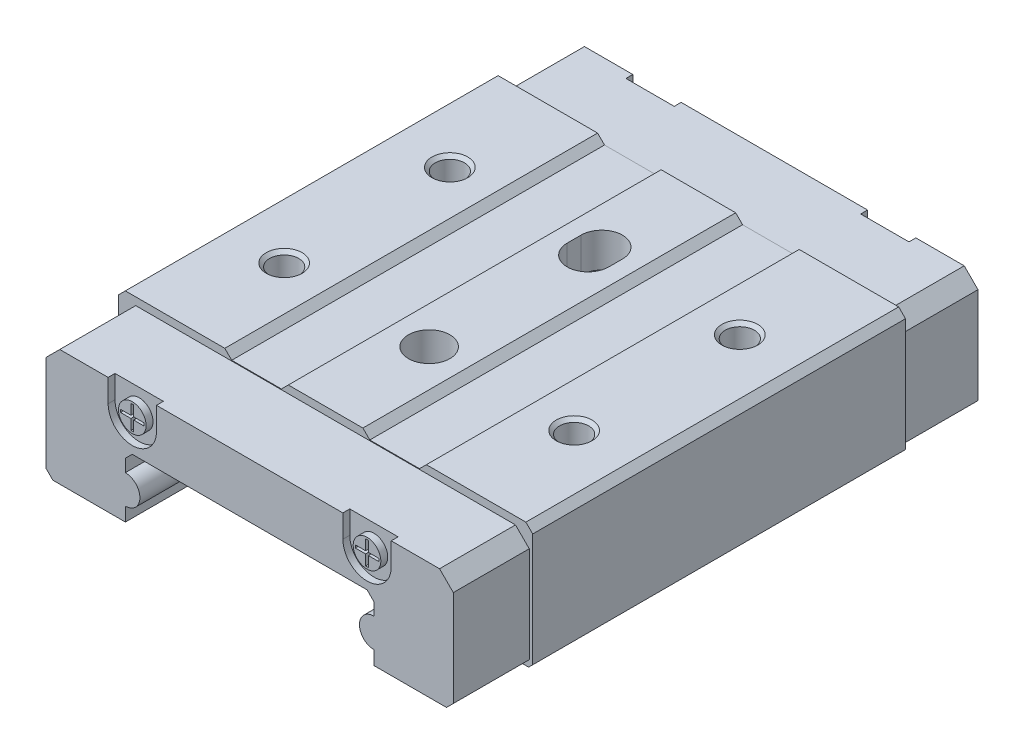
ISO-10303-21;
HEADER;
FILE_DESCRIPTION(('STEP AP214'),'2;1');
FILE_NAME('part.step','',(''),(''),'','','');
FILE_SCHEMA(('AUTOMOTIVE_DESIGN { 1 0 10303 214 1 1 1 1 }'));
ENDSEC;
DATA;
#1=APPLICATION_CONTEXT('core data for automotive mechanical design processes');
#2=APPLICATION_PROTOCOL_DEFINITION('international standard','automotive_design',2000,#1);
#3=PRODUCT_CONTEXT('',#1,'mechanical');
#4=PRODUCT('Part','Part','',(#3));
#5=PRODUCT_RELATED_PRODUCT_CATEGORY('part','',(#4));
#6=PRODUCT_DEFINITION_FORMATION('','',#4);
#7=PRODUCT_DEFINITION_CONTEXT('part definition',#1,'design');
#8=PRODUCT_DEFINITION('design','',#6,#7);
#9=PRODUCT_DEFINITION_SHAPE('','',#8);
#10=(LENGTH_UNIT() NAMED_UNIT(*) SI_UNIT(.MILLI.,.METRE.));
#11=(NAMED_UNIT(*) PLANE_ANGLE_UNIT() SI_UNIT($,.RADIAN.));
#12=(NAMED_UNIT(*) SI_UNIT($,.STERADIAN.) SOLID_ANGLE_UNIT());
#13=UNCERTAINTY_MEASURE_WITH_UNIT(LENGTH_MEASURE(1.E-05),#10,'distance_accuracy_value','');
#14=(GEOMETRIC_REPRESENTATION_CONTEXT(3) GLOBAL_UNCERTAINTY_ASSIGNED_CONTEXT((#13)) GLOBAL_UNIT_ASSIGNED_CONTEXT((#10,
#11,#12)) REPRESENTATION_CONTEXT('',''));
#15=CARTESIAN_POINT('',(0.,0.,0.));
#16=DIRECTION('',(0.,0.,1.));
#17=DIRECTION('',(1.,0.,0.));
#18=AXIS2_PLACEMENT_3D('',#15,#16,#17);
#19=CARTESIAN_POINT('',(-8.5,6.8,18.5));
#20=DIRECTION('',(0.,0.,1.));
#21=DIRECTION('',(1.,0.,0.));
#22=AXIS2_PLACEMENT_3D('',#19,#20,#21);
#23=PLANE('',#22);
#24=DIRECTION('',(1.,0.,0.));
#25=VECTOR('',#24,1.);
#26=CARTESIAN_POINT('',(-8.4,7.65,18.5));
#27=LINE('',#26,#25);
#28=CARTESIAN_POINT('',(-8.4,7.65,18.5));
#29=VERTEX_POINT('',#28);
#30=CARTESIAN_POINT('',(-8.6,7.65,18.5));
#31=VERTEX_POINT('',#30);
#32=EDGE_CURVE('E1036',#29,#31,#27,.F.);
#33=ORIENTED_EDGE('',*,*,#32,.T.);
#34=DIRECTION('',(0.,1.,0.));
#35=VECTOR('',#34,1.);
#36=CARTESIAN_POINT('',(-8.6,7.65,18.5));
#37=LINE('',#36,#35);
#38=CARTESIAN_POINT('',(-8.6,6.9,18.5));
#39=VERTEX_POINT('',#38);
#40=EDGE_CURVE('E1042',#31,#39,#37,.F.);
#41=ORIENTED_EDGE('',*,*,#40,.T.);
#42=DIRECTION('',(1.,0.,0.));
#43=VECTOR('',#42,1.);
#44=CARTESIAN_POINT('',(-8.6,6.9,18.5));
#45=LINE('',#44,#43);
#46=CARTESIAN_POINT('',(-9.35,6.9,18.5));
#47=VERTEX_POINT('',#46);
#48=EDGE_CURVE('E1048',#39,#47,#45,.F.);
#49=ORIENTED_EDGE('',*,*,#48,.T.);
#50=DIRECTION('',(0.,-1.,0.));
#51=VECTOR('',#50,1.);
#52=CARTESIAN_POINT('',(-9.35,6.9,18.5));
#53=LINE('',#52,#51);
#54=CARTESIAN_POINT('',(-9.35000000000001,6.7,18.5));
#55=VERTEX_POINT('',#54);
#56=EDGE_CURVE('E1051',#47,#55,#53,.T.);
#57=ORIENTED_EDGE('',*,*,#56,.T.);
#58=DIRECTION('',(1.,0.,0.));
#59=VECTOR('',#58,1.);
#60=CARTESIAN_POINT('',(-9.35000000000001,6.7,18.5));
#61=LINE('',#60,#59);
#62=CARTESIAN_POINT('',(-8.6,6.7,18.5));
#63=VERTEX_POINT('',#62);
#64=EDGE_CURVE('E985',#55,#63,#61,.T.);
#65=ORIENTED_EDGE('',*,*,#64,.T.);
#66=DIRECTION('',(0.,1.,0.));
#67=VECTOR('',#66,1.);
#68=CARTESIAN_POINT('',(-8.6,6.7,18.5));
#69=LINE('',#68,#67);
#70=CARTESIAN_POINT('',(-8.6,5.95,18.5));
#71=VERTEX_POINT('',#70);
#72=EDGE_CURVE('E994',#63,#71,#69,.F.);
#73=ORIENTED_EDGE('',*,*,#72,.T.);
#74=DIRECTION('',(1.,0.,0.));
#75=VECTOR('',#74,1.);
#76=CARTESIAN_POINT('',(-8.6,5.95,18.5));
#77=LINE('',#76,#75);
#78=CARTESIAN_POINT('',(-8.4,5.95,18.5));
#79=VERTEX_POINT('',#78);
#80=EDGE_CURVE('E1000',#71,#79,#77,.T.);
#81=ORIENTED_EDGE('',*,*,#80,.T.);
#82=DIRECTION('',(0.,1.,0.));
#83=VECTOR('',#82,1.);
#84=CARTESIAN_POINT('',(-8.4,5.95,18.5));
#85=LINE('',#84,#83);
#86=CARTESIAN_POINT('',(-8.4,6.7,18.5));
#87=VERTEX_POINT('',#86);
#88=EDGE_CURVE('E1006',#79,#87,#85,.T.);
#89=ORIENTED_EDGE('',*,*,#88,.T.);
#90=DIRECTION('',(1.,0.,0.));
#91=VECTOR('',#90,1.);
#92=CARTESIAN_POINT('',(-8.4,6.7,18.5));
#93=LINE('',#92,#91);
#94=CARTESIAN_POINT('',(-7.65,6.7,18.5));
#95=VERTEX_POINT('',#94);
#96=EDGE_CURVE('E1012',#87,#95,#93,.T.);
#97=ORIENTED_EDGE('',*,*,#96,.T.);
#98=DIRECTION('',(0.,1.,0.));
#99=VECTOR('',#98,1.);
#100=CARTESIAN_POINT('',(-7.65,6.7,18.5));
#101=LINE('',#100,#99);
#102=CARTESIAN_POINT('',(-7.65,6.9,18.5));
#103=VERTEX_POINT('',#102);
#104=EDGE_CURVE('E1018',#95,#103,#101,.T.);
#105=ORIENTED_EDGE('',*,*,#104,.T.);
#106=DIRECTION('',(1.,0.,0.));
#107=VECTOR('',#106,1.);
#108=CARTESIAN_POINT('',(-7.65,6.9,18.5));
#109=LINE('',#108,#107);
#110=CARTESIAN_POINT('',(-8.4,6.9,18.5));
#111=VERTEX_POINT('',#110);
#112=EDGE_CURVE('E1024',#103,#111,#109,.F.);
#113=ORIENTED_EDGE('',*,*,#112,.T.);
#114=DIRECTION('',(0.,1.,0.));
#115=VECTOR('',#114,1.);
#116=CARTESIAN_POINT('',(-8.4,6.9,18.5));
#117=LINE('',#116,#115);
#118=EDGE_CURVE('E1030',#111,#29,#117,.T.);
#119=ORIENTED_EDGE('',*,*,#118,.T.);
#120=EDGE_LOOP('',(#33,#41,#49,#57,#65,#73,#81,#89,#97,#105,#113,#119));
#121=FACE_BOUND('',#120,.T.);
#122=ADVANCED_FACE('F17',(#121),#23,.T.);
#123=CARTESIAN_POINT('',(-8.5,6.8,18.5));
#124=DIRECTION('',(0.,0.,1.));
#125=DIRECTION('',(1.,0.,0.));
#126=AXIS2_PLACEMENT_3D('',#123,#124,#125);
#127=PLANE('',#126);
#128=DIRECTION('',(0.,1.,0.));
#129=VECTOR('',#128,1.);
#130=CARTESIAN_POINT('',(8.6,6.9,18.5));
#131=LINE('',#130,#129);
#132=CARTESIAN_POINT('',(8.6,6.9,18.5));
#133=VERTEX_POINT('',#132);
#134=CARTESIAN_POINT('',(8.6,7.65,18.5));
#135=VERTEX_POINT('',#134);
#136=EDGE_CURVE('E965',#133,#135,#131,.T.);
#137=ORIENTED_EDGE('',*,*,#136,.T.);
#138=DIRECTION('',(1.,0.,0.));
#139=VECTOR('',#138,1.);
#140=CARTESIAN_POINT('',(8.6,7.65,18.5));
#141=LINE('',#140,#139);
#142=CARTESIAN_POINT('',(8.4,7.65,18.5));
#143=VERTEX_POINT('',#142);
#144=EDGE_CURVE('E971',#135,#143,#141,.F.);
#145=ORIENTED_EDGE('',*,*,#144,.T.);
#146=DIRECTION('',(0.,1.,0.));
#147=VECTOR('',#146,1.);
#148=CARTESIAN_POINT('',(8.4,7.65,18.5));
#149=LINE('',#148,#147);
#150=CARTESIAN_POINT('',(8.4,6.9,18.5));
#151=VERTEX_POINT('',#150);
#152=EDGE_CURVE('E977',#143,#151,#149,.F.);
#153=ORIENTED_EDGE('',*,*,#152,.T.);
#154=DIRECTION('',(1.,0.,0.));
#155=VECTOR('',#154,1.);
#156=CARTESIAN_POINT('',(8.4,6.9,18.5));
#157=LINE('',#156,#155);
#158=CARTESIAN_POINT('',(7.65,6.9,18.5));
#159=VERTEX_POINT('',#158);
#160=EDGE_CURVE('E980',#151,#159,#157,.F.);
#161=ORIENTED_EDGE('',*,*,#160,.T.);
#162=DIRECTION('',(0.,1.,0.));
#163=VECTOR('',#162,1.);
#164=CARTESIAN_POINT('',(7.65,6.9,18.5));
#165=LINE('',#164,#163);
#166=CARTESIAN_POINT('',(7.65,6.7,18.5));
#167=VERTEX_POINT('',#166);
#168=EDGE_CURVE('E914',#159,#167,#165,.F.);
#169=ORIENTED_EDGE('',*,*,#168,.T.);
#170=DIRECTION('',(1.,0.,0.));
#171=VECTOR('',#170,1.);
#172=CARTESIAN_POINT('',(7.65,6.7,18.5));
#173=LINE('',#172,#171);
#174=CARTESIAN_POINT('',(8.4,6.7,18.5));
#175=VERTEX_POINT('',#174);
#176=EDGE_CURVE('E923',#167,#175,#173,.T.);
#177=ORIENTED_EDGE('',*,*,#176,.T.);
#178=DIRECTION('',(0.,1.,0.));
#179=VECTOR('',#178,1.);
#180=CARTESIAN_POINT('',(8.4,6.7,18.5));
#181=LINE('',#180,#179);
#182=CARTESIAN_POINT('',(8.4,5.95,18.5));
#183=VERTEX_POINT('',#182);
#184=EDGE_CURVE('E929',#175,#183,#181,.F.);
#185=ORIENTED_EDGE('',*,*,#184,.T.);
#186=DIRECTION('',(1.,0.,0.));
#187=VECTOR('',#186,1.);
#188=CARTESIAN_POINT('',(8.4,5.95,18.5));
#189=LINE('',#188,#187);
#190=CARTESIAN_POINT('',(8.6,5.95,18.5));
#191=VERTEX_POINT('',#190);
#192=EDGE_CURVE('E935',#183,#191,#189,.T.);
#193=ORIENTED_EDGE('',*,*,#192,.T.);
#194=DIRECTION('',(0.,1.,0.));
#195=VECTOR('',#194,1.);
#196=CARTESIAN_POINT('',(8.6,5.95,18.5));
#197=LINE('',#196,#195);
#198=CARTESIAN_POINT('',(8.6,6.7,18.5));
#199=VERTEX_POINT('',#198);
#200=EDGE_CURVE('E941',#191,#199,#197,.T.);
#201=ORIENTED_EDGE('',*,*,#200,.T.);
#202=DIRECTION('',(1.,0.,0.));
#203=VECTOR('',#202,1.);
#204=CARTESIAN_POINT('',(8.6,6.7,18.5));
#205=LINE('',#204,#203);
#206=CARTESIAN_POINT('',(9.35,6.7,18.5));
#207=VERTEX_POINT('',#206);
#208=EDGE_CURVE('E947',#199,#207,#205,.T.);
#209=ORIENTED_EDGE('',*,*,#208,.T.);
#210=DIRECTION('',(0.,1.,0.));
#211=VECTOR('',#210,1.);
#212=CARTESIAN_POINT('',(9.35,6.7,18.5));
#213=LINE('',#212,#211);
#214=CARTESIAN_POINT('',(9.35,6.9,18.5));
#215=VERTEX_POINT('',#214);
#216=EDGE_CURVE('E953',#207,#215,#213,.T.);
#217=ORIENTED_EDGE('',*,*,#216,.T.);
#218=DIRECTION('',(1.,0.,0.));
#219=VECTOR('',#218,1.);
#220=CARTESIAN_POINT('',(9.35,6.9,18.5));
#221=LINE('',#220,#219);
#222=EDGE_CURVE('E959',#215,#133,#221,.F.);
#223=ORIENTED_EDGE('',*,*,#222,.T.);
#224=EDGE_LOOP('',(#137,#145,#153,#161,#169,#177,#185,#193,#201,#209,#217,#223));
#225=FACE_BOUND('',#224,.T.);
#226=ADVANCED_FACE('F2306',(#225),#127,.T.);
#227=CARTESIAN_POINT('',(10.5,5.10997055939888,6.));
#228=DIRECTION('',(0.,1.,0.));
#229=DIRECTION('',(0.,0.,1.));
#230=AXIS2_PLACEMENT_3D('',#227,#228,#229);
#231=CONICAL_SURFACE('',#230,1.05650000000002,1.04719755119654);
#232=CARTESIAN_POINT('',(10.5,4.49999999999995,6.00000000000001));
#233=VERTEX_POINT('',#232);
#234=VERTEX_LOOP('',#233);
#235=FACE_BOUND('',#234,.T.);
#236=CARTESIAN_POINT('',(10.5,5.10997055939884,6.));
#237=DIRECTION('',(0.,1.,0.));
#238=DIRECTION('',(0.,0.,1.));
#239=AXIS2_PLACEMENT_3D('',#236,#237,#238);
#240=CIRCLE('',#239,1.0565);
#241=CARTESIAN_POINT('',(10.5,5.10997055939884,7.0565));
#242=VERTEX_POINT('',#241);
#243=EDGE_CURVE('E913',#242,#242,#240,.T.);
#244=ORIENTED_EDGE('',*,*,#243,.T.);
#245=EDGE_LOOP('',(#244));
#246=FACE_BOUND('',#245,.T.);
#247=ADVANCED_FACE('F2303',(#235,#246),#231,.F.);
#248=CARTESIAN_POINT('',(10.5,5.10997055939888,-6.));
#249=DIRECTION('',(0.,1.,0.));
#250=DIRECTION('',(0.,0.,1.));
#251=AXIS2_PLACEMENT_3D('',#248,#249,#250);
#252=CONICAL_SURFACE('',#251,1.05650000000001,1.04719755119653);
#253=CARTESIAN_POINT('',(10.5,4.49999999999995,-6.00000000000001));
#254=VERTEX_POINT('',#253);
#255=VERTEX_LOOP('',#254);
#256=FACE_BOUND('',#255,.T.);
#257=CARTESIAN_POINT('',(10.5,5.10997055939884,-6.));
#258=DIRECTION('',(0.,1.,0.));
#259=DIRECTION('',(0.,0.,1.));
#260=AXIS2_PLACEMENT_3D('',#257,#258,#259);
#261=CIRCLE('',#260,1.0565);
#262=CARTESIAN_POINT('',(10.5,5.10997055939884,-4.9435));
#263=VERTEX_POINT('',#262);
#264=EDGE_CURVE('E905',#263,#263,#261,.T.);
#265=ORIENTED_EDGE('',*,*,#264,.T.);
#266=EDGE_LOOP('',(#265));
#267=FACE_BOUND('',#266,.T.);
#268=ADVANCED_FACE('F2299',(#256,#267),#252,.F.);
#269=CARTESIAN_POINT('',(-10.5,5.10997055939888,6.));
#270=DIRECTION('',(0.,1.,0.));
#271=DIRECTION('',(0.,0.,1.));
#272=AXIS2_PLACEMENT_3D('',#269,#270,#271);
#273=CONICAL_SURFACE('',#272,1.05650000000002,1.04719755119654);
#274=CARTESIAN_POINT('',(-10.5,4.49999999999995,6.00000000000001));
#275=VERTEX_POINT('',#274);
#276=VERTEX_LOOP('',#275);
#277=FACE_BOUND('',#276,.T.);
#278=CARTESIAN_POINT('',(-10.5,5.10997055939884,6.));
#279=DIRECTION('',(0.,1.,0.));
#280=DIRECTION('',(0.,0.,1.));
#281=AXIS2_PLACEMENT_3D('',#278,#279,#280);
#282=CIRCLE('',#281,1.0565);
#283=CARTESIAN_POINT('',(-10.5,5.10997055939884,7.0565));
#284=VERTEX_POINT('',#283);
#285=EDGE_CURVE('E900',#284,#284,#282,.T.);
#286=ORIENTED_EDGE('',*,*,#285,.T.);
#287=EDGE_LOOP('',(#286));
#288=FACE_BOUND('',#287,.T.);
#289=ADVANCED_FACE('F2295',(#277,#288),#273,.F.);
#290=CARTESIAN_POINT('',(-10.5,5.10997055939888,-6.));
#291=DIRECTION('',(0.,1.,0.));
#292=DIRECTION('',(0.,0.,1.));
#293=AXIS2_PLACEMENT_3D('',#290,#291,#292);
#294=CONICAL_SURFACE('',#293,1.05650000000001,1.04719755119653);
#295=CARTESIAN_POINT('',(-10.5,4.49999999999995,-6.00000000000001));
#296=VERTEX_POINT('',#295);
#297=VERTEX_LOOP('',#296);
#298=FACE_BOUND('',#297,.T.);
#299=CARTESIAN_POINT('',(-10.5,5.10997055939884,-6.));
#300=DIRECTION('',(0.,1.,0.));
#301=DIRECTION('',(0.,0.,1.));
#302=AXIS2_PLACEMENT_3D('',#299,#300,#301);
#303=CIRCLE('',#302,1.0565);
#304=CARTESIAN_POINT('',(-10.5,5.10997055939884,-4.9435));
#305=VERTEX_POINT('',#304);
#306=EDGE_CURVE('E889',#305,#305,#303,.T.);
#307=ORIENTED_EDGE('',*,*,#306,.T.);
#308=EDGE_LOOP('',(#307));
#309=FACE_BOUND('',#308,.T.);
#310=ADVANCED_FACE('F2291',(#298,#309),#294,.F.);
#311=CARTESIAN_POINT('',(-8.5,6.8,-18.5));
#312=DIRECTION('',(0.,0.,1.));
#313=DIRECTION('',(1.,0.,0.));
#314=AXIS2_PLACEMENT_3D('',#311,#312,#313);
#315=PLANE('',#314);
#316=DIRECTION('',(0.,1.,0.));
#317=VECTOR('',#316,1.);
#318=CARTESIAN_POINT('',(-9.35,6.9,-18.5));
#319=LINE('',#318,#317);
#320=CARTESIAN_POINT('',(-9.35,6.9,-18.5));
#321=VERTEX_POINT('',#320);
#322=CARTESIAN_POINT('',(-9.35000000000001,6.7,-18.5));
#323=VERTEX_POINT('',#322);
#324=EDGE_CURVE('E842',#321,#323,#319,.F.);
#325=ORIENTED_EDGE('',*,*,#324,.F.);
#326=DIRECTION('',(1.,0.,0.));
#327=VECTOR('',#326,1.);
#328=CARTESIAN_POINT('',(-8.6,6.9,-18.5));
#329=LINE('',#328,#327);
#330=CARTESIAN_POINT('',(-8.6,6.9,-18.5));
#331=VERTEX_POINT('',#330);
#332=EDGE_CURVE('E887',#331,#321,#329,.F.);
#333=ORIENTED_EDGE('',*,*,#332,.F.);
#334=DIRECTION('',(0.,1.,0.));
#335=VECTOR('',#334,1.);
#336=CARTESIAN_POINT('',(-8.6,7.65,-18.5));
#337=LINE('',#336,#335);
#338=CARTESIAN_POINT('',(-8.6,7.65,-18.5));
#339=VERTEX_POINT('',#338);
#340=EDGE_CURVE('E885',#339,#331,#337,.F.);
#341=ORIENTED_EDGE('',*,*,#340,.F.);
#342=DIRECTION('',(1.,0.,0.));
#343=VECTOR('',#342,1.);
#344=CARTESIAN_POINT('',(-8.4,7.65,-18.5));
#345=LINE('',#344,#343);
#346=CARTESIAN_POINT('',(-8.4,7.65,-18.5));
#347=VERTEX_POINT('',#346);
#348=EDGE_CURVE('E881',#347,#339,#345,.F.);
#349=ORIENTED_EDGE('',*,*,#348,.F.);
#350=DIRECTION('',(0.,1.,0.));
#351=VECTOR('',#350,1.);
#352=CARTESIAN_POINT('',(-8.4,6.9,-18.5));
#353=LINE('',#352,#351);
#354=CARTESIAN_POINT('',(-8.4,6.9,-18.5));
#355=VERTEX_POINT('',#354);
#356=EDGE_CURVE('E877',#355,#347,#353,.T.);
#357=ORIENTED_EDGE('',*,*,#356,.F.);
#358=DIRECTION('',(1.,0.,0.));
#359=VECTOR('',#358,1.);
#360=CARTESIAN_POINT('',(-7.65,6.9,-18.5));
#361=LINE('',#360,#359);
#362=CARTESIAN_POINT('',(-7.65,6.9,-18.5));
#363=VERTEX_POINT('',#362);
#364=EDGE_CURVE('E873',#363,#355,#361,.F.);
#365=ORIENTED_EDGE('',*,*,#364,.F.);
#366=DIRECTION('',(0.,1.,0.));
#367=VECTOR('',#366,1.);
#368=CARTESIAN_POINT('',(-7.65,6.7,-18.5));
#369=LINE('',#368,#367);
#370=CARTESIAN_POINT('',(-7.65,6.7,-18.5));
#371=VERTEX_POINT('',#370);
#372=EDGE_CURVE('E869',#371,#363,#369,.T.);
#373=ORIENTED_EDGE('',*,*,#372,.F.);
#374=DIRECTION('',(1.,0.,0.));
#375=VECTOR('',#374,1.);
#376=CARTESIAN_POINT('',(-8.4,6.7,-18.5));
#377=LINE('',#376,#375);
#378=CARTESIAN_POINT('',(-8.4,6.7,-18.5));
#379=VERTEX_POINT('',#378);
#380=EDGE_CURVE('E865',#379,#371,#377,.T.);
#381=ORIENTED_EDGE('',*,*,#380,.F.);
#382=DIRECTION('',(0.,1.,0.));
#383=VECTOR('',#382,1.);
#384=CARTESIAN_POINT('',(-8.4,5.95,-18.5));
#385=LINE('',#384,#383);
#386=CARTESIAN_POINT('',(-8.4,5.95,-18.5));
#387=VERTEX_POINT('',#386);
#388=EDGE_CURVE('E861',#387,#379,#385,.T.);
#389=ORIENTED_EDGE('',*,*,#388,.F.);
#390=DIRECTION('',(1.,0.,0.));
#391=VECTOR('',#390,1.);
#392=CARTESIAN_POINT('',(-8.6,5.95,-18.5));
#393=LINE('',#392,#391);
#394=CARTESIAN_POINT('',(-8.6,5.95,-18.5));
#395=VERTEX_POINT('',#394);
#396=EDGE_CURVE('E857',#395,#387,#393,.T.);
#397=ORIENTED_EDGE('',*,*,#396,.F.);
#398=DIRECTION('',(0.,1.,0.));
#399=VECTOR('',#398,1.);
#400=CARTESIAN_POINT('',(-8.6,6.7,-18.5));
#401=LINE('',#400,#399);
#402=CARTESIAN_POINT('',(-8.6,6.7,-18.5));
#403=VERTEX_POINT('',#402);
#404=EDGE_CURVE('E853',#403,#395,#401,.F.);
#405=ORIENTED_EDGE('',*,*,#404,.F.);
#406=DIRECTION('',(1.,0.,0.));
#407=VECTOR('',#406,1.);
#408=CARTESIAN_POINT('',(-9.35000000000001,6.7,-18.5));
#409=LINE('',#408,#407);
#410=EDGE_CURVE('E849',#323,#403,#409,.T.);
#411=ORIENTED_EDGE('',*,*,#410,.F.);
#412=EDGE_LOOP('',(#325,#333,#341,#349,#357,#365,#373,#381,#389,#397,#405,#411));
#413=FACE_BOUND('',#412,.T.);
#414=ADVANCED_FACE('F2287',(#413),#315,.F.);
#415=CARTESIAN_POINT('',(-8.5,6.8,-18.5));
#416=DIRECTION('',(0.,0.,1.));
#417=DIRECTION('',(1.,0.,0.));
#418=AXIS2_PLACEMENT_3D('',#415,#416,#417);
#419=PLANE('',#418);
#420=DIRECTION('',(1.,0.,0.));
#421=VECTOR('',#420,1.);
#422=CARTESIAN_POINT('',(8.4,6.9,-18.5));
#423=LINE('',#422,#421);
#424=CARTESIAN_POINT('',(8.4,6.9,-18.5));
#425=VERTEX_POINT('',#424);
#426=CARTESIAN_POINT('',(7.65,6.9,-18.5));
#427=VERTEX_POINT('',#426);
#428=EDGE_CURVE('E793',#425,#427,#423,.F.);
#429=ORIENTED_EDGE('',*,*,#428,.F.);
#430=DIRECTION('',(0.,1.,0.));
#431=VECTOR('',#430,1.);
#432=CARTESIAN_POINT('',(8.4,7.65,-18.5));
#433=LINE('',#432,#431);
#434=CARTESIAN_POINT('',(8.4,7.65,-18.5));
#435=VERTEX_POINT('',#434);
#436=EDGE_CURVE('E838',#435,#425,#433,.F.);
#437=ORIENTED_EDGE('',*,*,#436,.F.);
#438=DIRECTION('',(1.,0.,0.));
#439=VECTOR('',#438,1.);
#440=CARTESIAN_POINT('',(8.6,7.65,-18.5));
#441=LINE('',#440,#439);
#442=CARTESIAN_POINT('',(8.6,7.65,-18.5));
#443=VERTEX_POINT('',#442);
#444=EDGE_CURVE('E836',#443,#435,#441,.F.);
#445=ORIENTED_EDGE('',*,*,#444,.F.);
#446=DIRECTION('',(0.,1.,0.));
#447=VECTOR('',#446,1.);
#448=CARTESIAN_POINT('',(8.6,6.9,-18.5));
#449=LINE('',#448,#447);
#450=CARTESIAN_POINT('',(8.6,6.9,-18.5));
#451=VERTEX_POINT('',#450);
#452=EDGE_CURVE('E832',#451,#443,#449,.T.);
#453=ORIENTED_EDGE('',*,*,#452,.F.);
#454=DIRECTION('',(1.,0.,0.));
#455=VECTOR('',#454,1.);
#456=CARTESIAN_POINT('',(9.35,6.9,-18.5));
#457=LINE('',#456,#455);
#458=CARTESIAN_POINT('',(9.35,6.9,-18.5));
#459=VERTEX_POINT('',#458);
#460=EDGE_CURVE('E828',#459,#451,#457,.F.);
#461=ORIENTED_EDGE('',*,*,#460,.F.);
#462=DIRECTION('',(0.,1.,0.));
#463=VECTOR('',#462,1.);
#464=CARTESIAN_POINT('',(9.35,6.7,-18.5));
#465=LINE('',#464,#463);
#466=CARTESIAN_POINT('',(9.35,6.7,-18.5));
#467=VERTEX_POINT('',#466);
#468=EDGE_CURVE('E824',#467,#459,#465,.T.);
#469=ORIENTED_EDGE('',*,*,#468,.F.);
#470=DIRECTION('',(1.,0.,0.));
#471=VECTOR('',#470,1.);
#472=CARTESIAN_POINT('',(8.6,6.7,-18.5));
#473=LINE('',#472,#471);
#474=CARTESIAN_POINT('',(8.6,6.7,-18.5));
#475=VERTEX_POINT('',#474);
#476=EDGE_CURVE('E820',#475,#467,#473,.T.);
#477=ORIENTED_EDGE('',*,*,#476,.F.);
#478=DIRECTION('',(0.,1.,0.));
#479=VECTOR('',#478,1.);
#480=CARTESIAN_POINT('',(8.6,5.95,-18.5));
#481=LINE('',#480,#479);
#482=CARTESIAN_POINT('',(8.6,5.95,-18.5));
#483=VERTEX_POINT('',#482);
#484=EDGE_CURVE('E816',#483,#475,#481,.T.);
#485=ORIENTED_EDGE('',*,*,#484,.F.);
#486=DIRECTION('',(-1.,0.,0.));
#487=VECTOR('',#486,1.);
#488=CARTESIAN_POINT('',(8.4,5.95,-18.5));
#489=LINE('',#488,#487);
#490=CARTESIAN_POINT('',(8.4,5.95,-18.5));
#491=VERTEX_POINT('',#490);
#492=EDGE_CURVE('E812',#491,#483,#489,.F.);
#493=ORIENTED_EDGE('',*,*,#492,.F.);
#494=DIRECTION('',(0.,1.,0.));
#495=VECTOR('',#494,1.);
#496=CARTESIAN_POINT('',(8.4,6.7,-18.5));
#497=LINE('',#496,#495);
#498=CARTESIAN_POINT('',(8.4,6.7,-18.5));
#499=VERTEX_POINT('',#498);
#500=EDGE_CURVE('E808',#499,#491,#497,.F.);
#501=ORIENTED_EDGE('',*,*,#500,.F.);
#502=DIRECTION('',(1.,0.,0.));
#503=VECTOR('',#502,1.);
#504=CARTESIAN_POINT('',(7.65,6.7,-18.5));
#505=LINE('',#504,#503);
#506=CARTESIAN_POINT('',(7.65,6.7,-18.5));
#507=VERTEX_POINT('',#506);
#508=EDGE_CURVE('E804',#507,#499,#505,.T.);
#509=ORIENTED_EDGE('',*,*,#508,.F.);
#510=DIRECTION('',(0.,1.,0.));
#511=VECTOR('',#510,1.);
#512=CARTESIAN_POINT('',(7.65,6.9,-18.5));
#513=LINE('',#512,#511);
#514=EDGE_CURVE('E800',#427,#507,#513,.F.);
#515=ORIENTED_EDGE('',*,*,#514,.F.);
#516=EDGE_LOOP('',(#429,#437,#445,#453,#461,#469,#477,#485,#493,#501,#509,#515));
#517=FACE_BOUND('',#516,.T.);
#518=ADVANCED_FACE('F2283',(#517),#419,.F.);
#519=CARTESIAN_POINT('',(-9.35,6.9,18.5));
#520=DIRECTION('',(-1.,0.,0.));
#521=DIRECTION('',(0.,-1.,0.));
#522=AXIS2_PLACEMENT_3D('',#519,#520,#521);
#523=PLANE('',#522);
#524=DIRECTION('',(0.,0.,-1.));
#525=VECTOR('',#524,1.);
#526=CARTESIAN_POINT('',(-9.35000000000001,6.7,18.5));
#527=LINE('',#526,#525);
#528=CARTESIAN_POINT('',(-9.35000000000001,6.7,19.));
#529=VERTEX_POINT('',#528);
#530=EDGE_CURVE('E988',#529,#55,#527,.T.);
#531=ORIENTED_EDGE('',*,*,#530,.T.);
#532=ORIENTED_EDGE('',*,*,#56,.F.);
#533=DIRECTION('',(0.,0.,1.));
#534=VECTOR('',#533,1.);
#535=CARTESIAN_POINT('',(-9.35,6.9,18.5));
#536=LINE('',#535,#534);
#537=CARTESIAN_POINT('',(-9.35000000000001,6.9,19.));
#538=VERTEX_POINT('',#537);
#539=EDGE_CURVE('E1045',#47,#538,#536,.T.);
#540=ORIENTED_EDGE('',*,*,#539,.T.);
#541=DIRECTION('',(0.,1.,0.));
#542=VECTOR('',#541,1.);
#543=CARTESIAN_POINT('',(-9.35000000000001,6.8,19.));
#544=LINE('',#543,#542);
#545=EDGE_CURVE('E789',#529,#538,#544,.T.);
#546=ORIENTED_EDGE('',*,*,#545,.F.);
#547=EDGE_LOOP('',(#531,#532,#540,#546));
#548=FACE_BOUND('',#547,.T.);
#549=ADVANCED_FACE('F2279',(#548),#523,.F.);
#550=CARTESIAN_POINT('',(-8.6,6.9,18.5));
#551=DIRECTION('',(0.,1.,0.));
#552=DIRECTION('',(0.,0.,1.));
#553=AXIS2_PLACEMENT_3D('',#550,#551,#552);
#554=PLANE('',#553);
#555=ORIENTED_EDGE('',*,*,#539,.F.);
#556=ORIENTED_EDGE('',*,*,#48,.F.);
#557=DIRECTION('',(0.,0.,1.));
#558=VECTOR('',#557,1.);
#559=CARTESIAN_POINT('',(-8.6,6.9,18.5));
#560=LINE('',#559,#558);
#561=CARTESIAN_POINT('',(-8.6,6.9,19.));
#562=VERTEX_POINT('',#561);
#563=EDGE_CURVE('E1039',#39,#562,#560,.T.);
#564=ORIENTED_EDGE('',*,*,#563,.T.);
#565=DIRECTION('',(1.,0.,0.));
#566=VECTOR('',#565,1.);
#567=CARTESIAN_POINT('',(-8.5,6.9,19.));
#568=LINE('',#567,#566);
#569=EDGE_CURVE('E787',#538,#562,#568,.T.);
#570=ORIENTED_EDGE('',*,*,#569,.F.);
#571=EDGE_LOOP('',(#555,#556,#564,#570));
#572=FACE_BOUND('',#571,.T.);
#573=ADVANCED_FACE('F2275',(#572),#554,.F.);
#574=CARTESIAN_POINT('',(-8.6,7.65,18.5));
#575=DIRECTION('',(-1.,0.,0.));
#576=DIRECTION('',(0.,0.,1.));
#577=AXIS2_PLACEMENT_3D('',#574,#575,#576);
#578=PLANE('',#577);
#579=ORIENTED_EDGE('',*,*,#563,.F.);
#580=ORIENTED_EDGE('',*,*,#40,.F.);
#581=DIRECTION('',(0.,0.,1.));
#582=VECTOR('',#581,1.);
#583=CARTESIAN_POINT('',(-8.6,7.65,18.5));
#584=LINE('',#583,#582);
#585=CARTESIAN_POINT('',(-8.6,7.65,19.));
#586=VERTEX_POINT('',#585);
#587=EDGE_CURVE('E1033',#31,#586,#584,.T.);
#588=ORIENTED_EDGE('',*,*,#587,.T.);
#589=DIRECTION('',(0.,1.,0.));
#590=VECTOR('',#589,1.);
#591=CARTESIAN_POINT('',(-8.6,6.8,19.));
#592=LINE('',#591,#590);
#593=EDGE_CURVE('E785',#562,#586,#592,.T.);
#594=ORIENTED_EDGE('',*,*,#593,.F.);
#595=EDGE_LOOP('',(#579,#580,#588,#594));
#596=FACE_BOUND('',#595,.T.);
#597=ADVANCED_FACE('F2271',(#596),#578,.F.);
#598=CARTESIAN_POINT('',(-8.4,7.65,18.5));
#599=DIRECTION('',(0.,1.,0.));
#600=DIRECTION('',(0.,0.,1.));
#601=AXIS2_PLACEMENT_3D('',#598,#599,#600);
#602=PLANE('',#601);
#603=ORIENTED_EDGE('',*,*,#587,.F.);
#604=ORIENTED_EDGE('',*,*,#32,.F.);
#605=DIRECTION('',(0.,0.,-1.));
#606=VECTOR('',#605,1.);
#607=CARTESIAN_POINT('',(-8.4,7.65,18.5));
#608=LINE('',#607,#606);
#609=CARTESIAN_POINT('',(-8.4,7.65,19.));
#610=VERTEX_POINT('',#609);
#611=EDGE_CURVE('E1027',#29,#610,#608,.F.);
#612=ORIENTED_EDGE('',*,*,#611,.T.);
#613=DIRECTION('',(1.,0.,0.));
#614=VECTOR('',#613,1.);
#615=CARTESIAN_POINT('',(-8.5,7.65,19.));
#616=LINE('',#615,#614);
#617=EDGE_CURVE('E783',#586,#610,#616,.T.);
#618=ORIENTED_EDGE('',*,*,#617,.F.);
#619=EDGE_LOOP('',(#603,#604,#612,#618));
#620=FACE_BOUND('',#619,.T.);
#621=ADVANCED_FACE('F2267',(#620),#602,.F.);
#622=CARTESIAN_POINT('',(-8.4,6.9,18.5));
#623=DIRECTION('',(1.,0.,0.));
#624=DIRECTION('',(0.,0.,-1.));
#625=AXIS2_PLACEMENT_3D('',#622,#623,#624);
#626=PLANE('',#625);
#627=ORIENTED_EDGE('',*,*,#611,.F.);
#628=ORIENTED_EDGE('',*,*,#118,.F.);
#629=DIRECTION('',(0.,0.,1.));
#630=VECTOR('',#629,1.);
#631=CARTESIAN_POINT('',(-8.4,6.9,18.5));
#632=LINE('',#631,#630);
#633=CARTESIAN_POINT('',(-8.4,6.9,19.));
#634=VERTEX_POINT('',#633);
#635=EDGE_CURVE('E1021',#111,#634,#632,.T.);
#636=ORIENTED_EDGE('',*,*,#635,.T.);
#637=DIRECTION('',(0.,1.,0.));
#638=VECTOR('',#637,1.);
#639=CARTESIAN_POINT('',(-8.4,6.8,19.));
#640=LINE('',#639,#638);
#641=EDGE_CURVE('E781',#610,#634,#640,.F.);
#642=ORIENTED_EDGE('',*,*,#641,.F.);
#643=EDGE_LOOP('',(#627,#628,#636,#642));
#644=FACE_BOUND('',#643,.T.);
#645=ADVANCED_FACE('F2263',(#644),#626,.F.);
#646=CARTESIAN_POINT('',(-7.65,6.9,18.5));
#647=DIRECTION('',(0.,1.,0.));
#648=DIRECTION('',(0.,0.,1.));
#649=AXIS2_PLACEMENT_3D('',#646,#647,#648);
#650=PLANE('',#649);
#651=ORIENTED_EDGE('',*,*,#635,.F.);
#652=ORIENTED_EDGE('',*,*,#112,.F.);
#653=DIRECTION('',(0.,0.,-1.));
#654=VECTOR('',#653,1.);
#655=CARTESIAN_POINT('',(-7.65,6.9,18.5));
#656=LINE('',#655,#654);
#657=CARTESIAN_POINT('',(-7.65,6.9,19.));
#658=VERTEX_POINT('',#657);
#659=EDGE_CURVE('E1015',#103,#658,#656,.F.);
#660=ORIENTED_EDGE('',*,*,#659,.T.);
#661=DIRECTION('',(1.,0.,0.));
#662=VECTOR('',#661,1.);
#663=CARTESIAN_POINT('',(-8.5,6.9,19.));
#664=LINE('',#663,#662);
#665=EDGE_CURVE('E779',#634,#658,#664,.T.);
#666=ORIENTED_EDGE('',*,*,#665,.F.);
#667=EDGE_LOOP('',(#651,#652,#660,#666));
#668=FACE_BOUND('',#667,.T.);
#669=ADVANCED_FACE('F2259',(#668),#650,.F.);
#670=CARTESIAN_POINT('',(-7.65,6.7,18.5));
#671=DIRECTION('',(1.,0.,0.));
#672=DIRECTION('',(0.,0.,-1.));
#673=AXIS2_PLACEMENT_3D('',#670,#671,#672);
#674=PLANE('',#673);
#675=ORIENTED_EDGE('',*,*,#659,.F.);
#676=ORIENTED_EDGE('',*,*,#104,.F.);
#677=DIRECTION('',(0.,0.,-1.));
#678=VECTOR('',#677,1.);
#679=CARTESIAN_POINT('',(-7.65,6.7,18.5));
#680=LINE('',#679,#678);
#681=CARTESIAN_POINT('',(-7.65,6.7,19.));
#682=VERTEX_POINT('',#681);
#683=EDGE_CURVE('E1009',#95,#682,#680,.F.);
#684=ORIENTED_EDGE('',*,*,#683,.T.);
#685=DIRECTION('',(0.,1.,0.));
#686=VECTOR('',#685,1.);
#687=CARTESIAN_POINT('',(-7.65,6.8,19.));
#688=LINE('',#687,#686);
#689=EDGE_CURVE('E777',#658,#682,#688,.F.);
#690=ORIENTED_EDGE('',*,*,#689,.F.);
#691=EDGE_LOOP('',(#675,#676,#684,#690));
#692=FACE_BOUND('',#691,.T.);
#693=ADVANCED_FACE('F2255',(#692),#674,.F.);
#694=CARTESIAN_POINT('',(-8.4,6.7,18.5));
#695=DIRECTION('',(0.,-1.,0.));
#696=DIRECTION('',(0.,0.,-1.));
#697=AXIS2_PLACEMENT_3D('',#694,#695,#696);
#698=PLANE('',#697);
#699=ORIENTED_EDGE('',*,*,#683,.F.);
#700=ORIENTED_EDGE('',*,*,#96,.F.);
#701=DIRECTION('',(0.,0.,-1.));
#702=VECTOR('',#701,1.);
#703=CARTESIAN_POINT('',(-8.4,6.7,18.5));
#704=LINE('',#703,#702);
#705=CARTESIAN_POINT('',(-8.4,6.7,19.));
#706=VERTEX_POINT('',#705);
#707=EDGE_CURVE('E1003',#87,#706,#704,.F.);
#708=ORIENTED_EDGE('',*,*,#707,.T.);
#709=DIRECTION('',(1.,0.,0.));
#710=VECTOR('',#709,1.);
#711=CARTESIAN_POINT('',(-8.5,6.7,19.));
#712=LINE('',#711,#710);
#713=EDGE_CURVE('E775',#682,#706,#712,.F.);
#714=ORIENTED_EDGE('',*,*,#713,.F.);
#715=EDGE_LOOP('',(#699,#700,#708,#714));
#716=FACE_BOUND('',#715,.T.);
#717=ADVANCED_FACE('F2251',(#716),#698,.F.);
#718=CARTESIAN_POINT('',(-8.4,5.95,18.5));
#719=DIRECTION('',(1.,0.,0.));
#720=DIRECTION('',(0.,0.,-1.));
#721=AXIS2_PLACEMENT_3D('',#718,#719,#720);
#722=PLANE('',#721);
#723=ORIENTED_EDGE('',*,*,#707,.F.);
#724=ORIENTED_EDGE('',*,*,#88,.F.);
#725=DIRECTION('',(0.,0.,-1.));
#726=VECTOR('',#725,1.);
#727=CARTESIAN_POINT('',(-8.4,5.95,18.5));
#728=LINE('',#727,#726);
#729=CARTESIAN_POINT('',(-8.4,5.95,19.));
#730=VERTEX_POINT('',#729);
#731=EDGE_CURVE('E997',#79,#730,#728,.F.);
#732=ORIENTED_EDGE('',*,*,#731,.T.);
#733=DIRECTION('',(0.,1.,0.));
#734=VECTOR('',#733,1.);
#735=CARTESIAN_POINT('',(-8.4,6.8,19.));
#736=LINE('',#735,#734);
#737=EDGE_CURVE('E773',#706,#730,#736,.F.);
#738=ORIENTED_EDGE('',*,*,#737,.F.);
#739=EDGE_LOOP('',(#723,#724,#732,#738));
#740=FACE_BOUND('',#739,.T.);
#741=ADVANCED_FACE('F2247',(#740),#722,.F.);
#742=CARTESIAN_POINT('',(-8.6,5.95,18.5));
#743=DIRECTION('',(0.,-1.,0.));
#744=DIRECTION('',(0.,0.,-1.));
#745=AXIS2_PLACEMENT_3D('',#742,#743,#744);
#746=PLANE('',#745);
#747=ORIENTED_EDGE('',*,*,#731,.F.);
#748=ORIENTED_EDGE('',*,*,#80,.F.);
#749=DIRECTION('',(0.,0.,1.));
#750=VECTOR('',#749,1.);
#751=CARTESIAN_POINT('',(-8.6,5.95,18.5));
#752=LINE('',#751,#750);
#753=CARTESIAN_POINT('',(-8.6,5.95,19.));
#754=VERTEX_POINT('',#753);
#755=EDGE_CURVE('E991',#71,#754,#752,.T.);
#756=ORIENTED_EDGE('',*,*,#755,.T.);
#757=DIRECTION('',(1.,0.,0.));
#758=VECTOR('',#757,1.);
#759=CARTESIAN_POINT('',(-8.5,5.95,19.));
#760=LINE('',#759,#758);
#761=EDGE_CURVE('E771',#730,#754,#760,.F.);
#762=ORIENTED_EDGE('',*,*,#761,.F.);
#763=EDGE_LOOP('',(#747,#748,#756,#762));
#764=FACE_BOUND('',#763,.T.);
#765=ADVANCED_FACE('F2243',(#764),#746,.F.);
#766=CARTESIAN_POINT('',(-8.6,6.7,18.5));
#767=DIRECTION('',(-1.,0.,0.));
#768=DIRECTION('',(0.,0.,1.));
#769=AXIS2_PLACEMENT_3D('',#766,#767,#768);
#770=PLANE('',#769);
#771=ORIENTED_EDGE('',*,*,#755,.F.);
#772=ORIENTED_EDGE('',*,*,#72,.F.);
#773=DIRECTION('',(0.,0.,-1.));
#774=VECTOR('',#773,1.);
#775=CARTESIAN_POINT('',(-8.6,6.7,18.5));
#776=LINE('',#775,#774);
#777=CARTESIAN_POINT('',(-8.6,6.7,19.));
#778=VERTEX_POINT('',#777);
#779=EDGE_CURVE('E982',#63,#778,#776,.F.);
#780=ORIENTED_EDGE('',*,*,#779,.T.);
#781=DIRECTION('',(0.,1.,0.));
#782=VECTOR('',#781,1.);
#783=CARTESIAN_POINT('',(-8.6,6.8,19.));
#784=LINE('',#783,#782);
#785=EDGE_CURVE('E769',#754,#778,#784,.T.);
#786=ORIENTED_EDGE('',*,*,#785,.F.);
#787=EDGE_LOOP('',(#771,#772,#780,#786));
#788=FACE_BOUND('',#787,.T.);
#789=ADVANCED_FACE('F2239',(#788),#770,.F.);
#790=CARTESIAN_POINT('',(-9.35000000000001,6.7,18.5));
#791=DIRECTION('',(0.,-1.,0.));
#792=DIRECTION('',(0.,0.,-1.));
#793=AXIS2_PLACEMENT_3D('',#790,#791,#792);
#794=PLANE('',#793);
#795=ORIENTED_EDGE('',*,*,#779,.F.);
#796=ORIENTED_EDGE('',*,*,#64,.F.);
#797=ORIENTED_EDGE('',*,*,#530,.F.);
#798=DIRECTION('',(1.,0.,0.));
#799=VECTOR('',#798,1.);
#800=CARTESIAN_POINT('',(-8.5,6.7,19.));
#801=LINE('',#800,#799);
#802=EDGE_CURVE('E766',#778,#529,#801,.F.);
#803=ORIENTED_EDGE('',*,*,#802,.F.);
#804=EDGE_LOOP('',(#795,#796,#797,#803));
#805=FACE_BOUND('',#804,.T.);
#806=ADVANCED_FACE('F2235',(#805),#794,.F.);
#807=CARTESIAN_POINT('',(8.4,6.9,18.5));
#808=DIRECTION('',(0.,1.,0.));
#809=DIRECTION('',(0.,0.,1.));
#810=AXIS2_PLACEMENT_3D('',#807,#808,#809);
#811=PLANE('',#810);
#812=DIRECTION('',(0.,0.,1.));
#813=VECTOR('',#812,1.);
#814=CARTESIAN_POINT('',(7.65,6.9,18.5));
#815=LINE('',#814,#813);
#816=CARTESIAN_POINT('',(7.65,6.9,19.));
#817=VERTEX_POINT('',#816);
#818=EDGE_CURVE('E917',#817,#159,#815,.F.);
#819=ORIENTED_EDGE('',*,*,#818,.T.);
#820=ORIENTED_EDGE('',*,*,#160,.F.);
#821=DIRECTION('',(0.,0.,1.));
#822=VECTOR('',#821,1.);
#823=CARTESIAN_POINT('',(8.4,6.9,18.5));
#824=LINE('',#823,#822);
#825=CARTESIAN_POINT('',(8.4,6.9,19.));
#826=VERTEX_POINT('',#825);
#827=EDGE_CURVE('E974',#151,#826,#824,.T.);
#828=ORIENTED_EDGE('',*,*,#827,.T.);
#829=DIRECTION('',(1.,0.,0.));
#830=VECTOR('',#829,1.);
#831=CARTESIAN_POINT('',(8.5,6.9,19.));
#832=LINE('',#831,#830);
#833=EDGE_CURVE('E764',#817,#826,#832,.T.);
#834=ORIENTED_EDGE('',*,*,#833,.F.);
#835=EDGE_LOOP('',(#819,#820,#828,#834));
#836=FACE_BOUND('',#835,.T.);
#837=ADVANCED_FACE('F2231',(#836),#811,.F.);
#838=CARTESIAN_POINT('',(8.4,7.65,18.5));
#839=DIRECTION('',(-1.,0.,0.));
#840=DIRECTION('',(0.,0.,1.));
#841=AXIS2_PLACEMENT_3D('',#838,#839,#840);
#842=PLANE('',#841);
#843=ORIENTED_EDGE('',*,*,#827,.F.);
#844=ORIENTED_EDGE('',*,*,#152,.F.);
#845=DIRECTION('',(0.,0.,1.));
#846=VECTOR('',#845,1.);
#847=CARTESIAN_POINT('',(8.4,7.65,18.5));
#848=LINE('',#847,#846);
#849=CARTESIAN_POINT('',(8.4,7.65,19.));
#850=VERTEX_POINT('',#849);
#851=EDGE_CURVE('E968',#143,#850,#848,.T.);
#852=ORIENTED_EDGE('',*,*,#851,.T.);
#853=DIRECTION('',(0.,1.,0.));
#854=VECTOR('',#853,1.);
#855=CARTESIAN_POINT('',(8.4,6.8,19.));
#856=LINE('',#855,#854);
#857=EDGE_CURVE('E762',#826,#850,#856,.T.);
#858=ORIENTED_EDGE('',*,*,#857,.F.);
#859=EDGE_LOOP('',(#843,#844,#852,#858));
#860=FACE_BOUND('',#859,.T.);
#861=ADVANCED_FACE('F2227',(#860),#842,.F.);
#862=CARTESIAN_POINT('',(8.6,7.65,18.5));
#863=DIRECTION('',(0.,1.,0.));
#864=DIRECTION('',(0.,0.,1.));
#865=AXIS2_PLACEMENT_3D('',#862,#863,#864);
#866=PLANE('',#865);
#867=ORIENTED_EDGE('',*,*,#851,.F.);
#868=ORIENTED_EDGE('',*,*,#144,.F.);
#869=DIRECTION('',(0.,0.,-1.));
#870=VECTOR('',#869,1.);
#871=CARTESIAN_POINT('',(8.6,7.65,18.5));
#872=LINE('',#871,#870);
#873=CARTESIAN_POINT('',(8.6,7.65,19.));
#874=VERTEX_POINT('',#873);
#875=EDGE_CURVE('E962',#135,#874,#872,.F.);
#876=ORIENTED_EDGE('',*,*,#875,.T.);
#877=DIRECTION('',(1.,0.,0.));
#878=VECTOR('',#877,1.);
#879=CARTESIAN_POINT('',(8.5,7.65,19.));
#880=LINE('',#879,#878);
#881=EDGE_CURVE('E760',#850,#874,#880,.T.);
#882=ORIENTED_EDGE('',*,*,#881,.F.);
#883=EDGE_LOOP('',(#867,#868,#876,#882));
#884=FACE_BOUND('',#883,.T.);
#885=ADVANCED_FACE('F2223',(#884),#866,.F.);
#886=CARTESIAN_POINT('',(8.6,6.9,18.5));
#887=DIRECTION('',(1.,0.,0.));
#888=DIRECTION('',(0.,0.,-1.));
#889=AXIS2_PLACEMENT_3D('',#886,#887,#888);
#890=PLANE('',#889);
#891=ORIENTED_EDGE('',*,*,#875,.F.);
#892=ORIENTED_EDGE('',*,*,#136,.F.);
#893=DIRECTION('',(0.,0.,1.));
#894=VECTOR('',#893,1.);
#895=CARTESIAN_POINT('',(8.6,6.9,18.5));
#896=LINE('',#895,#894);
#897=CARTESIAN_POINT('',(8.6,6.9,19.));
#898=VERTEX_POINT('',#897);
#899=EDGE_CURVE('E956',#133,#898,#896,.T.);
#900=ORIENTED_EDGE('',*,*,#899,.T.);
#901=DIRECTION('',(0.,1.,0.));
#902=VECTOR('',#901,1.);
#903=CARTESIAN_POINT('',(8.6,6.8,19.));
#904=LINE('',#903,#902);
#905=EDGE_CURVE('E758',#874,#898,#904,.F.);
#906=ORIENTED_EDGE('',*,*,#905,.F.);
#907=EDGE_LOOP('',(#891,#892,#900,#906));
#908=FACE_BOUND('',#907,.T.);
#909=ADVANCED_FACE('F2219',(#908),#890,.F.);
#910=CARTESIAN_POINT('',(9.35,6.9,18.5));
#911=DIRECTION('',(0.,1.,0.));
#912=DIRECTION('',(0.,0.,1.));
#913=AXIS2_PLACEMENT_3D('',#910,#911,#912);
#914=PLANE('',#913);
#915=ORIENTED_EDGE('',*,*,#899,.F.);
#916=ORIENTED_EDGE('',*,*,#222,.F.);
#917=DIRECTION('',(0.,0.,-1.));
#918=VECTOR('',#917,1.);
#919=CARTESIAN_POINT('',(9.35,6.9,18.5));
#920=LINE('',#919,#918);
#921=CARTESIAN_POINT('',(9.35,6.9,19.));
#922=VERTEX_POINT('',#921);
#923=EDGE_CURVE('E950',#215,#922,#920,.F.);
#924=ORIENTED_EDGE('',*,*,#923,.T.);
#925=DIRECTION('',(1.,0.,0.));
#926=VECTOR('',#925,1.);
#927=CARTESIAN_POINT('',(8.5,6.9,19.));
#928=LINE('',#927,#926);
#929=EDGE_CURVE('E756',#898,#922,#928,.T.);
#930=ORIENTED_EDGE('',*,*,#929,.F.);
#931=EDGE_LOOP('',(#915,#916,#924,#930));
#932=FACE_BOUND('',#931,.T.);
#933=ADVANCED_FACE('F2215',(#932),#914,.F.);
#934=CARTESIAN_POINT('',(9.35,6.7,18.5));
#935=DIRECTION('',(1.,0.,0.));
#936=DIRECTION('',(0.,0.,-1.));
#937=AXIS2_PLACEMENT_3D('',#934,#935,#936);
#938=PLANE('',#937);
#939=ORIENTED_EDGE('',*,*,#923,.F.);
#940=ORIENTED_EDGE('',*,*,#216,.F.);
#941=DIRECTION('',(0.,0.,-1.));
#942=VECTOR('',#941,1.);
#943=CARTESIAN_POINT('',(9.35,6.7,18.5));
#944=LINE('',#943,#942);
#945=CARTESIAN_POINT('',(9.35,6.7,19.));
#946=VERTEX_POINT('',#945);
#947=EDGE_CURVE('E944',#207,#946,#944,.F.);
#948=ORIENTED_EDGE('',*,*,#947,.T.);
#949=DIRECTION('',(0.,1.,0.));
#950=VECTOR('',#949,1.);
#951=CARTESIAN_POINT('',(9.35,6.8,19.));
#952=LINE('',#951,#950);
#953=EDGE_CURVE('E754',#922,#946,#952,.F.);
#954=ORIENTED_EDGE('',*,*,#953,.F.);
#955=EDGE_LOOP('',(#939,#940,#948,#954));
#956=FACE_BOUND('',#955,.T.);
#957=ADVANCED_FACE('F2211',(#956),#938,.F.);
#958=CARTESIAN_POINT('',(8.6,6.7,18.5));
#959=DIRECTION('',(0.,-1.,0.));
#960=DIRECTION('',(0.,0.,-1.));
#961=AXIS2_PLACEMENT_3D('',#958,#959,#960);
#962=PLANE('',#961);
#963=ORIENTED_EDGE('',*,*,#947,.F.);
#964=ORIENTED_EDGE('',*,*,#208,.F.);
#965=DIRECTION('',(0.,0.,-1.));
#966=VECTOR('',#965,1.);
#967=CARTESIAN_POINT('',(8.6,6.7,18.5));
#968=LINE('',#967,#966);
#969=CARTESIAN_POINT('',(8.6,6.7,19.));
#970=VERTEX_POINT('',#969);
#971=EDGE_CURVE('E938',#199,#970,#968,.F.);
#972=ORIENTED_EDGE('',*,*,#971,.T.);
#973=DIRECTION('',(1.,0.,0.));
#974=VECTOR('',#973,1.);
#975=CARTESIAN_POINT('',(8.5,6.7,19.));
#976=LINE('',#975,#974);
#977=EDGE_CURVE('E752',#946,#970,#976,.F.);
#978=ORIENTED_EDGE('',*,*,#977,.F.);
#979=EDGE_LOOP('',(#963,#964,#972,#978));
#980=FACE_BOUND('',#979,.T.);
#981=ADVANCED_FACE('F2207',(#980),#962,.F.);
#982=CARTESIAN_POINT('',(8.6,5.95,18.5));
#983=DIRECTION('',(1.,0.,0.));
#984=DIRECTION('',(0.,0.,-1.));
#985=AXIS2_PLACEMENT_3D('',#982,#983,#984);
#986=PLANE('',#985);
#987=ORIENTED_EDGE('',*,*,#971,.F.);
#988=ORIENTED_EDGE('',*,*,#200,.F.);
#989=DIRECTION('',(0.,0.,1.));
#990=VECTOR('',#989,1.);
#991=CARTESIAN_POINT('',(8.6,5.95,18.5));
#992=LINE('',#991,#990);
#993=CARTESIAN_POINT('',(8.6,5.95,19.));
#994=VERTEX_POINT('',#993);
#995=EDGE_CURVE('E932',#191,#994,#992,.T.);
#996=ORIENTED_EDGE('',*,*,#995,.T.);
#997=DIRECTION('',(0.,1.,0.));
#998=VECTOR('',#997,1.);
#999=CARTESIAN_POINT('',(8.6,6.8,19.));
#1000=LINE('',#999,#998);
#1001=EDGE_CURVE('E750',#970,#994,#1000,.F.);
#1002=ORIENTED_EDGE('',*,*,#1001,.F.);
#1003=EDGE_LOOP('',(#987,#988,#996,#1002));
#1004=FACE_BOUND('',#1003,.T.);
#1005=ADVANCED_FACE('F2203',(#1004),#986,.F.);
#1006=CARTESIAN_POINT('',(8.4,5.95,18.5));
#1007=DIRECTION('',(0.,-1.,0.));
#1008=DIRECTION('',(1.,0.,0.));
#1009=AXIS2_PLACEMENT_3D('',#1006,#1007,#1008);
#1010=PLANE('',#1009);
#1011=ORIENTED_EDGE('',*,*,#995,.F.);
#1012=ORIENTED_EDGE('',*,*,#192,.F.);
#1013=DIRECTION('',(0.,0.,1.));
#1014=VECTOR('',#1013,1.);
#1015=CARTESIAN_POINT('',(8.4,5.95,18.5));
#1016=LINE('',#1015,#1014);
#1017=CARTESIAN_POINT('',(8.4,5.95,19.));
#1018=VERTEX_POINT('',#1017);
#1019=EDGE_CURVE('E926',#183,#1018,#1016,.T.);
#1020=ORIENTED_EDGE('',*,*,#1019,.T.);
#1021=DIRECTION('',(1.,0.,0.));
#1022=VECTOR('',#1021,1.);
#1023=CARTESIAN_POINT('',(8.5,5.95,19.));
#1024=LINE('',#1023,#1022);
#1025=EDGE_CURVE('E748',#994,#1018,#1024,.F.);
#1026=ORIENTED_EDGE('',*,*,#1025,.F.);
#1027=EDGE_LOOP('',(#1011,#1012,#1020,#1026));
#1028=FACE_BOUND('',#1027,.T.);
#1029=ADVANCED_FACE('F2199',(#1028),#1010,.F.);
#1030=CARTESIAN_POINT('',(8.4,6.7,18.5));
#1031=DIRECTION('',(-1.,0.,0.));
#1032=DIRECTION('',(0.,0.,1.));
#1033=AXIS2_PLACEMENT_3D('',#1030,#1031,#1032);
#1034=PLANE('',#1033);
#1035=ORIENTED_EDGE('',*,*,#1019,.F.);
#1036=ORIENTED_EDGE('',*,*,#184,.F.);
#1037=DIRECTION('',(0.,0.,-1.));
#1038=VECTOR('',#1037,1.);
#1039=CARTESIAN_POINT('',(8.4,6.7,18.5));
#1040=LINE('',#1039,#1038);
#1041=CARTESIAN_POINT('',(8.4,6.7,19.));
#1042=VERTEX_POINT('',#1041);
#1043=EDGE_CURVE('E920',#175,#1042,#1040,.F.);
#1044=ORIENTED_EDGE('',*,*,#1043,.T.);
#1045=DIRECTION('',(0.,1.,0.));
#1046=VECTOR('',#1045,1.);
#1047=CARTESIAN_POINT('',(8.4,6.8,19.));
#1048=LINE('',#1047,#1046);
#1049=EDGE_CURVE('E746',#1018,#1042,#1048,.T.);
#1050=ORIENTED_EDGE('',*,*,#1049,.F.);
#1051=EDGE_LOOP('',(#1035,#1036,#1044,#1050));
#1052=FACE_BOUND('',#1051,.T.);
#1053=ADVANCED_FACE('F2195',(#1052),#1034,.F.);
#1054=CARTESIAN_POINT('',(7.65,6.7,18.5));
#1055=DIRECTION('',(0.,-1.,0.));
#1056=DIRECTION('',(0.,0.,-1.));
#1057=AXIS2_PLACEMENT_3D('',#1054,#1055,#1056);
#1058=PLANE('',#1057);
#1059=ORIENTED_EDGE('',*,*,#1043,.F.);
#1060=ORIENTED_EDGE('',*,*,#176,.F.);
#1061=DIRECTION('',(0.,0.,1.));
#1062=VECTOR('',#1061,1.);
#1063=CARTESIAN_POINT('',(7.65,6.7,18.5));
#1064=LINE('',#1063,#1062);
#1065=CARTESIAN_POINT('',(7.65,6.7,19.));
#1066=VERTEX_POINT('',#1065);
#1067=EDGE_CURVE('E910',#167,#1066,#1064,.T.);
#1068=ORIENTED_EDGE('',*,*,#1067,.T.);
#1069=DIRECTION('',(1.,0.,0.));
#1070=VECTOR('',#1069,1.);
#1071=CARTESIAN_POINT('',(8.5,6.7,19.));
#1072=LINE('',#1071,#1070);
#1073=EDGE_CURVE('E744',#1042,#1066,#1072,.F.);
#1074=ORIENTED_EDGE('',*,*,#1073,.F.);
#1075=EDGE_LOOP('',(#1059,#1060,#1068,#1074));
#1076=FACE_BOUND('',#1075,.T.);
#1077=ADVANCED_FACE('F2191',(#1076),#1058,.F.);
#1078=CARTESIAN_POINT('',(7.65,6.9,18.5));
#1079=DIRECTION('',(-1.,0.,0.));
#1080=DIRECTION('',(0.,0.,1.));
#1081=AXIS2_PLACEMENT_3D('',#1078,#1079,#1080);
#1082=PLANE('',#1081);
#1083=ORIENTED_EDGE('',*,*,#1067,.F.);
#1084=ORIENTED_EDGE('',*,*,#168,.F.);
#1085=ORIENTED_EDGE('',*,*,#818,.F.);
#1086=DIRECTION('',(0.,1.,0.));
#1087=VECTOR('',#1086,1.);
#1088=CARTESIAN_POINT('',(7.65,6.8,19.));
#1089=LINE('',#1088,#1087);
#1090=EDGE_CURVE('E741',#1066,#817,#1089,.T.);
#1091=ORIENTED_EDGE('',*,*,#1090,.F.);
#1092=EDGE_LOOP('',(#1083,#1084,#1085,#1091));
#1093=FACE_BOUND('',#1092,.T.);
#1094=ADVANCED_FACE('F2187',(#1093),#1082,.F.);
#1095=CARTESIAN_POINT('',(10.5,4.5,6.));
#1096=DIRECTION('',(0.,1.,0.));
#1097=DIRECTION('',(0.,0.,1.));
#1098=AXIS2_PLACEMENT_3D('',#1095,#1096,#1097);
#1099=CYLINDRICAL_SURFACE('',#1098,1.0565);
#1100=ORIENTED_EDGE('',*,*,#243,.F.);
#1101=EDGE_LOOP('',(#1100));
#1102=FACE_BOUND('',#1101,.T.);
#1103=CARTESIAN_POINT('',(10.5,8.7565000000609,6.));
#1104=DIRECTION('',(0.,1.,0.));
#1105=DIRECTION('',(0.,0.,1.));
#1106=AXIS2_PLACEMENT_3D('',#1103,#1104,#1105);
#1107=CIRCLE('',#1106,1.05649999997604);
#1108=CARTESIAN_POINT('',(10.5,8.7565000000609,7.05649999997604));
#1109=VERTEX_POINT('',#1108);
#1110=EDGE_CURVE('E740',#1109,#1109,#1107,.T.);
#1111=ORIENTED_EDGE('',*,*,#1110,.T.);
#1112=EDGE_LOOP('',(#1111));
#1113=FACE_BOUND('',#1112,.T.);
#1114=ADVANCED_FACE('F2183',(#1102,#1113),#1099,.F.);
#1115=CARTESIAN_POINT('',(10.5,4.5,-6.));
#1116=DIRECTION('',(0.,1.,0.));
#1117=DIRECTION('',(0.,0.,1.));
#1118=AXIS2_PLACEMENT_3D('',#1115,#1116,#1117);
#1119=CYLINDRICAL_SURFACE('',#1118,1.0565);
#1120=ORIENTED_EDGE('',*,*,#264,.F.);
#1121=EDGE_LOOP('',(#1120));
#1122=FACE_BOUND('',#1121,.T.);
#1123=CARTESIAN_POINT('',(10.5,8.7565000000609,-6.));
#1124=DIRECTION('',(0.,1.,0.));
#1125=DIRECTION('',(0.,0.,1.));
#1126=AXIS2_PLACEMENT_3D('',#1123,#1124,#1125);
#1127=CIRCLE('',#1126,1.05649999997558);
#1128=CARTESIAN_POINT('',(10.5,8.7565000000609,-4.94350000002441));
#1129=VERTEX_POINT('',#1128);
#1130=EDGE_CURVE('E735',#1129,#1129,#1127,.T.);
#1131=ORIENTED_EDGE('',*,*,#1130,.T.);
#1132=EDGE_LOOP('',(#1131));
#1133=FACE_BOUND('',#1132,.T.);
#1134=ADVANCED_FACE('F2180',(#1122,#1133),#1119,.F.);
#1135=CARTESIAN_POINT('',(1.5,6.5,-5.5));
#1136=DIRECTION('',(1.,0.,0.));
#1137=DIRECTION('',(0.,0.,-1.));
#1138=AXIS2_PLACEMENT_3D('',#1135,#1136,#1137);
#1139=PLANE('',#1138);
#1140=DIRECTION('',(0.,1.,0.));
#1141=VECTOR('',#1140,1.);
#1142=CARTESIAN_POINT('',(1.5,6.5,-6.5));
#1143=LINE('',#1142,#1141);
#1144=CARTESIAN_POINT('',(1.5,9.,-6.5));
#1145=VERTEX_POINT('',#1144);
#1146=CARTESIAN_POINT('',(1.5,6.5,-6.5));
#1147=VERTEX_POINT('',#1146);
#1148=EDGE_CURVE('E713',#1145,#1147,#1143,.F.);
#1149=ORIENTED_EDGE('',*,*,#1148,.T.);
#1150=DIRECTION('',(0.,0.,1.));
#1151=VECTOR('',#1150,1.);
#1152=CARTESIAN_POINT('',(1.5,6.5,-6.5));
#1153=LINE('',#1152,#1151);
#1154=CARTESIAN_POINT('',(1.5,6.5,-5.5));
#1155=VERTEX_POINT('',#1154);
#1156=EDGE_CURVE('E723',#1155,#1147,#1153,.F.);
#1157=ORIENTED_EDGE('',*,*,#1156,.F.);
#1158=DIRECTION('',(0.,1.,0.));
#1159=VECTOR('',#1158,1.);
#1160=CARTESIAN_POINT('',(1.5,6.5,-5.5));
#1161=LINE('',#1160,#1159);
#1162=CARTESIAN_POINT('',(1.5,9.,-5.5));
#1163=VERTEX_POINT('',#1162);
#1164=EDGE_CURVE('E704',#1155,#1163,#1161,.T.);
#1165=ORIENTED_EDGE('',*,*,#1164,.T.);
#1166=DIRECTION('',(0.,0.,-1.));
#1167=VECTOR('',#1166,1.);
#1168=CARTESIAN_POINT('',(1.5,9.,-5.5));
#1169=LINE('',#1168,#1167);
#1170=EDGE_CURVE('E903',#1145,#1163,#1169,.F.);
#1171=ORIENTED_EDGE('',*,*,#1170,.F.);
#1172=EDGE_LOOP('',(#1149,#1157,#1165,#1171));
#1173=FACE_BOUND('',#1172,.T.);
#1174=ADVANCED_FACE('F2177',(#1173),#1139,.F.);
#1175=CARTESIAN_POINT('',(0.,6.5,-6.5));
#1176=DIRECTION('',(0.,1.,0.));
#1177=DIRECTION('',(0.,0.,1.));
#1178=AXIS2_PLACEMENT_3D('',#1175,#1176,#1177);
#1179=PLANE('',#1178);
#1180=CARTESIAN_POINT('',(0.,6.5,-5.5));
#1181=DIRECTION('',(0.,1.,0.));
#1182=DIRECTION('',(0.,0.,1.));
#1183=AXIS2_PLACEMENT_3D('',#1180,#1181,#1182);
#1184=CIRCLE('',#1183,1.5);
#1185=CARTESIAN_POINT('',(-1.5,6.5,-5.5));
#1186=VERTEX_POINT('',#1185);
#1187=EDGE_CURVE('E20',#1186,#1155,#1184,.T.);
#1188=ORIENTED_EDGE('',*,*,#1187,.T.);
#1189=ORIENTED_EDGE('',*,*,#1156,.T.);
#1190=CARTESIAN_POINT('',(0.,6.5,-6.5));
#1191=DIRECTION('',(0.,1.,0.));
#1192=DIRECTION('',(0.,0.,1.));
#1193=AXIS2_PLACEMENT_3D('',#1190,#1191,#1192);
#1194=CIRCLE('',#1193,1.5);
#1195=CARTESIAN_POINT('',(-1.5,6.5,-6.5));
#1196=VERTEX_POINT('',#1195);
#1197=EDGE_CURVE('E718',#1147,#1196,#1194,.T.);
#1198=ORIENTED_EDGE('',*,*,#1197,.T.);
#1199=DIRECTION('',(0.,0.,1.));
#1200=VECTOR('',#1199,1.);
#1201=CARTESIAN_POINT('',(-1.5,6.5,-6.5));
#1202=LINE('',#1201,#1200);
#1203=EDGE_CURVE('E715',#1196,#1186,#1202,.T.);
#1204=ORIENTED_EDGE('',*,*,#1203,.T.);
#1205=EDGE_LOOP('',(#1188,#1189,#1198,#1204));
#1206=FACE_BOUND('',#1205,.T.);
#1207=ADVANCED_FACE('F716',(#1206),#1179,.T.);
#1208=CARTESIAN_POINT('',(-1.5,6.5,-6.5));
#1209=DIRECTION('',(-1.,0.,0.));
#1210=DIRECTION('',(0.,0.,1.));
#1211=AXIS2_PLACEMENT_3D('',#1208,#1209,#1210);
#1212=PLANE('',#1211);
#1213=DIRECTION('',(0.,1.,0.));
#1214=VECTOR('',#1213,1.);
#1215=CARTESIAN_POINT('',(-1.5,6.5,-5.5));
#1216=LINE('',#1215,#1214);
#1217=CARTESIAN_POINT('',(-1.5,9.,-5.5));
#1218=VERTEX_POINT('',#1217);
#1219=EDGE_CURVE('E711',#1218,#1186,#1216,.F.);
#1220=ORIENTED_EDGE('',*,*,#1219,.T.);
#1221=ORIENTED_EDGE('',*,*,#1203,.F.);
#1222=DIRECTION('',(0.,1.,0.));
#1223=VECTOR('',#1222,1.);
#1224=CARTESIAN_POINT('',(-1.5,6.5,-6.5));
#1225=LINE('',#1224,#1223);
#1226=CARTESIAN_POINT('',(-1.5,9.,-6.5));
#1227=VERTEX_POINT('',#1226);
#1228=EDGE_CURVE('E1182',#1196,#1227,#1225,.T.);
#1229=ORIENTED_EDGE('',*,*,#1228,.T.);
#1230=DIRECTION('',(0.,0.,1.));
#1231=VECTOR('',#1230,1.);
#1232=CARTESIAN_POINT('',(-1.5,9.,-6.5));
#1233=LINE('',#1232,#1231);
#1234=EDGE_CURVE('E722',#1218,#1227,#1233,.F.);
#1235=ORIENTED_EDGE('',*,*,#1234,.F.);
#1236=EDGE_LOOP('',(#1220,#1221,#1229,#1235));
#1237=FACE_BOUND('',#1236,.T.);
#1238=ADVANCED_FACE('F726',(#1237),#1212,.F.);
#1239=CARTESIAN_POINT('',(1.5,6.5,6.));
#1240=DIRECTION('',(0.,1.,0.));
#1241=DIRECTION('',(0.,0.,1.));
#1242=AXIS2_PLACEMENT_3D('',#1239,#1240,#1241);
#1243=PLANE('',#1242);
#1244=CARTESIAN_POINT('',(0.,6.5,6.));
#1245=DIRECTION('',(0.,1.,0.));
#1246=DIRECTION('',(0.,0.,1.));
#1247=AXIS2_PLACEMENT_3D('',#1244,#1245,#1246);
#1248=CIRCLE('',#1247,1.5);
#1249=CARTESIAN_POINT('',(0.,6.5,7.5));
#1250=VERTEX_POINT('',#1249);
#1251=EDGE_CURVE('E1178',#1250,#1250,#1248,.T.);
#1252=ORIENTED_EDGE('',*,*,#1251,.T.);
#1253=EDGE_LOOP('',(#1252));
#1254=FACE_BOUND('',#1253,.T.);
#1255=ADVANCED_FACE('F2168',(#1254),#1243,.T.);
#1256=CARTESIAN_POINT('',(-10.5,4.5,6.));
#1257=DIRECTION('',(0.,1.,0.));
#1258=DIRECTION('',(0.,0.,1.));
#1259=AXIS2_PLACEMENT_3D('',#1256,#1257,#1258);
#1260=CYLINDRICAL_SURFACE('',#1259,1.0565);
#1261=ORIENTED_EDGE('',*,*,#285,.F.);
#1262=EDGE_LOOP('',(#1261));
#1263=FACE_BOUND('',#1262,.T.);
#1264=CARTESIAN_POINT('',(-10.5,8.7565000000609,6.));
#1265=DIRECTION('',(0.,1.,0.));
#1266=DIRECTION('',(0.,0.,1.));
#1267=AXIS2_PLACEMENT_3D('',#1264,#1265,#1266);
#1268=CIRCLE('',#1267,1.05649999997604);
#1269=CARTESIAN_POINT('',(-10.5,8.7565000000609,7.05649999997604));
#1270=VERTEX_POINT('',#1269);
#1271=EDGE_CURVE('E895',#1270,#1270,#1268,.T.);
#1272=ORIENTED_EDGE('',*,*,#1271,.T.);
#1273=EDGE_LOOP('',(#1272));
#1274=FACE_BOUND('',#1273,.T.);
#1275=ADVANCED_FACE('F2164',(#1263,#1274),#1260,.F.);
#1276=CARTESIAN_POINT('',(-10.5,4.5,-6.));
#1277=DIRECTION('',(0.,1.,0.));
#1278=DIRECTION('',(0.,0.,1.));
#1279=AXIS2_PLACEMENT_3D('',#1276,#1277,#1278);
#1280=CYLINDRICAL_SURFACE('',#1279,1.0565);
#1281=ORIENTED_EDGE('',*,*,#306,.F.);
#1282=EDGE_LOOP('',(#1281));
#1283=FACE_BOUND('',#1282,.T.);
#1284=CARTESIAN_POINT('',(-10.5,8.7565000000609,-6.));
#1285=DIRECTION('',(0.,1.,0.));
#1286=DIRECTION('',(0.,0.,1.));
#1287=AXIS2_PLACEMENT_3D('',#1284,#1285,#1286);
#1288=CIRCLE('',#1287,1.05649999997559);
#1289=CARTESIAN_POINT('',(-10.5,8.7565000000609,-4.94350000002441));
#1290=VERTEX_POINT('',#1289);
#1291=EDGE_CURVE('E890',#1290,#1290,#1288,.T.);
#1292=ORIENTED_EDGE('',*,*,#1291,.T.);
#1293=EDGE_LOOP('',(#1292));
#1294=FACE_BOUND('',#1293,.T.);
#1295=ADVANCED_FACE('F2160',(#1283,#1294),#1280,.F.);
#1296=CARTESIAN_POINT('',(-8.6,6.9,-18.5));
#1297=DIRECTION('',(0.,-1.,0.));
#1298=DIRECTION('',(0.,0.,-1.));
#1299=AXIS2_PLACEMENT_3D('',#1296,#1297,#1298);
#1300=PLANE('',#1299);
#1301=ORIENTED_EDGE('',*,*,#332,.T.);
#1302=DIRECTION('',(0.,0.,1.));
#1303=VECTOR('',#1302,1.);
#1304=CARTESIAN_POINT('',(-9.35,6.9,-18.5));
#1305=LINE('',#1304,#1303);
#1306=CARTESIAN_POINT('',(-9.35000000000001,6.9,-19.));
#1307=VERTEX_POINT('',#1306);
#1308=EDGE_CURVE('E844',#1307,#321,#1305,.T.);
#1309=ORIENTED_EDGE('',*,*,#1308,.F.);
#1310=DIRECTION('',(1.,0.,0.));
#1311=VECTOR('',#1310,1.);
#1312=CARTESIAN_POINT('',(-8.5,6.9,-19.));
#1313=LINE('',#1312,#1311);
#1314=CARTESIAN_POINT('',(-8.6,6.9,-19.));
#1315=VERTEX_POINT('',#1314);
#1316=EDGE_CURVE('E1198',#1307,#1315,#1313,.T.);
#1317=ORIENTED_EDGE('',*,*,#1316,.T.);
#1318=DIRECTION('',(0.,0.,-1.));
#1319=VECTOR('',#1318,1.);
#1320=CARTESIAN_POINT('',(-8.6,6.9,-18.5));
#1321=LINE('',#1320,#1319);
#1322=EDGE_CURVE('E883',#331,#1315,#1321,.T.);
#1323=ORIENTED_EDGE('',*,*,#1322,.F.);
#1324=EDGE_LOOP('',(#1301,#1309,#1317,#1323));
#1325=FACE_BOUND('',#1324,.T.);
#1326=ADVANCED_FACE('F2156',(#1325),#1300,.T.);
#1327=CARTESIAN_POINT('',(-8.6,7.65,-18.5));
#1328=DIRECTION('',(1.,0.,0.));
#1329=DIRECTION('',(0.,0.,-1.));
#1330=AXIS2_PLACEMENT_3D('',#1327,#1328,#1329);
#1331=PLANE('',#1330);
#1332=ORIENTED_EDGE('',*,*,#340,.T.);
#1333=ORIENTED_EDGE('',*,*,#1322,.T.);
#1334=DIRECTION('',(0.,1.,0.));
#1335=VECTOR('',#1334,1.);
#1336=CARTESIAN_POINT('',(-8.6,6.8,-19.));
#1337=LINE('',#1336,#1335);
#1338=CARTESIAN_POINT('',(-8.6,7.65,-19.));
#1339=VERTEX_POINT('',#1338);
#1340=EDGE_CURVE('E1201',#1315,#1339,#1337,.T.);
#1341=ORIENTED_EDGE('',*,*,#1340,.T.);
#1342=DIRECTION('',(0.,0.,-1.));
#1343=VECTOR('',#1342,1.);
#1344=CARTESIAN_POINT('',(-8.6,7.65,-18.5));
#1345=LINE('',#1344,#1343);
#1346=EDGE_CURVE('E879',#339,#1339,#1345,.T.);
#1347=ORIENTED_EDGE('',*,*,#1346,.F.);
#1348=EDGE_LOOP('',(#1332,#1333,#1341,#1347));
#1349=FACE_BOUND('',#1348,.T.);
#1350=ADVANCED_FACE('F2152',(#1349),#1331,.T.);
#1351=CARTESIAN_POINT('',(-8.4,7.65,-18.5));
#1352=DIRECTION('',(0.,-1.,0.));
#1353=DIRECTION('',(0.,0.,-1.));
#1354=AXIS2_PLACEMENT_3D('',#1351,#1352,#1353);
#1355=PLANE('',#1354);
#1356=ORIENTED_EDGE('',*,*,#348,.T.);
#1357=ORIENTED_EDGE('',*,*,#1346,.T.);
#1358=DIRECTION('',(1.,0.,0.));
#1359=VECTOR('',#1358,1.);
#1360=CARTESIAN_POINT('',(-8.5,7.65,-19.));
#1361=LINE('',#1360,#1359);
#1362=CARTESIAN_POINT('',(-8.4,7.65,-19.));
#1363=VERTEX_POINT('',#1362);
#1364=EDGE_CURVE('E1204',#1339,#1363,#1361,.T.);
#1365=ORIENTED_EDGE('',*,*,#1364,.T.);
#1366=DIRECTION('',(0.,0.,1.));
#1367=VECTOR('',#1366,1.);
#1368=CARTESIAN_POINT('',(-8.4,7.65,-18.5));
#1369=LINE('',#1368,#1367);
#1370=EDGE_CURVE('E875',#347,#1363,#1369,.F.);
#1371=ORIENTED_EDGE('',*,*,#1370,.F.);
#1372=EDGE_LOOP('',(#1356,#1357,#1365,#1371));
#1373=FACE_BOUND('',#1372,.T.);
#1374=ADVANCED_FACE('F2148',(#1373),#1355,.T.);
#1375=CARTESIAN_POINT('',(-8.4,6.9,-18.5));
#1376=DIRECTION('',(-1.,0.,0.));
#1377=DIRECTION('',(0.,0.,1.));
#1378=AXIS2_PLACEMENT_3D('',#1375,#1376,#1377);
#1379=PLANE('',#1378);
#1380=ORIENTED_EDGE('',*,*,#356,.T.);
#1381=ORIENTED_EDGE('',*,*,#1370,.T.);
#1382=DIRECTION('',(0.,1.,0.));
#1383=VECTOR('',#1382,1.);
#1384=CARTESIAN_POINT('',(-8.4,6.8,-19.));
#1385=LINE('',#1384,#1383);
#1386=CARTESIAN_POINT('',(-8.4,6.9,-19.));
#1387=VERTEX_POINT('',#1386);
#1388=EDGE_CURVE('E1207',#1363,#1387,#1385,.F.);
#1389=ORIENTED_EDGE('',*,*,#1388,.T.);
#1390=DIRECTION('',(0.,0.,-1.));
#1391=VECTOR('',#1390,1.);
#1392=CARTESIAN_POINT('',(-8.4,6.9,-18.5));
#1393=LINE('',#1392,#1391);
#1394=EDGE_CURVE('E871',#355,#1387,#1393,.T.);
#1395=ORIENTED_EDGE('',*,*,#1394,.F.);
#1396=EDGE_LOOP('',(#1380,#1381,#1389,#1395));
#1397=FACE_BOUND('',#1396,.T.);
#1398=ADVANCED_FACE('F2144',(#1397),#1379,.T.);
#1399=CARTESIAN_POINT('',(-7.65,6.9,-18.5));
#1400=DIRECTION('',(0.,-1.,0.));
#1401=DIRECTION('',(0.,0.,-1.));
#1402=AXIS2_PLACEMENT_3D('',#1399,#1400,#1401);
#1403=PLANE('',#1402);
#1404=ORIENTED_EDGE('',*,*,#364,.T.);
#1405=ORIENTED_EDGE('',*,*,#1394,.T.);
#1406=DIRECTION('',(1.,0.,0.));
#1407=VECTOR('',#1406,1.);
#1408=CARTESIAN_POINT('',(-8.5,6.9,-19.));
#1409=LINE('',#1408,#1407);
#1410=CARTESIAN_POINT('',(-7.65,6.9,-19.));
#1411=VERTEX_POINT('',#1410);
#1412=EDGE_CURVE('E1210',#1387,#1411,#1409,.T.);
#1413=ORIENTED_EDGE('',*,*,#1412,.T.);
#1414=DIRECTION('',(0.,0.,1.));
#1415=VECTOR('',#1414,1.);
#1416=CARTESIAN_POINT('',(-7.65,6.9,-18.5));
#1417=LINE('',#1416,#1415);
#1418=EDGE_CURVE('E867',#363,#1411,#1417,.F.);
#1419=ORIENTED_EDGE('',*,*,#1418,.F.);
#1420=EDGE_LOOP('',(#1404,#1405,#1413,#1419));
#1421=FACE_BOUND('',#1420,.T.);
#1422=ADVANCED_FACE('F2140',(#1421),#1403,.T.);
#1423=CARTESIAN_POINT('',(-7.65,6.7,-18.5));
#1424=DIRECTION('',(-1.,0.,0.));
#1425=DIRECTION('',(0.,0.,1.));
#1426=AXIS2_PLACEMENT_3D('',#1423,#1424,#1425);
#1427=PLANE('',#1426);
#1428=ORIENTED_EDGE('',*,*,#372,.T.);
#1429=ORIENTED_EDGE('',*,*,#1418,.T.);
#1430=DIRECTION('',(0.,1.,0.));
#1431=VECTOR('',#1430,1.);
#1432=CARTESIAN_POINT('',(-7.65,6.8,-19.));
#1433=LINE('',#1432,#1431);
#1434=CARTESIAN_POINT('',(-7.65,6.7,-19.));
#1435=VERTEX_POINT('',#1434);
#1436=EDGE_CURVE('E1213',#1411,#1435,#1433,.F.);
#1437=ORIENTED_EDGE('',*,*,#1436,.T.);
#1438=DIRECTION('',(0.,0.,1.));
#1439=VECTOR('',#1438,1.);
#1440=CARTESIAN_POINT('',(-7.65,6.7,-18.5));
#1441=LINE('',#1440,#1439);
#1442=EDGE_CURVE('E863',#371,#1435,#1441,.F.);
#1443=ORIENTED_EDGE('',*,*,#1442,.F.);
#1444=EDGE_LOOP('',(#1428,#1429,#1437,#1443));
#1445=FACE_BOUND('',#1444,.T.);
#1446=ADVANCED_FACE('F2136',(#1445),#1427,.T.);
#1447=CARTESIAN_POINT('',(-8.4,6.7,-18.5));
#1448=DIRECTION('',(0.,1.,0.));
#1449=DIRECTION('',(0.,0.,1.));
#1450=AXIS2_PLACEMENT_3D('',#1447,#1448,#1449);
#1451=PLANE('',#1450);
#1452=ORIENTED_EDGE('',*,*,#380,.T.);
#1453=ORIENTED_EDGE('',*,*,#1442,.T.);
#1454=DIRECTION('',(1.,0.,0.));
#1455=VECTOR('',#1454,1.);
#1456=CARTESIAN_POINT('',(-8.5,6.7,-19.));
#1457=LINE('',#1456,#1455);
#1458=CARTESIAN_POINT('',(-8.4,6.7,-19.));
#1459=VERTEX_POINT('',#1458);
#1460=EDGE_CURVE('E1216',#1435,#1459,#1457,.F.);
#1461=ORIENTED_EDGE('',*,*,#1460,.T.);
#1462=DIRECTION('',(0.,0.,1.));
#1463=VECTOR('',#1462,1.);
#1464=CARTESIAN_POINT('',(-8.4,6.7,-18.5));
#1465=LINE('',#1464,#1463);
#1466=EDGE_CURVE('E859',#379,#1459,#1465,.F.);
#1467=ORIENTED_EDGE('',*,*,#1466,.F.);
#1468=EDGE_LOOP('',(#1452,#1453,#1461,#1467));
#1469=FACE_BOUND('',#1468,.T.);
#1470=ADVANCED_FACE('F2132',(#1469),#1451,.T.);
#1471=CARTESIAN_POINT('',(-8.4,5.95,-18.5));
#1472=DIRECTION('',(-1.,0.,0.));
#1473=DIRECTION('',(0.,0.,1.));
#1474=AXIS2_PLACEMENT_3D('',#1471,#1472,#1473);
#1475=PLANE('',#1474);
#1476=ORIENTED_EDGE('',*,*,#388,.T.);
#1477=ORIENTED_EDGE('',*,*,#1466,.T.);
#1478=DIRECTION('',(0.,1.,0.));
#1479=VECTOR('',#1478,1.);
#1480=CARTESIAN_POINT('',(-8.4,6.8,-19.));
#1481=LINE('',#1480,#1479);
#1482=CARTESIAN_POINT('',(-8.4,5.95,-19.));
#1483=VERTEX_POINT('',#1482);
#1484=EDGE_CURVE('E1219',#1459,#1483,#1481,.F.);
#1485=ORIENTED_EDGE('',*,*,#1484,.T.);
#1486=DIRECTION('',(0.,0.,1.));
#1487=VECTOR('',#1486,1.);
#1488=CARTESIAN_POINT('',(-8.4,5.95,-18.5));
#1489=LINE('',#1488,#1487);
#1490=EDGE_CURVE('E855',#387,#1483,#1489,.F.);
#1491=ORIENTED_EDGE('',*,*,#1490,.F.);
#1492=EDGE_LOOP('',(#1476,#1477,#1485,#1491));
#1493=FACE_BOUND('',#1492,.T.);
#1494=ADVANCED_FACE('F2128',(#1493),#1475,.T.);
#1495=CARTESIAN_POINT('',(-8.6,5.95,-18.5));
#1496=DIRECTION('',(0.,1.,0.));
#1497=DIRECTION('',(0.,0.,1.));
#1498=AXIS2_PLACEMENT_3D('',#1495,#1496,#1497);
#1499=PLANE('',#1498);
#1500=ORIENTED_EDGE('',*,*,#396,.T.);
#1501=ORIENTED_EDGE('',*,*,#1490,.T.);
#1502=DIRECTION('',(1.,0.,0.));
#1503=VECTOR('',#1502,1.);
#1504=CARTESIAN_POINT('',(-8.5,5.95,-19.));
#1505=LINE('',#1504,#1503);
#1506=CARTESIAN_POINT('',(-8.6,5.95,-19.));
#1507=VERTEX_POINT('',#1506);
#1508=EDGE_CURVE('E1222',#1483,#1507,#1505,.F.);
#1509=ORIENTED_EDGE('',*,*,#1508,.T.);
#1510=DIRECTION('',(0.,0.,-1.));
#1511=VECTOR('',#1510,1.);
#1512=CARTESIAN_POINT('',(-8.6,5.95,-18.5));
#1513=LINE('',#1512,#1511);
#1514=EDGE_CURVE('E851',#395,#1507,#1513,.T.);
#1515=ORIENTED_EDGE('',*,*,#1514,.F.);
#1516=EDGE_LOOP('',(#1500,#1501,#1509,#1515));
#1517=FACE_BOUND('',#1516,.T.);
#1518=ADVANCED_FACE('F2124',(#1517),#1499,.T.);
#1519=CARTESIAN_POINT('',(-8.6,6.7,-18.5));
#1520=DIRECTION('',(1.,0.,0.));
#1521=DIRECTION('',(0.,0.,-1.));
#1522=AXIS2_PLACEMENT_3D('',#1519,#1520,#1521);
#1523=PLANE('',#1522);
#1524=ORIENTED_EDGE('',*,*,#404,.T.);
#1525=ORIENTED_EDGE('',*,*,#1514,.T.);
#1526=DIRECTION('',(0.,1.,0.));
#1527=VECTOR('',#1526,1.);
#1528=CARTESIAN_POINT('',(-8.6,6.8,-19.));
#1529=LINE('',#1528,#1527);
#1530=CARTESIAN_POINT('',(-8.6,6.7,-19.));
#1531=VERTEX_POINT('',#1530);
#1532=EDGE_CURVE('E1225',#1507,#1531,#1529,.T.);
#1533=ORIENTED_EDGE('',*,*,#1532,.T.);
#1534=DIRECTION('',(0.,0.,1.));
#1535=VECTOR('',#1534,1.);
#1536=CARTESIAN_POINT('',(-8.6,6.7,-18.5));
#1537=LINE('',#1536,#1535);
#1538=EDGE_CURVE('E847',#403,#1531,#1537,.F.);
#1539=ORIENTED_EDGE('',*,*,#1538,.F.);
#1540=EDGE_LOOP('',(#1524,#1525,#1533,#1539));
#1541=FACE_BOUND('',#1540,.T.);
#1542=ADVANCED_FACE('F2120',(#1541),#1523,.T.);
#1543=CARTESIAN_POINT('',(-9.35000000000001,6.7,-18.5));
#1544=DIRECTION('',(0.,1.,0.));
#1545=DIRECTION('',(0.,0.,1.));
#1546=AXIS2_PLACEMENT_3D('',#1543,#1544,#1545);
#1547=PLANE('',#1546);
#1548=ORIENTED_EDGE('',*,*,#410,.T.);
#1549=ORIENTED_EDGE('',*,*,#1538,.T.);
#1550=DIRECTION('',(1.,0.,0.));
#1551=VECTOR('',#1550,1.);
#1552=CARTESIAN_POINT('',(-8.5,6.7,-19.));
#1553=LINE('',#1552,#1551);
#1554=CARTESIAN_POINT('',(-9.35000000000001,6.7,-19.));
#1555=VERTEX_POINT('',#1554);
#1556=EDGE_CURVE('E1228',#1531,#1555,#1553,.F.);
#1557=ORIENTED_EDGE('',*,*,#1556,.T.);
#1558=DIRECTION('',(0.,0.,1.));
#1559=VECTOR('',#1558,1.);
#1560=CARTESIAN_POINT('',(-9.35000000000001,6.7,-18.5));
#1561=LINE('',#1560,#1559);
#1562=EDGE_CURVE('E840',#323,#1555,#1561,.F.);
#1563=ORIENTED_EDGE('',*,*,#1562,.F.);
#1564=EDGE_LOOP('',(#1548,#1549,#1557,#1563));
#1565=FACE_BOUND('',#1564,.T.);
#1566=ADVANCED_FACE('F2116',(#1565),#1547,.T.);
#1567=CARTESIAN_POINT('',(-9.35,6.9,-18.5));
#1568=DIRECTION('',(1.,0.,0.));
#1569=DIRECTION('',(0.,1.,0.));
#1570=AXIS2_PLACEMENT_3D('',#1567,#1568,#1569);
#1571=PLANE('',#1570);
#1572=ORIENTED_EDGE('',*,*,#324,.T.);
#1573=ORIENTED_EDGE('',*,*,#1562,.T.);
#1574=DIRECTION('',(0.,1.,0.));
#1575=VECTOR('',#1574,1.);
#1576=CARTESIAN_POINT('',(-9.35000000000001,6.8,-19.));
#1577=LINE('',#1576,#1575);
#1578=EDGE_CURVE('E1231',#1555,#1307,#1577,.T.);
#1579=ORIENTED_EDGE('',*,*,#1578,.T.);
#1580=ORIENTED_EDGE('',*,*,#1308,.T.);
#1581=EDGE_LOOP('',(#1572,#1573,#1579,#1580));
#1582=FACE_BOUND('',#1581,.T.);
#1583=ADVANCED_FACE('F2112',(#1582),#1571,.T.);
#1584=CARTESIAN_POINT('',(8.4,7.65,-18.5));
#1585=DIRECTION('',(1.,0.,0.));
#1586=DIRECTION('',(0.,0.,-1.));
#1587=AXIS2_PLACEMENT_3D('',#1584,#1585,#1586);
#1588=PLANE('',#1587);
#1589=ORIENTED_EDGE('',*,*,#436,.T.);
#1590=DIRECTION('',(0.,0.,-1.));
#1591=VECTOR('',#1590,1.);
#1592=CARTESIAN_POINT('',(8.4,6.9,-18.5));
#1593=LINE('',#1592,#1591);
#1594=CARTESIAN_POINT('',(8.4,6.9,-19.));
#1595=VERTEX_POINT('',#1594);
#1596=EDGE_CURVE('E795',#1595,#425,#1593,.F.);
#1597=ORIENTED_EDGE('',*,*,#1596,.F.);
#1598=DIRECTION('',(0.,1.,0.));
#1599=VECTOR('',#1598,1.);
#1600=CARTESIAN_POINT('',(8.4,6.8,-19.));
#1601=LINE('',#1600,#1599);
#1602=CARTESIAN_POINT('',(8.4,7.65,-19.));
#1603=VERTEX_POINT('',#1602);
#1604=EDGE_CURVE('E1234',#1595,#1603,#1601,.T.);
#1605=ORIENTED_EDGE('',*,*,#1604,.T.);
#1606=DIRECTION('',(0.,0.,-1.));
#1607=VECTOR('',#1606,1.);
#1608=CARTESIAN_POINT('',(8.4,7.65,-18.5));
#1609=LINE('',#1608,#1607);
#1610=EDGE_CURVE('E834',#435,#1603,#1609,.T.);
#1611=ORIENTED_EDGE('',*,*,#1610,.F.);
#1612=EDGE_LOOP('',(#1589,#1597,#1605,#1611));
#1613=FACE_BOUND('',#1612,.T.);
#1614=ADVANCED_FACE('F2108',(#1613),#1588,.T.);
#1615=CARTESIAN_POINT('',(8.6,7.65,-18.5));
#1616=DIRECTION('',(0.,-1.,0.));
#1617=DIRECTION('',(0.,0.,-1.));
#1618=AXIS2_PLACEMENT_3D('',#1615,#1616,#1617);
#1619=PLANE('',#1618);
#1620=ORIENTED_EDGE('',*,*,#444,.T.);
#1621=ORIENTED_EDGE('',*,*,#1610,.T.);
#1622=DIRECTION('',(1.,0.,0.));
#1623=VECTOR('',#1622,1.);
#1624=CARTESIAN_POINT('',(8.5,7.65,-19.));
#1625=LINE('',#1624,#1623);
#1626=CARTESIAN_POINT('',(8.6,7.65,-19.));
#1627=VERTEX_POINT('',#1626);
#1628=EDGE_CURVE('E1237',#1603,#1627,#1625,.T.);
#1629=ORIENTED_EDGE('',*,*,#1628,.T.);
#1630=DIRECTION('',(0.,0.,1.));
#1631=VECTOR('',#1630,1.);
#1632=CARTESIAN_POINT('',(8.6,7.65,-18.5));
#1633=LINE('',#1632,#1631);
#1634=EDGE_CURVE('E830',#443,#1627,#1633,.F.);
#1635=ORIENTED_EDGE('',*,*,#1634,.F.);
#1636=EDGE_LOOP('',(#1620,#1621,#1629,#1635));
#1637=FACE_BOUND('',#1636,.T.);
#1638=ADVANCED_FACE('F2104',(#1637),#1619,.T.);
#1639=CARTESIAN_POINT('',(8.6,6.9,-18.5));
#1640=DIRECTION('',(-1.,0.,0.));
#1641=DIRECTION('',(0.,0.,1.));
#1642=AXIS2_PLACEMENT_3D('',#1639,#1640,#1641);
#1643=PLANE('',#1642);
#1644=ORIENTED_EDGE('',*,*,#452,.T.);
#1645=ORIENTED_EDGE('',*,*,#1634,.T.);
#1646=DIRECTION('',(0.,1.,0.));
#1647=VECTOR('',#1646,1.);
#1648=CARTESIAN_POINT('',(8.6,6.8,-19.));
#1649=LINE('',#1648,#1647);
#1650=CARTESIAN_POINT('',(8.6,6.9,-19.));
#1651=VERTEX_POINT('',#1650);
#1652=EDGE_CURVE('E1240',#1627,#1651,#1649,.F.);
#1653=ORIENTED_EDGE('',*,*,#1652,.T.);
#1654=DIRECTION('',(0.,0.,-1.));
#1655=VECTOR('',#1654,1.);
#1656=CARTESIAN_POINT('',(8.6,6.9,-18.5));
#1657=LINE('',#1656,#1655);
#1658=EDGE_CURVE('E826',#451,#1651,#1657,.T.);
#1659=ORIENTED_EDGE('',*,*,#1658,.F.);
#1660=EDGE_LOOP('',(#1644,#1645,#1653,#1659));
#1661=FACE_BOUND('',#1660,.T.);
#1662=ADVANCED_FACE('F2100',(#1661),#1643,.T.);
#1663=CARTESIAN_POINT('',(9.35,6.9,-18.5));
#1664=DIRECTION('',(0.,-1.,0.));
#1665=DIRECTION('',(0.,0.,-1.));
#1666=AXIS2_PLACEMENT_3D('',#1663,#1664,#1665);
#1667=PLANE('',#1666);
#1668=ORIENTED_EDGE('',*,*,#460,.T.);
#1669=ORIENTED_EDGE('',*,*,#1658,.T.);
#1670=DIRECTION('',(1.,0.,0.));
#1671=VECTOR('',#1670,1.);
#1672=CARTESIAN_POINT('',(8.5,6.9,-19.));
#1673=LINE('',#1672,#1671);
#1674=CARTESIAN_POINT('',(9.35,6.9,-19.));
#1675=VERTEX_POINT('',#1674);
#1676=EDGE_CURVE('E1243',#1651,#1675,#1673,.T.);
#1677=ORIENTED_EDGE('',*,*,#1676,.T.);
#1678=DIRECTION('',(0.,0.,1.));
#1679=VECTOR('',#1678,1.);
#1680=CARTESIAN_POINT('',(9.35,6.9,-18.5));
#1681=LINE('',#1680,#1679);
#1682=EDGE_CURVE('E822',#459,#1675,#1681,.F.);
#1683=ORIENTED_EDGE('',*,*,#1682,.F.);
#1684=EDGE_LOOP('',(#1668,#1669,#1677,#1683));
#1685=FACE_BOUND('',#1684,.T.);
#1686=ADVANCED_FACE('F2096',(#1685),#1667,.T.);
#1687=CARTESIAN_POINT('',(9.35,6.7,-18.5));
#1688=DIRECTION('',(-1.,0.,0.));
#1689=DIRECTION('',(0.,0.,1.));
#1690=AXIS2_PLACEMENT_3D('',#1687,#1688,#1689);
#1691=PLANE('',#1690);
#1692=ORIENTED_EDGE('',*,*,#468,.T.);
#1693=ORIENTED_EDGE('',*,*,#1682,.T.);
#1694=DIRECTION('',(0.,1.,0.));
#1695=VECTOR('',#1694,1.);
#1696=CARTESIAN_POINT('',(9.35,6.8,-19.));
#1697=LINE('',#1696,#1695);
#1698=CARTESIAN_POINT('',(9.35,6.7,-19.));
#1699=VERTEX_POINT('',#1698);
#1700=EDGE_CURVE('E1246',#1675,#1699,#1697,.F.);
#1701=ORIENTED_EDGE('',*,*,#1700,.T.);
#1702=DIRECTION('',(0.,0.,1.));
#1703=VECTOR('',#1702,1.);
#1704=CARTESIAN_POINT('',(9.35,6.7,-18.5));
#1705=LINE('',#1704,#1703);
#1706=EDGE_CURVE('E818',#467,#1699,#1705,.F.);
#1707=ORIENTED_EDGE('',*,*,#1706,.F.);
#1708=EDGE_LOOP('',(#1692,#1693,#1701,#1707));
#1709=FACE_BOUND('',#1708,.T.);
#1710=ADVANCED_FACE('F2092',(#1709),#1691,.T.);
#1711=CARTESIAN_POINT('',(8.6,6.7,-18.5));
#1712=DIRECTION('',(0.,1.,0.));
#1713=DIRECTION('',(0.,0.,1.));
#1714=AXIS2_PLACEMENT_3D('',#1711,#1712,#1713);
#1715=PLANE('',#1714);
#1716=ORIENTED_EDGE('',*,*,#476,.T.);
#1717=ORIENTED_EDGE('',*,*,#1706,.T.);
#1718=DIRECTION('',(1.,0.,0.));
#1719=VECTOR('',#1718,1.);
#1720=CARTESIAN_POINT('',(8.5,6.7,-19.));
#1721=LINE('',#1720,#1719);
#1722=CARTESIAN_POINT('',(8.6,6.7,-19.));
#1723=VERTEX_POINT('',#1722);
#1724=EDGE_CURVE('E1249',#1699,#1723,#1721,.F.);
#1725=ORIENTED_EDGE('',*,*,#1724,.T.);
#1726=DIRECTION('',(0.,0.,1.));
#1727=VECTOR('',#1726,1.);
#1728=CARTESIAN_POINT('',(8.6,6.7,-18.5));
#1729=LINE('',#1728,#1727);
#1730=EDGE_CURVE('E814',#475,#1723,#1729,.F.);
#1731=ORIENTED_EDGE('',*,*,#1730,.F.);
#1732=EDGE_LOOP('',(#1716,#1717,#1725,#1731));
#1733=FACE_BOUND('',#1732,.T.);
#1734=ADVANCED_FACE('F2088',(#1733),#1715,.T.);
#1735=CARTESIAN_POINT('',(8.6,5.95,-18.5));
#1736=DIRECTION('',(-1.,0.,0.));
#1737=DIRECTION('',(0.,0.,1.));
#1738=AXIS2_PLACEMENT_3D('',#1735,#1736,#1737);
#1739=PLANE('',#1738);
#1740=ORIENTED_EDGE('',*,*,#484,.T.);
#1741=ORIENTED_EDGE('',*,*,#1730,.T.);
#1742=DIRECTION('',(0.,1.,0.));
#1743=VECTOR('',#1742,1.);
#1744=CARTESIAN_POINT('',(8.6,6.8,-19.));
#1745=LINE('',#1744,#1743);
#1746=CARTESIAN_POINT('',(8.6,5.95,-19.));
#1747=VERTEX_POINT('',#1746);
#1748=EDGE_CURVE('E1252',#1723,#1747,#1745,.F.);
#1749=ORIENTED_EDGE('',*,*,#1748,.T.);
#1750=DIRECTION('',(0.,0.,1.));
#1751=VECTOR('',#1750,1.);
#1752=CARTESIAN_POINT('',(8.6,5.95,-18.5));
#1753=LINE('',#1752,#1751);
#1754=EDGE_CURVE('E810',#483,#1747,#1753,.F.);
#1755=ORIENTED_EDGE('',*,*,#1754,.F.);
#1756=EDGE_LOOP('',(#1740,#1741,#1749,#1755));
#1757=FACE_BOUND('',#1756,.T.);
#1758=ADVANCED_FACE('F2084',(#1757),#1739,.T.);
#1759=CARTESIAN_POINT('',(8.4,5.95,-18.5));
#1760=DIRECTION('',(0.,1.,0.));
#1761=DIRECTION('',(-1.,0.,0.));
#1762=AXIS2_PLACEMENT_3D('',#1759,#1760,#1761);
#1763=PLANE('',#1762);
#1764=ORIENTED_EDGE('',*,*,#492,.T.);
#1765=ORIENTED_EDGE('',*,*,#1754,.T.);
#1766=DIRECTION('',(1.,0.,0.));
#1767=VECTOR('',#1766,1.);
#1768=CARTESIAN_POINT('',(8.5,5.95,-19.));
#1769=LINE('',#1768,#1767);
#1770=CARTESIAN_POINT('',(8.4,5.95,-19.));
#1771=VERTEX_POINT('',#1770);
#1772=EDGE_CURVE('E1255',#1747,#1771,#1769,.F.);
#1773=ORIENTED_EDGE('',*,*,#1772,.T.);
#1774=DIRECTION('',(0.,0.,-1.));
#1775=VECTOR('',#1774,1.);
#1776=CARTESIAN_POINT('',(8.4,5.95,-18.5));
#1777=LINE('',#1776,#1775);
#1778=EDGE_CURVE('E806',#491,#1771,#1777,.T.);
#1779=ORIENTED_EDGE('',*,*,#1778,.F.);
#1780=EDGE_LOOP('',(#1764,#1765,#1773,#1779));
#1781=FACE_BOUND('',#1780,.T.);
#1782=ADVANCED_FACE('F2080',(#1781),#1763,.T.);
#1783=CARTESIAN_POINT('',(8.4,6.7,-18.5));
#1784=DIRECTION('',(1.,0.,0.));
#1785=DIRECTION('',(0.,0.,-1.));
#1786=AXIS2_PLACEMENT_3D('',#1783,#1784,#1785);
#1787=PLANE('',#1786);
#1788=ORIENTED_EDGE('',*,*,#500,.T.);
#1789=ORIENTED_EDGE('',*,*,#1778,.T.);
#1790=DIRECTION('',(0.,1.,0.));
#1791=VECTOR('',#1790,1.);
#1792=CARTESIAN_POINT('',(8.4,6.8,-19.));
#1793=LINE('',#1792,#1791);
#1794=CARTESIAN_POINT('',(8.4,6.7,-19.));
#1795=VERTEX_POINT('',#1794);
#1796=EDGE_CURVE('E1258',#1771,#1795,#1793,.T.);
#1797=ORIENTED_EDGE('',*,*,#1796,.T.);
#1798=DIRECTION('',(0.,0.,1.));
#1799=VECTOR('',#1798,1.);
#1800=CARTESIAN_POINT('',(8.4,6.7,-18.5));
#1801=LINE('',#1800,#1799);
#1802=EDGE_CURVE('E802',#499,#1795,#1801,.F.);
#1803=ORIENTED_EDGE('',*,*,#1802,.F.);
#1804=EDGE_LOOP('',(#1788,#1789,#1797,#1803));
#1805=FACE_BOUND('',#1804,.T.);
#1806=ADVANCED_FACE('F2076',(#1805),#1787,.T.);
#1807=CARTESIAN_POINT('',(7.65,6.7,-18.5));
#1808=DIRECTION('',(0.,1.,0.));
#1809=DIRECTION('',(0.,0.,1.));
#1810=AXIS2_PLACEMENT_3D('',#1807,#1808,#1809);
#1811=PLANE('',#1810);
#1812=ORIENTED_EDGE('',*,*,#508,.T.);
#1813=ORIENTED_EDGE('',*,*,#1802,.T.);
#1814=DIRECTION('',(1.,0.,0.));
#1815=VECTOR('',#1814,1.);
#1816=CARTESIAN_POINT('',(8.5,6.7,-19.));
#1817=LINE('',#1816,#1815);
#1818=CARTESIAN_POINT('',(7.65,6.7,-19.));
#1819=VERTEX_POINT('',#1818);
#1820=EDGE_CURVE('E1261',#1795,#1819,#1817,.F.);
#1821=ORIENTED_EDGE('',*,*,#1820,.T.);
#1822=DIRECTION('',(0.,0.,-1.));
#1823=VECTOR('',#1822,1.);
#1824=CARTESIAN_POINT('',(7.65,6.7,-18.5));
#1825=LINE('',#1824,#1823);
#1826=EDGE_CURVE('E798',#507,#1819,#1825,.T.);
#1827=ORIENTED_EDGE('',*,*,#1826,.F.);
#1828=EDGE_LOOP('',(#1812,#1813,#1821,#1827));
#1829=FACE_BOUND('',#1828,.T.);
#1830=ADVANCED_FACE('F2072',(#1829),#1811,.T.);
#1831=CARTESIAN_POINT('',(7.65,6.9,-18.5));
#1832=DIRECTION('',(1.,0.,0.));
#1833=DIRECTION('',(0.,0.,-1.));
#1834=AXIS2_PLACEMENT_3D('',#1831,#1832,#1833);
#1835=PLANE('',#1834);
#1836=ORIENTED_EDGE('',*,*,#514,.T.);
#1837=ORIENTED_EDGE('',*,*,#1826,.T.);
#1838=DIRECTION('',(0.,1.,0.));
#1839=VECTOR('',#1838,1.);
#1840=CARTESIAN_POINT('',(7.65,6.8,-19.));
#1841=LINE('',#1840,#1839);
#1842=CARTESIAN_POINT('',(7.65,6.9,-19.));
#1843=VERTEX_POINT('',#1842);
#1844=EDGE_CURVE('E1264',#1819,#1843,#1841,.T.);
#1845=ORIENTED_EDGE('',*,*,#1844,.T.);
#1846=DIRECTION('',(0.,0.,-1.));
#1847=VECTOR('',#1846,1.);
#1848=CARTESIAN_POINT('',(7.65,6.9,-18.5));
#1849=LINE('',#1848,#1847);
#1850=EDGE_CURVE('E791',#427,#1843,#1849,.T.);
#1851=ORIENTED_EDGE('',*,*,#1850,.F.);
#1852=EDGE_LOOP('',(#1836,#1837,#1845,#1851));
#1853=FACE_BOUND('',#1852,.T.);
#1854=ADVANCED_FACE('F2068',(#1853),#1835,.T.);
#1855=CARTESIAN_POINT('',(8.4,6.9,-18.5));
#1856=DIRECTION('',(0.,-1.,0.));
#1857=DIRECTION('',(0.,0.,-1.));
#1858=AXIS2_PLACEMENT_3D('',#1855,#1856,#1857);
#1859=PLANE('',#1858);
#1860=ORIENTED_EDGE('',*,*,#428,.T.);
#1861=ORIENTED_EDGE('',*,*,#1850,.T.);
#1862=DIRECTION('',(1.,0.,0.));
#1863=VECTOR('',#1862,1.);
#1864=CARTESIAN_POINT('',(8.5,6.9,-19.));
#1865=LINE('',#1864,#1863);
#1866=EDGE_CURVE('E1177',#1843,#1595,#1865,.T.);
#1867=ORIENTED_EDGE('',*,*,#1866,.T.);
#1868=ORIENTED_EDGE('',*,*,#1596,.T.);
#1869=EDGE_LOOP('',(#1860,#1861,#1867,#1868));
#1870=FACE_BOUND('',#1869,.T.);
#1871=ADVANCED_FACE('F2064',(#1870),#1859,.T.);
#1872=CARTESIAN_POINT('',(-8.5,6.8,19.));
#1873=DIRECTION('',(0.,0.,1.));
#1874=DIRECTION('',(1.,0.,0.));
#1875=AXIS2_PLACEMENT_3D('',#1872,#1873,#1874);
#1876=PLANE('',#1875);
#1877=CARTESIAN_POINT('',(-8.5,6.8,19.));
#1878=DIRECTION('',(0.,0.,1.));
#1879=DIRECTION('',(1.,0.,0.));
#1880=AXIS2_PLACEMENT_3D('',#1877,#1878,#1879);
#1881=CIRCLE('',#1880,1.);
#1882=CARTESIAN_POINT('',(-7.5,6.8,19.));
#1883=VERTEX_POINT('',#1882);
#1884=EDGE_CURVE('E1174',#1883,#1883,#1881,.F.);
#1885=ORIENTED_EDGE('',*,*,#1884,.F.);
#1886=EDGE_LOOP('',(#1885));
#1887=FACE_BOUND('',#1886,.T.);
#1888=ORIENTED_EDGE('',*,*,#785,.T.);
#1889=ORIENTED_EDGE('',*,*,#802,.T.);
#1890=ORIENTED_EDGE('',*,*,#545,.T.);
#1891=ORIENTED_EDGE('',*,*,#569,.T.);
#1892=ORIENTED_EDGE('',*,*,#593,.T.);
#1893=ORIENTED_EDGE('',*,*,#617,.T.);
#1894=ORIENTED_EDGE('',*,*,#641,.T.);
#1895=ORIENTED_EDGE('',*,*,#665,.T.);
#1896=ORIENTED_EDGE('',*,*,#689,.T.);
#1897=ORIENTED_EDGE('',*,*,#713,.T.);
#1898=ORIENTED_EDGE('',*,*,#737,.T.);
#1899=ORIENTED_EDGE('',*,*,#761,.T.);
#1900=EDGE_LOOP('',(#1888,#1889,#1890,#1891,#1892,#1893,#1894,#1895,#1896,#1897,#1898,#1899));
#1901=FACE_BOUND('',#1900,.T.);
#1902=ADVANCED_FACE('F2060',(#1887,#1901),#1876,.T.);
#1903=CARTESIAN_POINT('',(8.5,6.8,19.));
#1904=DIRECTION('',(0.,0.,1.));
#1905=DIRECTION('',(1.,0.,0.));
#1906=AXIS2_PLACEMENT_3D('',#1903,#1904,#1905);
#1907=PLANE('',#1906);
#1908=CARTESIAN_POINT('',(8.5,6.8,19.));
#1909=DIRECTION('',(0.,0.,1.));
#1910=DIRECTION('',(1.,0.,0.));
#1911=AXIS2_PLACEMENT_3D('',#1908,#1909,#1910);
#1912=CIRCLE('',#1911,1.);
#1913=CARTESIAN_POINT('',(9.5,6.8,19.));
#1914=VERTEX_POINT('',#1913);
#1915=EDGE_CURVE('E1171',#1914,#1914,#1912,.F.);
#1916=ORIENTED_EDGE('',*,*,#1915,.F.);
#1917=EDGE_LOOP('',(#1916));
#1918=FACE_BOUND('',#1917,.T.);
#1919=ORIENTED_EDGE('',*,*,#1073,.T.);
#1920=ORIENTED_EDGE('',*,*,#1090,.T.);
#1921=ORIENTED_EDGE('',*,*,#833,.T.);
#1922=ORIENTED_EDGE('',*,*,#857,.T.);
#1923=ORIENTED_EDGE('',*,*,#881,.T.);
#1924=ORIENTED_EDGE('',*,*,#905,.T.);
#1925=ORIENTED_EDGE('',*,*,#929,.T.);
#1926=ORIENTED_EDGE('',*,*,#953,.T.);
#1927=ORIENTED_EDGE('',*,*,#977,.T.);
#1928=ORIENTED_EDGE('',*,*,#1001,.T.);
#1929=ORIENTED_EDGE('',*,*,#1025,.T.);
#1930=ORIENTED_EDGE('',*,*,#1049,.T.);
#1931=EDGE_LOOP('',(#1919,#1920,#1921,#1922,#1923,#1924,#1925,#1926,#1927,#1928,#1929,#1930));
#1932=FACE_BOUND('',#1931,.T.);
#1933=ADVANCED_FACE('F2056',(#1918,#1932),#1907,.T.);
#1934=CARTESIAN_POINT('',(10.5,9.00000000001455,6.));
#1935=DIRECTION('',(0.,1.,0.));
#1936=DIRECTION('',(0.,0.,1.));
#1937=AXIS2_PLACEMENT_3D('',#1934,#1935,#1936);
#1938=CONICAL_SURFACE('',#1937,1.2999999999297,0.785398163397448);
#1939=ORIENTED_EDGE('',*,*,#1110,.F.);
#1940=EDGE_LOOP('',(#1939));
#1941=FACE_BOUND('',#1940,.T.);
#1942=CARTESIAN_POINT('',(10.5,9.00000000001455,6.));
#1943=DIRECTION('',(0.,1.,0.));
#1944=DIRECTION('',(0.,0.,1.));
#1945=AXIS2_PLACEMENT_3D('',#1942,#1943,#1944);
#1946=CIRCLE('',#1945,1.2999999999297);
#1947=CARTESIAN_POINT('',(10.5,9.00000000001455,7.2999999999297));
#1948=VERTEX_POINT('',#1947);
#1949=EDGE_CURVE('E1166',#1948,#1948,#1946,.T.);
#1950=ORIENTED_EDGE('',*,*,#1949,.T.);
#1951=EDGE_LOOP('',(#1950));
#1952=FACE_BOUND('',#1951,.T.);
#1953=ADVANCED_FACE('F2052',(#1941,#1952),#1938,.F.);
#1954=CARTESIAN_POINT('',(15.,8.50502525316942,13.5));
#1955=DIRECTION('',(-0.707106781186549,-0.707106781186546,0.));
#1956=DIRECTION('',(0.707106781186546,-0.707106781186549,0.));
#1957=AXIS2_PLACEMENT_3D('',#1954,#1955,#1956);
#1958=PLANE('',#1957);
#1959=DIRECTION('',(0.707106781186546,-0.707106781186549,0.));
#1960=VECTOR('',#1959,1.);
#1961=CARTESIAN_POINT('',(15.,8.50502525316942,-13.5));
#1962=LINE('',#1961,#1960);
#1963=CARTESIAN_POINT('',(14.5050252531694,9.,-13.5));
#1964=VERTEX_POINT('',#1963);
#1965=CARTESIAN_POINT('',(15.,8.50502525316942,-13.5));
#1966=VERTEX_POINT('',#1965);
#1967=EDGE_CURVE('E736',#1964,#1966,#1962,.T.);
#1968=ORIENTED_EDGE('',*,*,#1967,.F.);
#1969=DIRECTION('',(0.,0.,-1.));
#1970=VECTOR('',#1969,1.);
#1971=CARTESIAN_POINT('',(14.5050252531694,9.,13.5));
#1972=LINE('',#1971,#1970);
#1973=CARTESIAN_POINT('',(14.5050252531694,9.,13.5));
#1974=VERTEX_POINT('',#1973);
#1975=EDGE_CURVE('E1165',#1964,#1974,#1972,.F.);
#1976=ORIENTED_EDGE('',*,*,#1975,.T.);
#1977=DIRECTION('',(0.707106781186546,-0.707106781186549,0.));
#1978=VECTOR('',#1977,1.);
#1979=CARTESIAN_POINT('',(15.,8.50502525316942,13.5));
#1980=LINE('',#1979,#1978);
#1981=CARTESIAN_POINT('',(15.,8.50502525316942,13.5));
#1982=VERTEX_POINT('',#1981);
#1983=EDGE_CURVE('E738',#1982,#1974,#1980,.F.);
#1984=ORIENTED_EDGE('',*,*,#1983,.F.);
#1985=DIRECTION('',(0.,0.,1.));
#1986=VECTOR('',#1985,1.);
#1987=CARTESIAN_POINT('',(15.,8.50502525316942,13.5));
#1988=LINE('',#1987,#1986);
#1989=EDGE_CURVE('E1170',#1982,#1966,#1988,.F.);
#1990=ORIENTED_EDGE('',*,*,#1989,.T.);
#1991=EDGE_LOOP('',(#1968,#1976,#1984,#1990));
#1992=FACE_BOUND('',#1991,.T.);
#1993=ADVANCED_FACE('F2048',(#1992),#1958,.F.);
#1994=CARTESIAN_POINT('',(10.5,9.00000000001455,-6.));
#1995=DIRECTION('',(0.,1.,0.));
#1996=DIRECTION('',(0.,0.,1.));
#1997=AXIS2_PLACEMENT_3D('',#1994,#1995,#1996);
#1998=CONICAL_SURFACE('',#1997,1.29999999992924,0.785398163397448);
#1999=ORIENTED_EDGE('',*,*,#1130,.F.);
#2000=EDGE_LOOP('',(#1999));
#2001=FACE_BOUND('',#2000,.T.);
#2002=CARTESIAN_POINT('',(10.5,9.00000000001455,-6.));
#2003=DIRECTION('',(0.,1.,0.));
#2004=DIRECTION('',(0.,0.,1.));
#2005=AXIS2_PLACEMENT_3D('',#2002,#2003,#2004);
#2006=CIRCLE('',#2005,1.29999999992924);
#2007=CARTESIAN_POINT('',(10.5,9.00000000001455,-4.70000000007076));
#2008=VERTEX_POINT('',#2007);
#2009=EDGE_CURVE('E1161',#2008,#2008,#2006,.T.);
#2010=ORIENTED_EDGE('',*,*,#2009,.T.);
#2011=EDGE_LOOP('',(#2010));
#2012=FACE_BOUND('',#2011,.T.);
#2013=ADVANCED_FACE('F2044',(#2001,#2012),#1998,.F.);
#2014=CARTESIAN_POINT('',(7.3,9.,13.5));
#2015=DIRECTION('',(0.707106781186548,-0.707106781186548,0.));
#2016=DIRECTION('',(0.707106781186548,0.707106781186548,0.));
#2017=AXIS2_PLACEMENT_3D('',#2014,#2015,#2016);
#2018=PLANE('',#2017);
#2019=DIRECTION('',(0.707106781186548,0.707106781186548,0.));
#2020=VECTOR('',#2019,1.);
#2021=CARTESIAN_POINT('',(7.3,9.,-13.5));
#2022=LINE('',#2021,#2020);
#2023=CARTESIAN_POINT('',(6.8,8.5,-13.5));
#2024=VERTEX_POINT('',#2023);
#2025=CARTESIAN_POINT('',(7.3,9.,-13.5));
#2026=VERTEX_POINT('',#2025);
#2027=EDGE_CURVE('E727',#2024,#2026,#2022,.T.);
#2028=ORIENTED_EDGE('',*,*,#2027,.F.);
#2029=DIRECTION('',(0.,0.,-1.));
#2030=VECTOR('',#2029,1.);
#2031=CARTESIAN_POINT('',(6.8,8.5,13.5));
#2032=LINE('',#2031,#2030);
#2033=CARTESIAN_POINT('',(6.8,8.5,13.5));
#2034=VERTEX_POINT('',#2033);
#2035=EDGE_CURVE('E1160',#2024,#2034,#2032,.F.);
#2036=ORIENTED_EDGE('',*,*,#2035,.T.);
#2037=DIRECTION('',(0.707106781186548,0.707106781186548,0.));
#2038=VECTOR('',#2037,1.);
#2039=CARTESIAN_POINT('',(7.3,9.,13.5));
#2040=LINE('',#2039,#2038);
#2041=CARTESIAN_POINT('',(7.3,9.,13.5));
#2042=VERTEX_POINT('',#2041);
#2043=EDGE_CURVE('E730',#2042,#2034,#2040,.F.);
#2044=ORIENTED_EDGE('',*,*,#2043,.F.);
#2045=DIRECTION('',(0.,0.,-1.));
#2046=VECTOR('',#2045,1.);
#2047=CARTESIAN_POINT('',(7.3,9.,13.5));
#2048=LINE('',#2047,#2046);
#2049=EDGE_CURVE('E1169',#2042,#2026,#2048,.T.);
#2050=ORIENTED_EDGE('',*,*,#2049,.T.);
#2051=EDGE_LOOP('',(#2028,#2036,#2044,#2050));
#2052=FACE_BOUND('',#2051,.T.);
#2053=ADVANCED_FACE('F2041',(#2052),#2018,.F.);
#2054=CARTESIAN_POINT('',(0.,6.5,-5.5));
#2055=DIRECTION('',(0.,1.,0.));
#2056=DIRECTION('',(0.,0.,1.));
#2057=AXIS2_PLACEMENT_3D('',#2054,#2055,#2056);
#2058=CYLINDRICAL_SURFACE('',#2057,1.5);
#2059=ORIENTED_EDGE('',*,*,#1187,.F.);
#2060=ORIENTED_EDGE('',*,*,#1219,.F.);
#2061=CARTESIAN_POINT('',(0.,9.,-5.5));
#2062=DIRECTION('',(0.,1.,0.));
#2063=DIRECTION('',(0.,0.,1.));
#2064=AXIS2_PLACEMENT_3D('',#2061,#2062,#2063);
#2065=CIRCLE('',#2064,1.5);
#2066=EDGE_CURVE('E1158',#1218,#1163,#2065,.T.);
#2067=ORIENTED_EDGE('',*,*,#2066,.T.);
#2068=ORIENTED_EDGE('',*,*,#1164,.F.);
#2069=EDGE_LOOP('',(#2059,#2060,#2067,#2068));
#2070=FACE_BOUND('',#2069,.T.);
#2071=ADVANCED_FACE('F709',(#2070),#2058,.F.);
#2072=CARTESIAN_POINT('',(0.,6.5,-6.5));
#2073=DIRECTION('',(0.,1.,0.));
#2074=DIRECTION('',(0.,0.,1.));
#2075=AXIS2_PLACEMENT_3D('',#2072,#2073,#2074);
#2076=CYLINDRICAL_SURFACE('',#2075,1.5);
#2077=ORIENTED_EDGE('',*,*,#1228,.F.);
#2078=ORIENTED_EDGE('',*,*,#1197,.F.);
#2079=ORIENTED_EDGE('',*,*,#1148,.F.);
#2080=CARTESIAN_POINT('',(0.,9.,-6.5));
#2081=DIRECTION('',(0.,1.,0.));
#2082=DIRECTION('',(0.,0.,1.));
#2083=AXIS2_PLACEMENT_3D('',#2080,#2081,#2082);
#2084=CIRCLE('',#2083,1.5);
#2085=EDGE_CURVE('E1154',#1145,#1227,#2084,.T.);
#2086=ORIENTED_EDGE('',*,*,#2085,.T.);
#2087=EDGE_LOOP('',(#2077,#2078,#2079,#2086));
#2088=FACE_BOUND('',#2087,.T.);
#2089=ADVANCED_FACE('F2034',(#2088),#2076,.F.);
#2090=CARTESIAN_POINT('',(3.2,8.5,13.5));
#2091=DIRECTION('',(-0.707106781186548,-0.707106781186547,0.));
#2092=DIRECTION('',(0.707106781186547,-0.707106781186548,0.));
#2093=AXIS2_PLACEMENT_3D('',#2090,#2091,#2092);
#2094=PLANE('',#2093);
#2095=DIRECTION('',(0.707106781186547,-0.707106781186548,0.));
#2096=VECTOR('',#2095,1.);
#2097=CARTESIAN_POINT('',(3.2,8.5,-13.5));
#2098=LINE('',#2097,#2096);
#2099=CARTESIAN_POINT('',(2.7,9.,-13.5));
#2100=VERTEX_POINT('',#2099);
#2101=CARTESIAN_POINT('',(3.2,8.5,-13.5));
#2102=VERTEX_POINT('',#2101);
#2103=EDGE_CURVE('E1181',#2100,#2102,#2098,.T.);
#2104=ORIENTED_EDGE('',*,*,#2103,.F.);
#2105=DIRECTION('',(0.,0.,-1.));
#2106=VECTOR('',#2105,1.);
#2107=CARTESIAN_POINT('',(2.7,9.,13.5));
#2108=LINE('',#2107,#2106);
#2109=CARTESIAN_POINT('',(2.7,9.,13.5));
#2110=VERTEX_POINT('',#2109);
#2111=EDGE_CURVE('E1153',#2100,#2110,#2108,.F.);
#2112=ORIENTED_EDGE('',*,*,#2111,.T.);
#2113=DIRECTION('',(0.707106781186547,-0.707106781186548,0.));
#2114=VECTOR('',#2113,1.);
#2115=CARTESIAN_POINT('',(3.2,8.5,13.5));
#2116=LINE('',#2115,#2114);
#2117=CARTESIAN_POINT('',(3.2,8.5,13.5));
#2118=VERTEX_POINT('',#2117);
#2119=EDGE_CURVE('E1183',#2118,#2110,#2116,.F.);
#2120=ORIENTED_EDGE('',*,*,#2119,.F.);
#2121=DIRECTION('',(0.,0.,-1.));
#2122=VECTOR('',#2121,1.);
#2123=CARTESIAN_POINT('',(3.2,8.5,13.5));
#2124=LINE('',#2123,#2122);
#2125=EDGE_CURVE('E1164',#2118,#2102,#2124,.T.);
#2126=ORIENTED_EDGE('',*,*,#2125,.T.);
#2127=EDGE_LOOP('',(#2104,#2112,#2120,#2126));
#2128=FACE_BOUND('',#2127,.T.);
#2129=ADVANCED_FACE('F2030',(#2128),#2094,.F.);
#2130=CARTESIAN_POINT('',(0.,6.5,6.));
#2131=DIRECTION('',(0.,1.,0.));
#2132=DIRECTION('',(0.,0.,1.));
#2133=AXIS2_PLACEMENT_3D('',#2130,#2131,#2132);
#2134=CYLINDRICAL_SURFACE('',#2133,1.5);
#2135=ORIENTED_EDGE('',*,*,#1251,.F.);
#2136=EDGE_LOOP('',(#2135));
#2137=FACE_BOUND('',#2136,.T.);
#2138=CARTESIAN_POINT('',(0.,9.,6.));
#2139=DIRECTION('',(0.,1.,0.));
#2140=DIRECTION('',(0.,0.,1.));
#2141=AXIS2_PLACEMENT_3D('',#2138,#2139,#2140);
#2142=CIRCLE('',#2141,1.5);
#2143=CARTESIAN_POINT('',(0.,9.,7.5));
#2144=VERTEX_POINT('',#2143);
#2145=EDGE_CURVE('E1149',#2144,#2144,#2142,.T.);
#2146=ORIENTED_EDGE('',*,*,#2145,.T.);
#2147=EDGE_LOOP('',(#2146));
#2148=FACE_BOUND('',#2147,.T.);
#2149=ADVANCED_FACE('F2026',(#2137,#2148),#2134,.F.);
#2150=CARTESIAN_POINT('',(-2.7,9.,13.5));
#2151=DIRECTION('',(0.707106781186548,-0.707106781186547,0.));
#2152=DIRECTION('',(0.707106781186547,0.707106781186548,0.));
#2153=AXIS2_PLACEMENT_3D('',#2150,#2151,#2152);
#2154=PLANE('',#2153);
#2155=DIRECTION('',(0.707106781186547,0.707106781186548,0.));
#2156=VECTOR('',#2155,1.);
#2157=CARTESIAN_POINT('',(-2.7,9.,-13.5));
#2158=LINE('',#2157,#2156);
#2159=CARTESIAN_POINT('',(-3.2,8.5,-13.5));
#2160=VERTEX_POINT('',#2159);
#2161=CARTESIAN_POINT('',(-2.7,9.00000000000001,-13.5));
#2162=VERTEX_POINT('',#2161);
#2163=EDGE_CURVE('E899',#2160,#2162,#2158,.T.);
#2164=ORIENTED_EDGE('',*,*,#2163,.F.);
#2165=DIRECTION('',(0.,0.,-1.));
#2166=VECTOR('',#2165,1.);
#2167=CARTESIAN_POINT('',(-3.2,8.5,13.5));
#2168=LINE('',#2167,#2166);
#2169=CARTESIAN_POINT('',(-3.2,8.5,13.5));
#2170=VERTEX_POINT('',#2169);
#2171=EDGE_CURVE('E1148',#2160,#2170,#2168,.F.);
#2172=ORIENTED_EDGE('',*,*,#2171,.T.);
#2173=DIRECTION('',(0.707106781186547,0.707106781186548,0.));
#2174=VECTOR('',#2173,1.);
#2175=CARTESIAN_POINT('',(-2.7,9.,13.5));
#2176=LINE('',#2175,#2174);
#2177=CARTESIAN_POINT('',(-2.7,9.00000000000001,13.5));
#2178=VERTEX_POINT('',#2177);
#2179=EDGE_CURVE('E1180',#2178,#2170,#2176,.F.);
#2180=ORIENTED_EDGE('',*,*,#2179,.F.);
#2181=DIRECTION('',(0.,0.,-1.));
#2182=VECTOR('',#2181,1.);
#2183=CARTESIAN_POINT('',(-2.7,9.,13.5));
#2184=LINE('',#2183,#2182);
#2185=EDGE_CURVE('E1157',#2178,#2162,#2184,.T.);
#2186=ORIENTED_EDGE('',*,*,#2185,.T.);
#2187=EDGE_LOOP('',(#2164,#2172,#2180,#2186));
#2188=FACE_BOUND('',#2187,.T.);
#2189=ADVANCED_FACE('F2022',(#2188),#2154,.F.);
#2190=CARTESIAN_POINT('',(-10.5,9.00000000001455,6.));
#2191=DIRECTION('',(0.,1.,0.));
#2192=DIRECTION('',(0.,0.,1.));
#2193=AXIS2_PLACEMENT_3D('',#2190,#2191,#2192);
#2194=CONICAL_SURFACE('',#2193,1.2999999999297,0.785398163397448);
#2195=ORIENTED_EDGE('',*,*,#1271,.F.);
#2196=EDGE_LOOP('',(#2195));
#2197=FACE_BOUND('',#2196,.T.);
#2198=CARTESIAN_POINT('',(-10.5,9.00000000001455,6.));
#2199=DIRECTION('',(0.,1.,0.));
#2200=DIRECTION('',(0.,0.,1.));
#2201=AXIS2_PLACEMENT_3D('',#2198,#2199,#2200);
#2202=CIRCLE('',#2201,1.2999999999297);
#2203=CARTESIAN_POINT('',(-10.5,9.00000000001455,7.2999999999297));
#2204=VERTEX_POINT('',#2203);
#2205=EDGE_CURVE('E1144',#2204,#2204,#2202,.T.);
#2206=ORIENTED_EDGE('',*,*,#2205,.T.);
#2207=EDGE_LOOP('',(#2206));
#2208=FACE_BOUND('',#2207,.T.);
#2209=ADVANCED_FACE('F2018',(#2197,#2208),#2194,.F.);
#2210=CARTESIAN_POINT('',(-6.8,8.5,13.5));
#2211=DIRECTION('',(-0.707106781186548,-0.707106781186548,0.));
#2212=DIRECTION('',(0.707106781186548,-0.707106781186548,0.));
#2213=AXIS2_PLACEMENT_3D('',#2210,#2211,#2212);
#2214=PLANE('',#2213);
#2215=DIRECTION('',(0.707106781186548,-0.707106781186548,0.));
#2216=VECTOR('',#2215,1.);
#2217=CARTESIAN_POINT('',(-6.8,8.5,-13.5));
#2218=LINE('',#2217,#2216);
#2219=CARTESIAN_POINT('',(-7.3,9.,-13.5));
#2220=VERTEX_POINT('',#2219);
#2221=CARTESIAN_POINT('',(-6.8,8.5,-13.5));
#2222=VERTEX_POINT('',#2221);
#2223=EDGE_CURVE('E894',#2220,#2222,#2218,.T.);
#2224=ORIENTED_EDGE('',*,*,#2223,.F.);
#2225=DIRECTION('',(0.,0.,-1.));
#2226=VECTOR('',#2225,1.);
#2227=CARTESIAN_POINT('',(-7.3,9.,13.5));
#2228=LINE('',#2227,#2226);
#2229=CARTESIAN_POINT('',(-7.3,9.,13.5));
#2230=VERTEX_POINT('',#2229);
#2231=EDGE_CURVE('E1143',#2220,#2230,#2228,.F.);
#2232=ORIENTED_EDGE('',*,*,#2231,.T.);
#2233=DIRECTION('',(0.707106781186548,-0.707106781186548,0.));
#2234=VECTOR('',#2233,1.);
#2235=CARTESIAN_POINT('',(-6.8,8.5,13.5));
#2236=LINE('',#2235,#2234);
#2237=CARTESIAN_POINT('',(-6.8,8.5,13.5));
#2238=VERTEX_POINT('',#2237);
#2239=EDGE_CURVE('E898',#2238,#2230,#2236,.F.);
#2240=ORIENTED_EDGE('',*,*,#2239,.F.);
#2241=DIRECTION('',(0.,0.,-1.));
#2242=VECTOR('',#2241,1.);
#2243=CARTESIAN_POINT('',(-6.8,8.5,13.5));
#2244=LINE('',#2243,#2242);
#2245=EDGE_CURVE('E1152',#2238,#2222,#2244,.T.);
#2246=ORIENTED_EDGE('',*,*,#2245,.T.);
#2247=EDGE_LOOP('',(#2224,#2232,#2240,#2246));
#2248=FACE_BOUND('',#2247,.T.);
#2249=ADVANCED_FACE('F2014',(#2248),#2214,.F.);
#2250=CARTESIAN_POINT('',(-10.5,9.00000000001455,-6.));
#2251=DIRECTION('',(0.,1.,0.));
#2252=DIRECTION('',(0.,0.,1.));
#2253=AXIS2_PLACEMENT_3D('',#2250,#2251,#2252);
#2254=CONICAL_SURFACE('',#2253,1.29999999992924,0.785398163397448);
#2255=ORIENTED_EDGE('',*,*,#1291,.F.);
#2256=EDGE_LOOP('',(#2255));
#2257=FACE_BOUND('',#2256,.T.);
#2258=CARTESIAN_POINT('',(-10.5,9.00000000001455,-6.));
#2259=DIRECTION('',(0.,1.,0.));
#2260=DIRECTION('',(0.,0.,1.));
#2261=AXIS2_PLACEMENT_3D('',#2258,#2259,#2260);
#2262=CIRCLE('',#2261,1.29999999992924);
#2263=CARTESIAN_POINT('',(-10.5,9.00000000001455,-4.70000000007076));
#2264=VERTEX_POINT('',#2263);
#2265=EDGE_CURVE('E1140',#2264,#2264,#2262,.T.);
#2266=ORIENTED_EDGE('',*,*,#2265,.T.);
#2267=EDGE_LOOP('',(#2266));
#2268=FACE_BOUND('',#2267,.T.);
#2269=ADVANCED_FACE('F2010',(#2257,#2268),#2254,.F.);
#2270=CARTESIAN_POINT('',(-14.5050252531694,9.,13.5));
#2271=DIRECTION('',(0.707106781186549,-0.707106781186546,0.));
#2272=DIRECTION('',(0.707106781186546,0.707106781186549,0.));
#2273=AXIS2_PLACEMENT_3D('',#2270,#2271,#2272);
#2274=PLANE('',#2273);
#2275=DIRECTION('',(0.707106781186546,0.707106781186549,0.));
#2276=VECTOR('',#2275,1.);
#2277=CARTESIAN_POINT('',(-14.5050252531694,9.,-13.5));
#2278=LINE('',#2277,#2276);
#2279=CARTESIAN_POINT('',(-15.,8.50502525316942,-13.5));
#2280=VERTEX_POINT('',#2279);
#2281=CARTESIAN_POINT('',(-14.5050252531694,9.00000000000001,-13.5));
#2282=VERTEX_POINT('',#2281);
#2283=EDGE_CURVE('E1196',#2280,#2282,#2278,.T.);
#2284=ORIENTED_EDGE('',*,*,#2283,.F.);
#2285=DIRECTION('',(0.,0.,-1.));
#2286=VECTOR('',#2285,1.);
#2287=CARTESIAN_POINT('',(-15.,8.50502525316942,13.5));
#2288=LINE('',#2287,#2286);
#2289=CARTESIAN_POINT('',(-15.,8.50502525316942,13.5));
#2290=VERTEX_POINT('',#2289);
#2291=EDGE_CURVE('E1139',#2280,#2290,#2288,.F.);
#2292=ORIENTED_EDGE('',*,*,#2291,.T.);
#2293=DIRECTION('',(0.707106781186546,0.707106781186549,0.));
#2294=VECTOR('',#2293,1.);
#2295=CARTESIAN_POINT('',(-14.5050252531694,9.,13.5));
#2296=LINE('',#2295,#2294);
#2297=CARTESIAN_POINT('',(-14.5050252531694,9.00000000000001,13.5));
#2298=VERTEX_POINT('',#2297);
#2299=EDGE_CURVE('E893',#2298,#2290,#2296,.F.);
#2300=ORIENTED_EDGE('',*,*,#2299,.F.);
#2301=DIRECTION('',(0.,0.,-1.));
#2302=VECTOR('',#2301,1.);
#2303=CARTESIAN_POINT('',(-14.5050252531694,9.,13.5));
#2304=LINE('',#2303,#2302);
#2305=EDGE_CURVE('E1147',#2298,#2282,#2304,.T.);
#2306=ORIENTED_EDGE('',*,*,#2305,.T.);
#2307=EDGE_LOOP('',(#2284,#2292,#2300,#2306));
#2308=FACE_BOUND('',#2307,.T.);
#2309=ADVANCED_FACE('F2006',(#2308),#2274,.F.);
#2310=CARTESIAN_POINT('',(-8.5,6.8,-19.));
#2311=DIRECTION('',(0.,0.,1.));
#2312=DIRECTION('',(1.,0.,0.));
#2313=AXIS2_PLACEMENT_3D('',#2310,#2311,#2312);
#2314=PLANE('',#2313);
#2315=ORIENTED_EDGE('',*,*,#1556,.F.);
#2316=ORIENTED_EDGE('',*,*,#1532,.F.);
#2317=ORIENTED_EDGE('',*,*,#1508,.F.);
#2318=ORIENTED_EDGE('',*,*,#1484,.F.);
#2319=ORIENTED_EDGE('',*,*,#1460,.F.);
#2320=ORIENTED_EDGE('',*,*,#1436,.F.);
#2321=ORIENTED_EDGE('',*,*,#1412,.F.);
#2322=ORIENTED_EDGE('',*,*,#1388,.F.);
#2323=ORIENTED_EDGE('',*,*,#1364,.F.);
#2324=ORIENTED_EDGE('',*,*,#1340,.F.);
#2325=ORIENTED_EDGE('',*,*,#1316,.F.);
#2326=ORIENTED_EDGE('',*,*,#1578,.F.);
#2327=EDGE_LOOP('',(#2315,#2316,#2317,#2318,#2319,#2320,#2321,#2322,#2323,#2324,#2325,#2326));
#2328=FACE_BOUND('',#2327,.T.);
#2329=CARTESIAN_POINT('',(-8.5,6.8,-19.));
#2330=DIRECTION('',(0.,0.,-1.));
#2331=DIRECTION('',(-1.,0.,0.));
#2332=AXIS2_PLACEMENT_3D('',#2329,#2330,#2331);
#2333=CIRCLE('',#2332,1.);
#2334=CARTESIAN_POINT('',(-9.5,6.8,-19.));
#2335=VERTEX_POINT('',#2334);
#2336=EDGE_CURVE('E1136',#2335,#2335,#2333,.F.);
#2337=ORIENTED_EDGE('',*,*,#2336,.F.);
#2338=EDGE_LOOP('',(#2337));
#2339=FACE_BOUND('',#2338,.T.);
#2340=ADVANCED_FACE('F2002',(#2328,#2339),#2314,.F.);
#2341=CARTESIAN_POINT('',(8.5,6.8,-19.));
#2342=DIRECTION('',(0.,0.,1.));
#2343=DIRECTION('',(1.,0.,0.));
#2344=AXIS2_PLACEMENT_3D('',#2341,#2342,#2343);
#2345=PLANE('',#2344);
#2346=ORIENTED_EDGE('',*,*,#1844,.F.);
#2347=ORIENTED_EDGE('',*,*,#1820,.F.);
#2348=ORIENTED_EDGE('',*,*,#1796,.F.);
#2349=ORIENTED_EDGE('',*,*,#1772,.F.);
#2350=ORIENTED_EDGE('',*,*,#1748,.F.);
#2351=ORIENTED_EDGE('',*,*,#1724,.F.);
#2352=ORIENTED_EDGE('',*,*,#1700,.F.);
#2353=ORIENTED_EDGE('',*,*,#1676,.F.);
#2354=ORIENTED_EDGE('',*,*,#1652,.F.);
#2355=ORIENTED_EDGE('',*,*,#1628,.F.);
#2356=ORIENTED_EDGE('',*,*,#1604,.F.);
#2357=ORIENTED_EDGE('',*,*,#1866,.F.);
#2358=EDGE_LOOP('',(#2346,#2347,#2348,#2349,#2350,#2351,#2352,#2353,#2354,#2355,#2356,#2357));
#2359=FACE_BOUND('',#2358,.T.);
#2360=CARTESIAN_POINT('',(8.5,6.8,-19.));
#2361=DIRECTION('',(0.,0.,-1.));
#2362=DIRECTION('',(-1.,0.,0.));
#2363=AXIS2_PLACEMENT_3D('',#2360,#2361,#2362);
#2364=CIRCLE('',#2363,1.);
#2365=CARTESIAN_POINT('',(7.5,6.8,-19.));
#2366=VERTEX_POINT('',#2365);
#2367=EDGE_CURVE('E1133',#2366,#2366,#2364,.F.);
#2368=ORIENTED_EDGE('',*,*,#2367,.F.);
#2369=EDGE_LOOP('',(#2368));
#2370=FACE_BOUND('',#2369,.T.);
#2371=ADVANCED_FACE('F1998',(#2359,#2370),#2345,.F.);
#2372=CARTESIAN_POINT('',(-8.5,6.8,18.5));
#2373=DIRECTION('',(0.,0.,1.));
#2374=DIRECTION('',(1.,0.,0.));
#2375=AXIS2_PLACEMENT_3D('',#2372,#2373,#2374);
#2376=CYLINDRICAL_SURFACE('',#2375,1.);
#2377=CARTESIAN_POINT('',(-8.5,6.8,18.5));
#2378=DIRECTION('',(0.,0.,1.));
#2379=DIRECTION('',(1.,0.,0.));
#2380=AXIS2_PLACEMENT_3D('',#2377,#2378,#2379);
#2381=CIRCLE('',#2380,1.);
#2382=CARTESIAN_POINT('',(-7.5,6.8,18.5));
#2383=VERTEX_POINT('',#2382);
#2384=EDGE_CURVE('E1129',#2383,#2383,#2381,.F.);
#2385=ORIENTED_EDGE('',*,*,#2384,.F.);
#2386=EDGE_LOOP('',(#2385));
#2387=FACE_BOUND('',#2386,.T.);
#2388=ORIENTED_EDGE('',*,*,#1884,.T.);
#2389=EDGE_LOOP('',(#2388));
#2390=FACE_BOUND('',#2389,.T.);
#2391=ADVANCED_FACE('F1994',(#2387,#2390),#2376,.T.);
#2392=CARTESIAN_POINT('',(8.5,6.8,18.5));
#2393=DIRECTION('',(0.,0.,1.));
#2394=DIRECTION('',(1.,0.,0.));
#2395=AXIS2_PLACEMENT_3D('',#2392,#2393,#2394);
#2396=CYLINDRICAL_SURFACE('',#2395,1.);
#2397=CARTESIAN_POINT('',(8.5,6.8,18.5));
#2398=DIRECTION('',(0.,0.,1.));
#2399=DIRECTION('',(1.,0.,0.));
#2400=AXIS2_PLACEMENT_3D('',#2397,#2398,#2399);
#2401=CIRCLE('',#2400,1.);
#2402=CARTESIAN_POINT('',(9.5,6.8,18.5));
#2403=VERTEX_POINT('',#2402);
#2404=EDGE_CURVE('E1124',#2403,#2403,#2401,.F.);
#2405=ORIENTED_EDGE('',*,*,#2404,.F.);
#2406=EDGE_LOOP('',(#2405));
#2407=FACE_BOUND('',#2406,.T.);
#2408=ORIENTED_EDGE('',*,*,#1915,.T.);
#2409=EDGE_LOOP('',(#2408));
#2410=FACE_BOUND('',#2409,.T.);
#2411=ADVANCED_FACE('F1990',(#2407,#2410),#2396,.T.);
#2412=CARTESIAN_POINT('',(15.,0.29698484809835,13.5));
#2413=DIRECTION('',(-1.,0.,0.));
#2414=DIRECTION('',(0.,0.,1.));
#2415=AXIS2_PLACEMENT_3D('',#2412,#2413,#2414);
#2416=PLANE('',#2415);
#2417=DIRECTION('',(0.,1.,0.));
#2418=VECTOR('',#2417,1.);
#2419=CARTESIAN_POINT('',(15.,2.05,-13.5));
#2420=LINE('',#2419,#2418);
#2421=CARTESIAN_POINT('',(15.,0.29698484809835,-13.5));
#2422=VERTEX_POINT('',#2421);
#2423=EDGE_CURVE('E1471',#2422,#1966,#2420,.T.);
#2424=ORIENTED_EDGE('',*,*,#2423,.T.);
#2425=ORIENTED_EDGE('',*,*,#1989,.F.);
#2426=DIRECTION('',(0.,1.,0.));
#2427=VECTOR('',#2426,1.);
#2428=CARTESIAN_POINT('',(15.,2.05,13.5));
#2429=LINE('',#2428,#2427);
#2430=CARTESIAN_POINT('',(15.,0.29698484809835,13.5));
#2431=VERTEX_POINT('',#2430);
#2432=EDGE_CURVE('E1372',#2431,#1982,#2429,.T.);
#2433=ORIENTED_EDGE('',*,*,#2432,.F.);
#2434=DIRECTION('',(0.,0.,1.));
#2435=VECTOR('',#2434,1.);
#2436=CARTESIAN_POINT('',(15.,0.29698484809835,13.5));
#2437=LINE('',#2436,#2435);
#2438=EDGE_CURVE('E1438',#2431,#2422,#2437,.F.);
#2439=ORIENTED_EDGE('',*,*,#2438,.T.);
#2440=EDGE_LOOP('',(#2424,#2425,#2433,#2439));
#2441=FACE_BOUND('',#2440,.T.);
#2442=ADVANCED_FACE('F1986',(#2441),#2416,.F.);
#2443=CARTESIAN_POINT('',(14.5050252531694,9.,13.5));
#2444=DIRECTION('',(0.,-1.,0.));
#2445=DIRECTION('',(0.,0.,-1.));
#2446=AXIS2_PLACEMENT_3D('',#2443,#2444,#2445);
#2447=PLANE('',#2446);
#2448=ORIENTED_EDGE('',*,*,#2009,.F.);
#2449=EDGE_LOOP('',(#2448));
#2450=FACE_BOUND('',#2449,.T.);
#2451=DIRECTION('',(1.,0.,0.));
#2452=VECTOR('',#2451,1.);
#2453=CARTESIAN_POINT('',(-9.,9.,-13.5));
#2454=LINE('',#2453,#2452);
#2455=EDGE_CURVE('E1474',#1964,#2026,#2454,.F.);
#2456=ORIENTED_EDGE('',*,*,#2455,.T.);
#2457=ORIENTED_EDGE('',*,*,#2049,.F.);
#2458=DIRECTION('',(1.,0.,0.));
#2459=VECTOR('',#2458,1.);
#2460=CARTESIAN_POINT('',(-9.,9.,13.5));
#2461=LINE('',#2460,#2459);
#2462=EDGE_CURVE('E1375',#1974,#2042,#2461,.F.);
#2463=ORIENTED_EDGE('',*,*,#2462,.F.);
#2464=ORIENTED_EDGE('',*,*,#1975,.F.);
#2465=EDGE_LOOP('',(#2456,#2457,#2463,#2464));
#2466=FACE_BOUND('',#2465,.T.);
#2467=ORIENTED_EDGE('',*,*,#1949,.F.);
#2468=EDGE_LOOP('',(#2467));
#2469=FACE_BOUND('',#2468,.T.);
#2470=ADVANCED_FACE('F1982',(#2450,#2466,#2469),#2447,.F.);
#2471=CARTESIAN_POINT('',(6.8,8.5,13.5));
#2472=DIRECTION('',(0.,-1.,0.));
#2473=DIRECTION('',(0.,0.,-1.));
#2474=AXIS2_PLACEMENT_3D('',#2471,#2472,#2473);
#2475=PLANE('',#2474);
#2476=DIRECTION('',(1.,0.,0.));
#2477=VECTOR('',#2476,1.);
#2478=CARTESIAN_POINT('',(-9.,8.5,-13.5));
#2479=LINE('',#2478,#2477);
#2480=EDGE_CURVE('E1477',#2024,#2102,#2479,.F.);
#2481=ORIENTED_EDGE('',*,*,#2480,.T.);
#2482=ORIENTED_EDGE('',*,*,#2125,.F.);
#2483=DIRECTION('',(1.,0.,0.));
#2484=VECTOR('',#2483,1.);
#2485=CARTESIAN_POINT('',(-9.,8.5,13.5));
#2486=LINE('',#2485,#2484);
#2487=EDGE_CURVE('E1378',#2034,#2118,#2486,.F.);
#2488=ORIENTED_EDGE('',*,*,#2487,.F.);
#2489=ORIENTED_EDGE('',*,*,#2035,.F.);
#2490=EDGE_LOOP('',(#2481,#2482,#2488,#2489));
#2491=FACE_BOUND('',#2490,.T.);
#2492=ADVANCED_FACE('F1978',(#2491),#2475,.F.);
#2493=CARTESIAN_POINT('',(2.7,9.,13.5));
#2494=DIRECTION('',(0.,-1.,0.));
#2495=DIRECTION('',(0.,0.,-1.));
#2496=AXIS2_PLACEMENT_3D('',#2493,#2494,#2495);
#2497=PLANE('',#2496);
#2498=ORIENTED_EDGE('',*,*,#2145,.F.);
#2499=EDGE_LOOP('',(#2498));
#2500=FACE_BOUND('',#2499,.T.);
#2501=DIRECTION('',(1.,0.,0.));
#2502=VECTOR('',#2501,1.);
#2503=CARTESIAN_POINT('',(-9.,9.,-13.5));
#2504=LINE('',#2503,#2502);
#2505=EDGE_CURVE('E1480',#2100,#2162,#2504,.F.);
#2506=ORIENTED_EDGE('',*,*,#2505,.T.);
#2507=ORIENTED_EDGE('',*,*,#2185,.F.);
#2508=DIRECTION('',(1.,0.,0.));
#2509=VECTOR('',#2508,1.);
#2510=CARTESIAN_POINT('',(-9.,9.,13.5));
#2511=LINE('',#2510,#2509);
#2512=EDGE_CURVE('E1381',#2110,#2178,#2511,.F.);
#2513=ORIENTED_EDGE('',*,*,#2512,.F.);
#2514=ORIENTED_EDGE('',*,*,#2111,.F.);
#2515=EDGE_LOOP('',(#2506,#2507,#2513,#2514));
#2516=FACE_BOUND('',#2515,.T.);
#2517=ORIENTED_EDGE('',*,*,#2085,.F.);
#2518=ORIENTED_EDGE('',*,*,#1170,.T.);
#2519=ORIENTED_EDGE('',*,*,#2066,.F.);
#2520=ORIENTED_EDGE('',*,*,#1234,.T.);
#2521=EDGE_LOOP('',(#2517,#2518,#2519,#2520));
#2522=FACE_BOUND('',#2521,.T.);
#2523=ADVANCED_FACE('F1974',(#2500,#2516,#2522),#2497,.F.);
#2524=CARTESIAN_POINT('',(-3.2,8.5,13.5));
#2525=DIRECTION('',(0.,-1.,0.));
#2526=DIRECTION('',(0.,0.,-1.));
#2527=AXIS2_PLACEMENT_3D('',#2524,#2525,#2526);
#2528=PLANE('',#2527);
#2529=DIRECTION('',(1.,0.,0.));
#2530=VECTOR('',#2529,1.);
#2531=CARTESIAN_POINT('',(-9.,8.5,-13.5));
#2532=LINE('',#2531,#2530);
#2533=EDGE_CURVE('E1483',#2160,#2222,#2532,.F.);
#2534=ORIENTED_EDGE('',*,*,#2533,.T.);
#2535=ORIENTED_EDGE('',*,*,#2245,.F.);
#2536=DIRECTION('',(1.,0.,0.));
#2537=VECTOR('',#2536,1.);
#2538=CARTESIAN_POINT('',(-9.,8.5,13.5));
#2539=LINE('',#2538,#2537);
#2540=EDGE_CURVE('E1384',#2170,#2238,#2539,.F.);
#2541=ORIENTED_EDGE('',*,*,#2540,.F.);
#2542=ORIENTED_EDGE('',*,*,#2171,.F.);
#2543=EDGE_LOOP('',(#2534,#2535,#2541,#2542));
#2544=FACE_BOUND('',#2543,.T.);
#2545=ADVANCED_FACE('F1970',(#2544),#2528,.F.);
#2546=CARTESIAN_POINT('',(-7.3,9.,13.5));
#2547=DIRECTION('',(0.,-1.,0.));
#2548=DIRECTION('',(0.,0.,-1.));
#2549=AXIS2_PLACEMENT_3D('',#2546,#2547,#2548);
#2550=PLANE('',#2549);
#2551=ORIENTED_EDGE('',*,*,#2265,.F.);
#2552=EDGE_LOOP('',(#2551));
#2553=FACE_BOUND('',#2552,.T.);
#2554=DIRECTION('',(1.,0.,0.));
#2555=VECTOR('',#2554,1.);
#2556=CARTESIAN_POINT('',(-9.,9.,-13.5));
#2557=LINE('',#2556,#2555);
#2558=EDGE_CURVE('E1486',#2220,#2282,#2557,.F.);
#2559=ORIENTED_EDGE('',*,*,#2558,.T.);
#2560=ORIENTED_EDGE('',*,*,#2305,.F.);
#2561=DIRECTION('',(1.,0.,0.));
#2562=VECTOR('',#2561,1.);
#2563=CARTESIAN_POINT('',(-9.,9.,13.5));
#2564=LINE('',#2563,#2562);
#2565=EDGE_CURVE('E1387',#2230,#2298,#2564,.F.);
#2566=ORIENTED_EDGE('',*,*,#2565,.F.);
#2567=ORIENTED_EDGE('',*,*,#2231,.F.);
#2568=EDGE_LOOP('',(#2559,#2560,#2566,#2567));
#2569=FACE_BOUND('',#2568,.T.);
#2570=ORIENTED_EDGE('',*,*,#2205,.F.);
#2571=EDGE_LOOP('',(#2570));
#2572=FACE_BOUND('',#2571,.T.);
#2573=ADVANCED_FACE('F1966',(#2553,#2569,#2572),#2550,.F.);
#2574=CARTESIAN_POINT('',(-15.,8.50502525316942,13.5));
#2575=DIRECTION('',(1.,0.,0.));
#2576=DIRECTION('',(0.,0.,-1.));
#2577=AXIS2_PLACEMENT_3D('',#2574,#2575,#2576);
#2578=PLANE('',#2577);
#2579=DIRECTION('',(0.,1.,0.));
#2580=VECTOR('',#2579,1.);
#2581=CARTESIAN_POINT('',(-15.,2.05,-13.5));
#2582=LINE('',#2581,#2580);
#2583=CARTESIAN_POINT('',(-15.,0.29698484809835,-13.5));
#2584=VERTEX_POINT('',#2583);
#2585=EDGE_CURVE('E1489',#2280,#2584,#2582,.F.);
#2586=ORIENTED_EDGE('',*,*,#2585,.T.);
#2587=DIRECTION('',(0.,0.,1.));
#2588=VECTOR('',#2587,1.);
#2589=CARTESIAN_POINT('',(-15.,0.296984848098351,13.5));
#2590=LINE('',#2589,#2588);
#2591=CARTESIAN_POINT('',(-15.,0.296984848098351,13.5));
#2592=VERTEX_POINT('',#2591);
#2593=EDGE_CURVE('E1411',#2584,#2592,#2590,.T.);
#2594=ORIENTED_EDGE('',*,*,#2593,.T.);
#2595=DIRECTION('',(0.,1.,0.));
#2596=VECTOR('',#2595,1.);
#2597=CARTESIAN_POINT('',(-15.,2.05,13.5));
#2598=LINE('',#2597,#2596);
#2599=EDGE_CURVE('E1390',#2290,#2592,#2598,.F.);
#2600=ORIENTED_EDGE('',*,*,#2599,.F.);
#2601=ORIENTED_EDGE('',*,*,#2291,.F.);
#2602=EDGE_LOOP('',(#2586,#2594,#2600,#2601));
#2603=FACE_BOUND('',#2602,.T.);
#2604=ADVANCED_FACE('F1962',(#2603),#2578,.F.);
#2605=CARTESIAN_POINT('',(-8.5,6.8,-18.5));
#2606=DIRECTION('',(0.,0.,-1.));
#2607=DIRECTION('',(-1.,0.,0.));
#2608=AXIS2_PLACEMENT_3D('',#2605,#2606,#2607);
#2609=CYLINDRICAL_SURFACE('',#2608,1.);
#2610=ORIENTED_EDGE('',*,*,#2336,.T.);
#2611=EDGE_LOOP('',(#2610));
#2612=FACE_BOUND('',#2611,.T.);
#2613=CARTESIAN_POINT('',(-8.5,6.8,-18.5));
#2614=DIRECTION('',(0.,0.,-1.));
#2615=DIRECTION('',(-1.,0.,0.));
#2616=AXIS2_PLACEMENT_3D('',#2613,#2614,#2615);
#2617=CIRCLE('',#2616,1.);
#2618=CARTESIAN_POINT('',(-9.5,6.8,-18.5));
#2619=VERTEX_POINT('',#2618);
#2620=EDGE_CURVE('E1120',#2619,#2619,#2617,.T.);
#2621=ORIENTED_EDGE('',*,*,#2620,.T.);
#2622=EDGE_LOOP('',(#2621));
#2623=FACE_BOUND('',#2622,.T.);
#2624=ADVANCED_FACE('F1958',(#2612,#2623),#2609,.T.);
#2625=CARTESIAN_POINT('',(8.5,6.8,-18.5));
#2626=DIRECTION('',(0.,0.,-1.));
#2627=DIRECTION('',(-1.,0.,0.));
#2628=AXIS2_PLACEMENT_3D('',#2625,#2626,#2627);
#2629=CYLINDRICAL_SURFACE('',#2628,1.);
#2630=ORIENTED_EDGE('',*,*,#2367,.T.);
#2631=EDGE_LOOP('',(#2630));
#2632=FACE_BOUND('',#2631,.T.);
#2633=CARTESIAN_POINT('',(8.5,6.8,-18.5));
#2634=DIRECTION('',(0.,0.,-1.));
#2635=DIRECTION('',(-1.,0.,0.));
#2636=AXIS2_PLACEMENT_3D('',#2633,#2634,#2635);
#2637=CIRCLE('',#2636,1.);
#2638=CARTESIAN_POINT('',(7.5,6.8,-18.5));
#2639=VERTEX_POINT('',#2638);
#2640=EDGE_CURVE('E1117',#2639,#2639,#2637,.T.);
#2641=ORIENTED_EDGE('',*,*,#2640,.T.);
#2642=EDGE_LOOP('',(#2641));
#2643=FACE_BOUND('',#2642,.T.);
#2644=ADVANCED_FACE('F1954',(#2632,#2643),#2629,.T.);
#2645=CARTESIAN_POINT('',(-8.5,6.8,18.5));
#2646=DIRECTION('',(0.,0.,1.));
#2647=DIRECTION('',(1.,0.,0.));
#2648=AXIS2_PLACEMENT_3D('',#2645,#2646,#2647);
#2649=PLANE('',#2648);
#2650=CARTESIAN_POINT('',(-8.5,6.8,18.5));
#2651=DIRECTION('',(0.,0.,1.));
#2652=DIRECTION('',(1.,0.,0.));
#2653=AXIS2_PLACEMENT_3D('',#2650,#2651,#2652);
#2654=CIRCLE('',#2653,1.75);
#2655=CARTESIAN_POINT('',(-10.25,6.8,18.5));
#2656=VERTEX_POINT('',#2655);
#2657=CARTESIAN_POINT('',(-6.75,6.8,18.5));
#2658=VERTEX_POINT('',#2657);
#2659=EDGE_CURVE('E1107',#2656,#2658,#2654,.T.);
#2660=ORIENTED_EDGE('',*,*,#2659,.T.);
#2661=DIRECTION('',(0.,1.,0.));
#2662=VECTOR('',#2661,1.);
#2663=CARTESIAN_POINT('',(-6.75,6.8,18.5));
#2664=LINE('',#2663,#2662);
#2665=CARTESIAN_POINT('',(-6.75,8.45,18.5));
#2666=VERTEX_POINT('',#2665);
#2667=EDGE_CURVE('E1111',#2658,#2666,#2664,.T.);
#2668=ORIENTED_EDGE('',*,*,#2667,.T.);
#2669=DIRECTION('',(1.,0.,0.));
#2670=VECTOR('',#2669,1.);
#2671=CARTESIAN_POINT('',(13.752979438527,8.45,18.5));
#2672=LINE('',#2671,#2670);
#2673=CARTESIAN_POINT('',(-10.25,8.45,18.5));
#2674=VERTEX_POINT('',#2673);
#2675=EDGE_CURVE('E1354',#2666,#2674,#2672,.F.);
#2676=ORIENTED_EDGE('',*,*,#2675,.T.);
#2677=DIRECTION('',(0.,1.,0.));
#2678=VECTOR('',#2677,1.);
#2679=CARTESIAN_POINT('',(-10.25,24.,18.5));
#2680=LINE('',#2679,#2678);
#2681=EDGE_CURVE('E1361',#2674,#2656,#2680,.F.);
#2682=ORIENTED_EDGE('',*,*,#2681,.T.);
#2683=EDGE_LOOP('',(#2660,#2668,#2676,#2682));
#2684=FACE_BOUND('',#2683,.T.);
#2685=ORIENTED_EDGE('',*,*,#2384,.T.);
#2686=EDGE_LOOP('',(#2685));
#2687=FACE_BOUND('',#2686,.T.);
#2688=ADVANCED_FACE('F1950',(#2684,#2687),#2649,.T.);
#2689=CARTESIAN_POINT('',(-13.752979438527,8.45,19.));
#2690=DIRECTION('',(0.707106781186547,-0.707106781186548,0.));
#2691=DIRECTION('',(0.707106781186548,0.707106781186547,0.));
#2692=AXIS2_PLACEMENT_3D('',#2689,#2690,#2691);
#2693=PLANE('',#2692);
#2694=DIRECTION('',(0.,0.,-1.));
#2695=VECTOR('',#2694,1.);
#2696=CARTESIAN_POINT('',(-14.75,7.45297943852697,19.));
#2697=LINE('',#2696,#2695);
#2698=CARTESIAN_POINT('',(-14.75,7.45297943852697,13.5));
#2699=VERTEX_POINT('',#2698);
#2700=CARTESIAN_POINT('',(-14.75,7.45297943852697,19.));
#2701=VERTEX_POINT('',#2700);
#2702=EDGE_CURVE('E1573',#2699,#2701,#2697,.F.);
#2703=ORIENTED_EDGE('',*,*,#2702,.T.);
#2704=DIRECTION('',(0.707106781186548,0.707106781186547,0.));
#2705=VECTOR('',#2704,1.);
#2706=CARTESIAN_POINT('',(-13.752979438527,8.45,19.));
#2707=LINE('',#2706,#2705);
#2708=CARTESIAN_POINT('',(-13.752979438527,8.45,19.));
#2709=VERTEX_POINT('',#2708);
#2710=EDGE_CURVE('E1132',#2709,#2701,#2707,.F.);
#2711=ORIENTED_EDGE('',*,*,#2710,.F.);
#2712=DIRECTION('',(0.,0.,-1.));
#2713=VECTOR('',#2712,1.);
#2714=CARTESIAN_POINT('',(-13.752979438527,8.45,19.));
#2715=LINE('',#2714,#2713);
#2716=CARTESIAN_POINT('',(-13.752979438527,8.45,13.5));
#2717=VERTEX_POINT('',#2716);
#2718=EDGE_CURVE('E1570',#2709,#2717,#2715,.T.);
#2719=ORIENTED_EDGE('',*,*,#2718,.T.);
#2720=DIRECTION('',(0.707106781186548,0.707106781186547,0.));
#2721=VECTOR('',#2720,1.);
#2722=CARTESIAN_POINT('',(-14.75,7.45297943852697,13.5));
#2723=LINE('',#2722,#2721);
#2724=EDGE_CURVE('E1368',#2699,#2717,#2723,.T.);
#2725=ORIENTED_EDGE('',*,*,#2724,.F.);
#2726=EDGE_LOOP('',(#2703,#2711,#2719,#2725));
#2727=FACE_BOUND('',#2726,.T.);
#2728=ADVANCED_FACE('F1946',(#2727),#2693,.F.);
#2729=CARTESIAN_POINT('',(-9.,2.05,13.5));
#2730=DIRECTION('',(0.,0.,1.));
#2731=DIRECTION('',(1.,0.,0.));
#2732=AXIS2_PLACEMENT_3D('',#2729,#2730,#2731);
#2733=PLANE('',#2732);
#2734=ORIENTED_EDGE('',*,*,#2599,.T.);
#2735=DIRECTION('',(-0.707106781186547,0.707106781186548,0.));
#2736=VECTOR('',#2735,1.);
#2737=CARTESIAN_POINT('',(-15.,0.296984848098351,13.5));
#2738=LINE('',#2737,#2736);
#2739=CARTESIAN_POINT('',(-14.7030151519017,0.,13.5));
#2740=VERTEX_POINT('',#2739);
#2741=EDGE_CURVE('E1127',#2592,#2740,#2738,.F.);
#2742=ORIENTED_EDGE('',*,*,#2741,.T.);
#2743=DIRECTION('',(1.,0.,0.));
#2744=VECTOR('',#2743,1.);
#2745=CARTESIAN_POINT('',(-9.,0.,13.5));
#2746=LINE('',#2745,#2744);
#2747=CARTESIAN_POINT('',(-14.2550252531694,0.,13.5));
#2748=VERTEX_POINT('',#2747);
#2749=EDGE_CURVE('E1366',#2740,#2748,#2746,.T.);
#2750=ORIENTED_EDGE('',*,*,#2749,.T.);
#2751=DIRECTION('',(-0.707106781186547,0.707106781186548,0.));
#2752=VECTOR('',#2751,1.);
#2753=CARTESIAN_POINT('',(-14.75,0.494974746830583,13.5));
#2754=LINE('',#2753,#2752);
#2755=CARTESIAN_POINT('',(-14.75,0.494974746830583,13.5));
#2756=VERTEX_POINT('',#2755);
#2757=EDGE_CURVE('E1416',#2748,#2756,#2754,.T.);
#2758=ORIENTED_EDGE('',*,*,#2757,.T.);
#2759=DIRECTION('',(0.,1.,0.));
#2760=VECTOR('',#2759,1.);
#2761=CARTESIAN_POINT('',(-14.75,7.45297943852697,13.5));
#2762=LINE('',#2761,#2760);
#2763=EDGE_CURVE('E1579',#2756,#2699,#2762,.T.);
#2764=ORIENTED_EDGE('',*,*,#2763,.T.);
#2765=ORIENTED_EDGE('',*,*,#2724,.T.);
#2766=DIRECTION('',(1.,0.,0.));
#2767=VECTOR('',#2766,1.);
#2768=CARTESIAN_POINT('',(13.752979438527,8.45,13.5));
#2769=LINE('',#2768,#2767);
#2770=CARTESIAN_POINT('',(13.752979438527,8.45,13.5));
#2771=VERTEX_POINT('',#2770);
#2772=EDGE_CURVE('E1606',#2717,#2771,#2769,.T.);
#2773=ORIENTED_EDGE('',*,*,#2772,.T.);
#2774=DIRECTION('',(0.707106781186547,-0.707106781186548,0.));
#2775=VECTOR('',#2774,1.);
#2776=CARTESIAN_POINT('',(14.75,7.45297943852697,13.5));
#2777=LINE('',#2776,#2775);
#2778=CARTESIAN_POINT('',(14.75,7.45297943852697,13.5));
#2779=VERTEX_POINT('',#2778);
#2780=EDGE_CURVE('E1128',#2771,#2779,#2777,.T.);
#2781=ORIENTED_EDGE('',*,*,#2780,.T.);
#2782=DIRECTION('',(0.,1.,0.));
#2783=VECTOR('',#2782,1.);
#2784=CARTESIAN_POINT('',(14.75,0.494974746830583,13.5));
#2785=LINE('',#2784,#2783);
#2786=CARTESIAN_POINT('',(14.75,0.494974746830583,13.5));
#2787=VERTEX_POINT('',#2786);
#2788=EDGE_CURVE('E1549',#2779,#2787,#2785,.F.);
#2789=ORIENTED_EDGE('',*,*,#2788,.T.);
#2790=DIRECTION('',(-0.707106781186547,-0.707106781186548,0.));
#2791=VECTOR('',#2790,1.);
#2792=CARTESIAN_POINT('',(14.2550252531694,0.,13.5));
#2793=LINE('',#2792,#2791);
#2794=CARTESIAN_POINT('',(14.2550252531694,0.,13.5));
#2795=VERTEX_POINT('',#2794);
#2796=EDGE_CURVE('E1444',#2787,#2795,#2793,.T.);
#2797=ORIENTED_EDGE('',*,*,#2796,.T.);
#2798=DIRECTION('',(1.,0.,0.));
#2799=VECTOR('',#2798,1.);
#2800=CARTESIAN_POINT('',(-9.,0.,13.5));
#2801=LINE('',#2800,#2799);
#2802=CARTESIAN_POINT('',(14.7030151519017,0.,13.5));
#2803=VERTEX_POINT('',#2802);
#2804=EDGE_CURVE('E1370',#2795,#2803,#2801,.T.);
#2805=ORIENTED_EDGE('',*,*,#2804,.T.);
#2806=DIRECTION('',(-0.707106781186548,-0.707106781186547,0.));
#2807=VECTOR('',#2806,1.);
#2808=CARTESIAN_POINT('',(14.7030151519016,0.,13.5));
#2809=LINE('',#2808,#2807);
#2810=EDGE_CURVE('E1447',#2803,#2431,#2809,.F.);
#2811=ORIENTED_EDGE('',*,*,#2810,.T.);
#2812=ORIENTED_EDGE('',*,*,#2432,.T.);
#2813=ORIENTED_EDGE('',*,*,#1983,.T.);
#2814=ORIENTED_EDGE('',*,*,#2462,.T.);
#2815=ORIENTED_EDGE('',*,*,#2043,.T.);
#2816=ORIENTED_EDGE('',*,*,#2487,.T.);
#2817=ORIENTED_EDGE('',*,*,#2119,.T.);
#2818=ORIENTED_EDGE('',*,*,#2512,.T.);
#2819=ORIENTED_EDGE('',*,*,#2179,.T.);
#2820=ORIENTED_EDGE('',*,*,#2540,.T.);
#2821=ORIENTED_EDGE('',*,*,#2239,.T.);
#2822=ORIENTED_EDGE('',*,*,#2565,.T.);
#2823=ORIENTED_EDGE('',*,*,#2299,.T.);
#2824=EDGE_LOOP('',(#2734,#2742,#2750,#2758,#2764,#2765,#2773,#2781,#2789,#2797,#2805,#2811,
#2812,#2813,#2814,#2815,#2816,#2817,#2818,#2819,#2820,#2821,#2822,#2823));
#2825=FACE_BOUND('',#2824,.T.);
#2826=ADVANCED_FACE('F1942',(#2825),#2733,.T.);
#2827=CARTESIAN_POINT('',(14.75,7.45297943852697,19.));
#2828=DIRECTION('',(-0.707106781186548,-0.707106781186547,0.));
#2829=DIRECTION('',(0.707106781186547,-0.707106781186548,0.));
#2830=AXIS2_PLACEMENT_3D('',#2827,#2828,#2829);
#2831=PLANE('',#2830);
#2832=DIRECTION('',(0.,0.,-1.));
#2833=VECTOR('',#2832,1.);
#2834=CARTESIAN_POINT('',(13.752979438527,8.45,19.));
#2835=LINE('',#2834,#2833);
#2836=CARTESIAN_POINT('',(13.752979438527,8.45,19.));
#2837=VERTEX_POINT('',#2836);
#2838=EDGE_CURVE('E1533',#2771,#2837,#2835,.F.);
#2839=ORIENTED_EDGE('',*,*,#2838,.T.);
#2840=DIRECTION('',(0.707106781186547,-0.707106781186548,0.));
#2841=VECTOR('',#2840,1.);
#2842=CARTESIAN_POINT('',(14.75,7.45297943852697,19.));
#2843=LINE('',#2842,#2841);
#2844=CARTESIAN_POINT('',(14.75,7.45297943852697,19.));
#2845=VERTEX_POINT('',#2844);
#2846=EDGE_CURVE('E1392',#2845,#2837,#2843,.F.);
#2847=ORIENTED_EDGE('',*,*,#2846,.F.);
#2848=DIRECTION('',(0.,0.,1.));
#2849=VECTOR('',#2848,1.);
#2850=CARTESIAN_POINT('',(14.75,7.45297943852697,19.));
#2851=LINE('',#2850,#2849);
#2852=EDGE_CURVE('E1599',#2845,#2779,#2851,.F.);
#2853=ORIENTED_EDGE('',*,*,#2852,.T.);
#2854=ORIENTED_EDGE('',*,*,#2780,.F.);
#2855=EDGE_LOOP('',(#2839,#2847,#2853,#2854));
#2856=FACE_BOUND('',#2855,.T.);
#2857=ADVANCED_FACE('F1938',(#2856),#2831,.F.);
#2858=CARTESIAN_POINT('',(-8.5,6.8,18.5));
#2859=DIRECTION('',(0.,0.,1.));
#2860=DIRECTION('',(1.,0.,0.));
#2861=AXIS2_PLACEMENT_3D('',#2858,#2859,#2860);
#2862=PLANE('',#2861);
#2863=CARTESIAN_POINT('',(8.5,6.8,18.5));
#2864=DIRECTION('',(0.,0.,1.));
#2865=DIRECTION('',(1.,0.,0.));
#2866=AXIS2_PLACEMENT_3D('',#2863,#2864,#2865);
#2867=CIRCLE('',#2866,1.75);
#2868=CARTESIAN_POINT('',(6.75,6.8,18.5));
#2869=VERTEX_POINT('',#2868);
#2870=CARTESIAN_POINT('',(10.25,6.8,18.5));
#2871=VERTEX_POINT('',#2870);
#2872=EDGE_CURVE('E1112',#2869,#2871,#2867,.T.);
#2873=ORIENTED_EDGE('',*,*,#2872,.T.);
#2874=DIRECTION('',(0.,1.,0.));
#2875=VECTOR('',#2874,1.);
#2876=CARTESIAN_POINT('',(10.25,6.8,18.5));
#2877=LINE('',#2876,#2875);
#2878=CARTESIAN_POINT('',(10.25,8.45,18.5));
#2879=VERTEX_POINT('',#2878);
#2880=EDGE_CURVE('E1116',#2871,#2879,#2877,.T.);
#2881=ORIENTED_EDGE('',*,*,#2880,.T.);
#2882=DIRECTION('',(1.,0.,0.));
#2883=VECTOR('',#2882,1.);
#2884=CARTESIAN_POINT('',(13.752979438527,8.45,18.5));
#2885=LINE('',#2884,#2883);
#2886=CARTESIAN_POINT('',(6.75,8.45,18.5));
#2887=VERTEX_POINT('',#2886);
#2888=EDGE_CURVE('E1397',#2879,#2887,#2885,.F.);
#2889=ORIENTED_EDGE('',*,*,#2888,.T.);
#2890=DIRECTION('',(0.,1.,0.));
#2891=VECTOR('',#2890,1.);
#2892=CARTESIAN_POINT('',(6.75,22.8250020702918,18.5));
#2893=LINE('',#2892,#2891);
#2894=EDGE_CURVE('E1345',#2887,#2869,#2893,.F.);
#2895=ORIENTED_EDGE('',*,*,#2894,.T.);
#2896=EDGE_LOOP('',(#2873,#2881,#2889,#2895));
#2897=FACE_BOUND('',#2896,.T.);
#2898=ORIENTED_EDGE('',*,*,#2404,.T.);
#2899=EDGE_LOOP('',(#2898));
#2900=FACE_BOUND('',#2899,.T.);
#2901=ADVANCED_FACE('F1934',(#2897,#2900),#2862,.T.);
#2902=CARTESIAN_POINT('',(-15.,0.296984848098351,13.5));
#2903=DIRECTION('',(0.707106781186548,0.707106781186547,0.));
#2904=DIRECTION('',(-0.707106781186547,0.707106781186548,0.));
#2905=AXIS2_PLACEMENT_3D('',#2902,#2903,#2904);
#2906=PLANE('',#2905);
#2907=DIRECTION('',(0.707106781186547,-0.707106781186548,0.));
#2908=VECTOR('',#2907,1.);
#2909=CARTESIAN_POINT('',(-15.,0.296984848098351,-13.5));
#2910=LINE('',#2909,#2908);
#2911=CARTESIAN_POINT('',(-14.7030151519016,0.,-13.5));
#2912=VERTEX_POINT('',#2911);
#2913=EDGE_CURVE('E1492',#2584,#2912,#2910,.T.);
#2914=ORIENTED_EDGE('',*,*,#2913,.T.);
#2915=DIRECTION('',(0.,0.,1.));
#2916=VECTOR('',#2915,1.);
#2917=CARTESIAN_POINT('',(-14.7030151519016,0.,13.5));
#2918=LINE('',#2917,#2916);
#2919=EDGE_CURVE('E1644',#2912,#2740,#2918,.T.);
#2920=ORIENTED_EDGE('',*,*,#2919,.T.);
#2921=ORIENTED_EDGE('',*,*,#2741,.F.);
#2922=ORIENTED_EDGE('',*,*,#2593,.F.);
#2923=EDGE_LOOP('',(#2914,#2920,#2921,#2922));
#2924=FACE_BOUND('',#2923,.T.);
#2925=ADVANCED_FACE('F1930',(#2924),#2906,.F.);
#2926=CARTESIAN_POINT('',(-14.75,0.494974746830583,19.));
#2927=DIRECTION('',(0.707106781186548,0.707106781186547,0.));
#2928=DIRECTION('',(-0.707106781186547,0.707106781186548,0.));
#2929=AXIS2_PLACEMENT_3D('',#2926,#2927,#2928);
#2930=PLANE('',#2929);
#2931=DIRECTION('',(0.,0.,1.));
#2932=VECTOR('',#2931,1.);
#2933=CARTESIAN_POINT('',(-14.2550252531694,0.,13.5));
#2934=LINE('',#2933,#2932);
#2935=CARTESIAN_POINT('',(-14.2550252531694,0.,19.));
#2936=VERTEX_POINT('',#2935);
#2937=EDGE_CURVE('E1285',#2748,#2936,#2934,.T.);
#2938=ORIENTED_EDGE('',*,*,#2937,.T.);
#2939=DIRECTION('',(-0.707106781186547,0.707106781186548,0.));
#2940=VECTOR('',#2939,1.);
#2941=CARTESIAN_POINT('',(-14.75,0.494974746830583,19.));
#2942=LINE('',#2941,#2940);
#2943=CARTESIAN_POINT('',(-14.75,0.494974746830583,19.));
#2944=VERTEX_POINT('',#2943);
#2945=EDGE_CURVE('E1414',#2944,#2936,#2942,.F.);
#2946=ORIENTED_EDGE('',*,*,#2945,.F.);
#2947=DIRECTION('',(0.,0.,-1.));
#2948=VECTOR('',#2947,1.);
#2949=CARTESIAN_POINT('',(-14.75,0.494974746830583,19.));
#2950=LINE('',#2949,#2948);
#2951=EDGE_CURVE('E1576',#2944,#2756,#2950,.T.);
#2952=ORIENTED_EDGE('',*,*,#2951,.T.);
#2953=ORIENTED_EDGE('',*,*,#2757,.F.);
#2954=EDGE_LOOP('',(#2938,#2946,#2952,#2953));
#2955=FACE_BOUND('',#2954,.T.);
#2956=ADVANCED_FACE('F1926',(#2955),#2930,.F.);
#2957=CARTESIAN_POINT('',(-14.75,0.494974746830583,-8.));
#2958=DIRECTION('',(0.707106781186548,0.707106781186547,0.));
#2959=DIRECTION('',(-0.707106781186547,0.707106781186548,0.));
#2960=AXIS2_PLACEMENT_3D('',#2957,#2958,#2959);
#2961=PLANE('',#2960);
#2962=DIRECTION('',(-0.707106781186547,0.707106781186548,0.));
#2963=VECTOR('',#2962,1.);
#2964=CARTESIAN_POINT('',(-14.2550252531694,0.,-13.5));
#2965=LINE('',#2964,#2963);
#2966=CARTESIAN_POINT('',(-14.2550252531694,0.,-13.5));
#2967=VERTEX_POINT('',#2966);
#2968=CARTESIAN_POINT('',(-14.75,0.494974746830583,-13.5));
#2969=VERTEX_POINT('',#2968);
#2970=EDGE_CURVE('E1495',#2967,#2969,#2965,.T.);
#2971=ORIENTED_EDGE('',*,*,#2970,.T.);
#2972=DIRECTION('',(0.,0.,-1.));
#2973=VECTOR('',#2972,1.);
#2974=CARTESIAN_POINT('',(-14.75,0.494974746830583,-8.));
#2975=LINE('',#2974,#2973);
#2976=CARTESIAN_POINT('',(-14.75,0.494974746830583,-19.));
#2977=VERTEX_POINT('',#2976);
#2978=EDGE_CURVE('E1641',#2969,#2977,#2975,.T.);
#2979=ORIENTED_EDGE('',*,*,#2978,.T.);
#2980=DIRECTION('',(-0.707106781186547,0.707106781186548,0.));
#2981=VECTOR('',#2980,1.);
#2982=CARTESIAN_POINT('',(-14.75,0.494974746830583,-19.));
#2983=LINE('',#2982,#2981);
#2984=CARTESIAN_POINT('',(-14.2550252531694,0.,-19.));
#2985=VERTEX_POINT('',#2984);
#2986=EDGE_CURVE('E1418',#2985,#2977,#2983,.T.);
#2987=ORIENTED_EDGE('',*,*,#2986,.F.);
#2988=DIRECTION('',(0.,0.,1.));
#2989=VECTOR('',#2988,1.);
#2990=CARTESIAN_POINT('',(-14.2550252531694,0.,13.5));
#2991=LINE('',#2990,#2989);
#2992=EDGE_CURVE('E1284',#2985,#2967,#2991,.T.);
#2993=ORIENTED_EDGE('',*,*,#2992,.T.);
#2994=EDGE_LOOP('',(#2971,#2979,#2987,#2993));
#2995=FACE_BOUND('',#2994,.T.);
#2996=ADVANCED_FACE('F1922',(#2995),#2961,.F.);
#2997=CARTESIAN_POINT('',(-9.,0.,13.5));
#2998=DIRECTION('',(-1.,0.,0.));
#2999=DIRECTION('',(0.,0.,1.));
#3000=AXIS2_PLACEMENT_3D('',#2997,#2998,#2999);
#3001=PLANE('',#3000);
#3002=DIRECTION('',(0.,1.,0.));
#3003=VECTOR('',#3002,1.);
#3004=CARTESIAN_POINT('',(-9.,0.,-19.));
#3005=LINE('',#3004,#3003);
#3006=CARTESIAN_POINT('',(-9.,0.999999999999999,-19.));
#3007=VERTEX_POINT('',#3006);
#3008=CARTESIAN_POINT('',(-9.,0.,-19.));
#3009=VERTEX_POINT('',#3008);
#3010=EDGE_CURVE('E1423',#3007,#3009,#3005,.F.);
#3011=ORIENTED_EDGE('',*,*,#3010,.F.);
#3012=DIRECTION('',(0.,0.,-1.));
#3013=VECTOR('',#3012,1.);
#3014=CARTESIAN_POINT('',(-9.,0.999999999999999,13.5));
#3015=LINE('',#3014,#3013);
#3016=CARTESIAN_POINT('',(-9.,0.999999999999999,19.));
#3017=VERTEX_POINT('',#3016);
#3018=EDGE_CURVE('E1654',#3017,#3007,#3015,.T.);
#3019=ORIENTED_EDGE('',*,*,#3018,.F.);
#3020=DIRECTION('',(0.,1.,0.));
#3021=VECTOR('',#3020,1.);
#3022=CARTESIAN_POINT('',(-9.,0.,19.));
#3023=LINE('',#3022,#3021);
#3024=CARTESIAN_POINT('',(-9.,0.,19.));
#3025=VERTEX_POINT('',#3024);
#3026=EDGE_CURVE('E1420',#3025,#3017,#3023,.T.);
#3027=ORIENTED_EDGE('',*,*,#3026,.F.);
#3028=DIRECTION('',(0.,0.,1.));
#3029=VECTOR('',#3028,1.);
#3030=CARTESIAN_POINT('',(-9.,0.,13.5));
#3031=LINE('',#3030,#3029);
#3032=EDGE_CURVE('E1281',#3025,#3009,#3031,.F.);
#3033=ORIENTED_EDGE('',*,*,#3032,.T.);
#3034=EDGE_LOOP('',(#3011,#3019,#3027,#3033));
#3035=FACE_BOUND('',#3034,.T.);
#3036=ADVANCED_FACE('F1918',(#3035),#3001,.F.);
#3037=CARTESIAN_POINT('',(14.2550252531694,0.,19.));
#3038=DIRECTION('',(-0.707106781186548,0.707106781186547,0.));
#3039=DIRECTION('',(-0.707106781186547,-0.707106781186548,0.));
#3040=AXIS2_PLACEMENT_3D('',#3037,#3038,#3039);
#3041=PLANE('',#3040);
#3042=DIRECTION('',(0.,0.,1.));
#3043=VECTOR('',#3042,1.);
#3044=CARTESIAN_POINT('',(14.75,0.494974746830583,19.));
#3045=LINE('',#3044,#3043);
#3046=CARTESIAN_POINT('',(14.75,0.494974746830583,19.));
#3047=VERTEX_POINT('',#3046);
#3048=EDGE_CURVE('E1582',#2787,#3047,#3045,.T.);
#3049=ORIENTED_EDGE('',*,*,#3048,.T.);
#3050=DIRECTION('',(-0.707106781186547,-0.707106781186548,0.));
#3051=VECTOR('',#3050,1.);
#3052=CARTESIAN_POINT('',(14.2550252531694,0.,19.));
#3053=LINE('',#3052,#3051);
#3054=CARTESIAN_POINT('',(14.2550252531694,0.,19.));
#3055=VERTEX_POINT('',#3054);
#3056=EDGE_CURVE('E1425',#3055,#3047,#3053,.F.);
#3057=ORIENTED_EDGE('',*,*,#3056,.F.);
#3058=DIRECTION('',(0.,0.,1.));
#3059=VECTOR('',#3058,1.);
#3060=CARTESIAN_POINT('',(14.2550252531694,0.,13.5));
#3061=LINE('',#3060,#3059);
#3062=EDGE_CURVE('E1675',#3055,#2795,#3061,.F.);
#3063=ORIENTED_EDGE('',*,*,#3062,.T.);
#3064=ORIENTED_EDGE('',*,*,#2796,.F.);
#3065=EDGE_LOOP('',(#3049,#3057,#3063,#3064));
#3066=FACE_BOUND('',#3065,.T.);
#3067=ADVANCED_FACE('F1914',(#3066),#3041,.F.);
#3068=CARTESIAN_POINT('',(14.7030151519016,0.,13.5));
#3069=DIRECTION('',(-0.707106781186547,0.707106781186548,0.));
#3070=DIRECTION('',(-0.707106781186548,-0.707106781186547,0.));
#3071=AXIS2_PLACEMENT_3D('',#3068,#3069,#3070);
#3072=PLANE('',#3071);
#3073=DIRECTION('',(0.707106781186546,0.707106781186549,0.));
#3074=VECTOR('',#3073,1.);
#3075=CARTESIAN_POINT('',(14.7030151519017,0.,-13.5));
#3076=LINE('',#3075,#3074);
#3077=CARTESIAN_POINT('',(14.7030151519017,0.,-13.5));
#3078=VERTEX_POINT('',#3077);
#3079=EDGE_CURVE('E1468',#3078,#2422,#3076,.T.);
#3080=ORIENTED_EDGE('',*,*,#3079,.T.);
#3081=ORIENTED_EDGE('',*,*,#2438,.F.);
#3082=ORIENTED_EDGE('',*,*,#2810,.F.);
#3083=DIRECTION('',(0.,0.,1.));
#3084=VECTOR('',#3083,1.);
#3085=CARTESIAN_POINT('',(14.7030151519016,0.,13.5));
#3086=LINE('',#3085,#3084);
#3087=EDGE_CURVE('E1678',#2803,#3078,#3086,.F.);
#3088=ORIENTED_EDGE('',*,*,#3087,.T.);
#3089=EDGE_LOOP('',(#3080,#3081,#3082,#3088));
#3090=FACE_BOUND('',#3089,.T.);
#3091=ADVANCED_FACE('F1910',(#3090),#3072,.F.);
#3092=CARTESIAN_POINT('',(9.,1.,13.5));
#3093=DIRECTION('',(1.,0.,0.));
#3094=DIRECTION('',(0.,0.,-1.));
#3095=AXIS2_PLACEMENT_3D('',#3092,#3093,#3094);
#3096=PLANE('',#3095);
#3097=DIRECTION('',(0.,1.,0.));
#3098=VECTOR('',#3097,1.);
#3099=CARTESIAN_POINT('',(9.,1.,-19.));
#3100=LINE('',#3099,#3098);
#3101=CARTESIAN_POINT('',(9.,0.,-19.));
#3102=VERTEX_POINT('',#3101);
#3103=CARTESIAN_POINT('',(9.,1.,-19.));
#3104=VERTEX_POINT('',#3103);
#3105=EDGE_CURVE('E1437',#3102,#3104,#3100,.T.);
#3106=ORIENTED_EDGE('',*,*,#3105,.F.);
#3107=DIRECTION('',(0.,0.,1.));
#3108=VECTOR('',#3107,1.);
#3109=CARTESIAN_POINT('',(9.,0.,13.5));
#3110=LINE('',#3109,#3108);
#3111=CARTESIAN_POINT('',(9.,0.,19.));
#3112=VERTEX_POINT('',#3111);
#3113=EDGE_CURVE('E1298',#3102,#3112,#3110,.T.);
#3114=ORIENTED_EDGE('',*,*,#3113,.T.);
#3115=DIRECTION('',(0.,1.,0.));
#3116=VECTOR('',#3115,1.);
#3117=CARTESIAN_POINT('',(9.,1.,19.));
#3118=LINE('',#3117,#3116);
#3119=CARTESIAN_POINT('',(9.,1.,19.));
#3120=VERTEX_POINT('',#3119);
#3121=EDGE_CURVE('E1435',#3120,#3112,#3118,.F.);
#3122=ORIENTED_EDGE('',*,*,#3121,.F.);
#3123=DIRECTION('',(0.,0.,-1.));
#3124=VECTOR('',#3123,1.);
#3125=CARTESIAN_POINT('',(9.,1.,13.5));
#3126=LINE('',#3125,#3124);
#3127=EDGE_CURVE('E1672',#3104,#3120,#3126,.F.);
#3128=ORIENTED_EDGE('',*,*,#3127,.F.);
#3129=EDGE_LOOP('',(#3106,#3114,#3122,#3128));
#3130=FACE_BOUND('',#3129,.T.);
#3131=ADVANCED_FACE('F1906',(#3130),#3096,.F.);
#3132=CARTESIAN_POINT('',(14.2550252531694,0.,-8.));
#3133=DIRECTION('',(-0.707106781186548,0.707106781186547,0.));
#3134=DIRECTION('',(-0.707106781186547,-0.707106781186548,0.));
#3135=AXIS2_PLACEMENT_3D('',#3132,#3133,#3134);
#3136=PLANE('',#3135);
#3137=DIRECTION('',(-0.707106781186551,-0.707106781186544,0.));
#3138=VECTOR('',#3137,1.);
#3139=CARTESIAN_POINT('',(14.75,0.494974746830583,-13.5));
#3140=LINE('',#3139,#3138);
#3141=CARTESIAN_POINT('',(14.75,0.494974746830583,-13.5));
#3142=VERTEX_POINT('',#3141);
#3143=CARTESIAN_POINT('',(14.2550252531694,0.,-13.5));
#3144=VERTEX_POINT('',#3143);
#3145=EDGE_CURVE('E1457',#3142,#3144,#3140,.T.);
#3146=ORIENTED_EDGE('',*,*,#3145,.T.);
#3147=DIRECTION('',(0.,0.,1.));
#3148=VECTOR('',#3147,1.);
#3149=CARTESIAN_POINT('',(14.2550252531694,0.,13.5));
#3150=LINE('',#3149,#3148);
#3151=CARTESIAN_POINT('',(14.2550252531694,0.,-19.));
#3152=VERTEX_POINT('',#3151);
#3153=EDGE_CURVE('E1302',#3144,#3152,#3150,.F.);
#3154=ORIENTED_EDGE('',*,*,#3153,.T.);
#3155=DIRECTION('',(-0.707106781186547,-0.707106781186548,0.));
#3156=VECTOR('',#3155,1.);
#3157=CARTESIAN_POINT('',(14.2550252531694,0.,-19.));
#3158=LINE('',#3157,#3156);
#3159=CARTESIAN_POINT('',(14.75,0.494974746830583,-19.));
#3160=VERTEX_POINT('',#3159);
#3161=EDGE_CURVE('E1442',#3160,#3152,#3158,.T.);
#3162=ORIENTED_EDGE('',*,*,#3161,.F.);
#3163=DIRECTION('',(0.,0.,1.));
#3164=VECTOR('',#3163,1.);
#3165=CARTESIAN_POINT('',(14.75,0.494974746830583,-8.));
#3166=LINE('',#3165,#3164);
#3167=EDGE_CURVE('E1301',#3160,#3142,#3166,.T.);
#3168=ORIENTED_EDGE('',*,*,#3167,.T.);
#3169=EDGE_LOOP('',(#3146,#3154,#3162,#3168));
#3170=FACE_BOUND('',#3169,.T.);
#3171=ADVANCED_FACE('F1902',(#3170),#3136,.F.);
#3172=CARTESIAN_POINT('',(14.75,7.45297943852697,-8.));
#3173=DIRECTION('',(-0.707106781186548,-0.707106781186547,0.));
#3174=DIRECTION('',(0.707106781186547,-0.707106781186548,0.));
#3175=AXIS2_PLACEMENT_3D('',#3172,#3173,#3174);
#3176=PLANE('',#3175);
#3177=DIRECTION('',(0.707106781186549,-0.707106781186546,0.));
#3178=VECTOR('',#3177,1.);
#3179=CARTESIAN_POINT('',(13.752979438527,8.45,-13.5));
#3180=LINE('',#3179,#3178);
#3181=CARTESIAN_POINT('',(13.752979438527,8.45,-13.5));
#3182=VERTEX_POINT('',#3181);
#3183=CARTESIAN_POINT('',(14.75,7.45297943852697,-13.5));
#3184=VERTEX_POINT('',#3183);
#3185=EDGE_CURVE('E1455',#3182,#3184,#3180,.T.);
#3186=ORIENTED_EDGE('',*,*,#3185,.T.);
#3187=DIRECTION('',(0.,0.,1.));
#3188=VECTOR('',#3187,1.);
#3189=CARTESIAN_POINT('',(14.75,7.45297943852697,-8.));
#3190=LINE('',#3189,#3188);
#3191=CARTESIAN_POINT('',(14.75,7.45297943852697,-19.));
#3192=VERTEX_POINT('',#3191);
#3193=EDGE_CURVE('E1313',#3184,#3192,#3190,.F.);
#3194=ORIENTED_EDGE('',*,*,#3193,.T.);
#3195=DIRECTION('',(0.707106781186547,-0.707106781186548,0.));
#3196=VECTOR('',#3195,1.);
#3197=CARTESIAN_POINT('',(14.75,7.45297943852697,-19.));
#3198=LINE('',#3197,#3196);
#3199=CARTESIAN_POINT('',(13.752979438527,8.45,-19.));
#3200=VERTEX_POINT('',#3199);
#3201=EDGE_CURVE('E1452',#3200,#3192,#3198,.T.);
#3202=ORIENTED_EDGE('',*,*,#3201,.F.);
#3203=DIRECTION('',(0.,0.,-1.));
#3204=VECTOR('',#3203,1.);
#3205=CARTESIAN_POINT('',(13.752979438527,8.45,-8.));
#3206=LINE('',#3205,#3204);
#3207=EDGE_CURVE('E1318',#3200,#3182,#3206,.F.);
#3208=ORIENTED_EDGE('',*,*,#3207,.T.);
#3209=EDGE_LOOP('',(#3186,#3194,#3202,#3208));
#3210=FACE_BOUND('',#3209,.T.);
#3211=ADVANCED_FACE('F1898',(#3210),#3176,.F.);
#3212=CARTESIAN_POINT('',(-9.,2.05,-13.5));
#3213=DIRECTION('',(0.,0.,1.));
#3214=DIRECTION('',(1.,0.,0.));
#3215=AXIS2_PLACEMENT_3D('',#3212,#3213,#3214);
#3216=PLANE('',#3215);
#3217=DIRECTION('',(1.,0.,0.));
#3218=VECTOR('',#3217,1.);
#3219=CARTESIAN_POINT('',(-14.7030151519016,0.,-13.5));
#3220=LINE('',#3219,#3218);
#3221=EDGE_CURVE('E1651',#2967,#2912,#3220,.F.);
#3222=ORIENTED_EDGE('',*,*,#3221,.T.);
#3223=ORIENTED_EDGE('',*,*,#2913,.F.);
#3224=ORIENTED_EDGE('',*,*,#2585,.F.);
#3225=ORIENTED_EDGE('',*,*,#2283,.T.);
#3226=ORIENTED_EDGE('',*,*,#2558,.F.);
#3227=ORIENTED_EDGE('',*,*,#2223,.T.);
#3228=ORIENTED_EDGE('',*,*,#2533,.F.);
#3229=ORIENTED_EDGE('',*,*,#2163,.T.);
#3230=ORIENTED_EDGE('',*,*,#2505,.F.);
#3231=ORIENTED_EDGE('',*,*,#2103,.T.);
#3232=ORIENTED_EDGE('',*,*,#2480,.F.);
#3233=ORIENTED_EDGE('',*,*,#2027,.T.);
#3234=ORIENTED_EDGE('',*,*,#2455,.F.);
#3235=ORIENTED_EDGE('',*,*,#1967,.T.);
#3236=ORIENTED_EDGE('',*,*,#2423,.F.);
#3237=ORIENTED_EDGE('',*,*,#3079,.F.);
#3238=DIRECTION('',(1.,0.,0.));
#3239=VECTOR('',#3238,1.);
#3240=CARTESIAN_POINT('',(9.,0.,-13.5));
#3241=LINE('',#3240,#3239);
#3242=EDGE_CURVE('E1681',#3078,#3144,#3241,.F.);
#3243=ORIENTED_EDGE('',*,*,#3242,.T.);
#3244=ORIENTED_EDGE('',*,*,#3145,.F.);
#3245=DIRECTION('',(0.,1.,0.));
#3246=VECTOR('',#3245,1.);
#3247=CARTESIAN_POINT('',(14.75,0.494974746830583,-13.5));
#3248=LINE('',#3247,#3246);
#3249=EDGE_CURVE('E1310',#3142,#3184,#3248,.T.);
#3250=ORIENTED_EDGE('',*,*,#3249,.T.);
#3251=ORIENTED_EDGE('',*,*,#3185,.F.);
#3252=DIRECTION('',(1.,0.,0.));
#3253=VECTOR('',#3252,1.);
#3254=CARTESIAN_POINT('',(13.752979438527,8.45,-13.5));
#3255=LINE('',#3254,#3253);
#3256=CARTESIAN_POINT('',(-13.752979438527,8.45,-13.5));
#3257=VERTEX_POINT('',#3256);
#3258=EDGE_CURVE('E1460',#3182,#3257,#3255,.F.);
#3259=ORIENTED_EDGE('',*,*,#3258,.T.);
#3260=DIRECTION('',(0.707106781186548,0.707106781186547,0.));
#3261=VECTOR('',#3260,1.);
#3262=CARTESIAN_POINT('',(-13.752979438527,8.45,-13.5));
#3263=LINE('',#3262,#3261);
#3264=CARTESIAN_POINT('',(-14.75,7.45297943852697,-13.5));
#3265=VERTEX_POINT('',#3264);
#3266=EDGE_CURVE('E1123',#3257,#3265,#3263,.F.);
#3267=ORIENTED_EDGE('',*,*,#3266,.T.);
#3268=DIRECTION('',(0.,1.,0.));
#3269=VECTOR('',#3268,1.);
#3270=CARTESIAN_POINT('',(-14.75,7.45297943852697,-13.5));
#3271=LINE('',#3270,#3269);
#3272=EDGE_CURVE('E1638',#3265,#2969,#3271,.F.);
#3273=ORIENTED_EDGE('',*,*,#3272,.T.);
#3274=ORIENTED_EDGE('',*,*,#2970,.F.);
#3275=EDGE_LOOP('',(#3222,#3223,#3224,#3225,#3226,#3227,#3228,#3229,#3230,#3231,#3232,#3233,
#3234,#3235,#3236,#3237,#3243,#3244,#3250,#3251,#3259,#3267,#3273,#3274));
#3276=FACE_BOUND('',#3275,.T.);
#3277=ADVANCED_FACE('F1894',(#3276),#3216,.F.);
#3278=CARTESIAN_POINT('',(-13.752979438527,8.45,-8.));
#3279=DIRECTION('',(0.707106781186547,-0.707106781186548,0.));
#3280=DIRECTION('',(0.707106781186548,0.707106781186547,0.));
#3281=AXIS2_PLACEMENT_3D('',#3278,#3279,#3280);
#3282=PLANE('',#3281);
#3283=ORIENTED_EDGE('',*,*,#3266,.F.);
#3284=DIRECTION('',(0.,0.,-1.));
#3285=VECTOR('',#3284,1.);
#3286=CARTESIAN_POINT('',(-13.752979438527,8.45,-8.));
#3287=LINE('',#3286,#3285);
#3288=CARTESIAN_POINT('',(-13.752979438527,8.45,-19.));
#3289=VERTEX_POINT('',#3288);
#3290=EDGE_CURVE('E1463',#3257,#3289,#3287,.T.);
#3291=ORIENTED_EDGE('',*,*,#3290,.T.);
#3292=DIRECTION('',(0.707106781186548,0.707106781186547,0.));
#3293=VECTOR('',#3292,1.);
#3294=CARTESIAN_POINT('',(-13.752979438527,8.45,-19.));
#3295=LINE('',#3294,#3293);
#3296=CARTESIAN_POINT('',(-14.75,7.45297943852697,-19.));
#3297=VERTEX_POINT('',#3296);
#3298=EDGE_CURVE('E1497',#3297,#3289,#3295,.T.);
#3299=ORIENTED_EDGE('',*,*,#3298,.F.);
#3300=DIRECTION('',(0.,0.,-1.));
#3301=VECTOR('',#3300,1.);
#3302=CARTESIAN_POINT('',(-14.75,7.45297943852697,-8.));
#3303=LINE('',#3302,#3301);
#3304=EDGE_CURVE('E1504',#3297,#3265,#3303,.F.);
#3305=ORIENTED_EDGE('',*,*,#3304,.T.);
#3306=EDGE_LOOP('',(#3283,#3291,#3299,#3305));
#3307=FACE_BOUND('',#3306,.T.);
#3308=ADVANCED_FACE('F1890',(#3307),#3282,.F.);
#3309=CARTESIAN_POINT('',(-8.5,6.8,-18.5));
#3310=DIRECTION('',(0.,0.,1.));
#3311=DIRECTION('',(1.,0.,0.));
#3312=AXIS2_PLACEMENT_3D('',#3309,#3310,#3311);
#3313=PLANE('',#3312);
#3314=ORIENTED_EDGE('',*,*,#2620,.F.);
#3315=EDGE_LOOP('',(#3314));
#3316=FACE_BOUND('',#3315,.T.);
#3317=CARTESIAN_POINT('',(-8.5,6.8,-18.5));
#3318=DIRECTION('',(0.,0.,1.));
#3319=DIRECTION('',(1.,0.,0.));
#3320=AXIS2_PLACEMENT_3D('',#3317,#3318,#3319);
#3321=CIRCLE('',#3320,1.75);
#3322=CARTESIAN_POINT('',(-6.75,6.8,-18.5));
#3323=VERTEX_POINT('',#3322);
#3324=CARTESIAN_POINT('',(-10.25,6.8,-18.5));
#3325=VERTEX_POINT('',#3324);
#3326=EDGE_CURVE('E1103',#3323,#3325,#3321,.F.);
#3327=ORIENTED_EDGE('',*,*,#3326,.T.);
#3328=DIRECTION('',(0.,1.,0.));
#3329=VECTOR('',#3328,1.);
#3330=CARTESIAN_POINT('',(-10.25,24.,-18.5));
#3331=LINE('',#3330,#3329);
#3332=CARTESIAN_POINT('',(-10.25,8.45,-18.5));
#3333=VERTEX_POINT('',#3332);
#3334=EDGE_CURVE('E1502',#3325,#3333,#3331,.T.);
#3335=ORIENTED_EDGE('',*,*,#3334,.T.);
#3336=DIRECTION('',(1.,0.,0.));
#3337=VECTOR('',#3336,1.);
#3338=CARTESIAN_POINT('',(13.752979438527,8.45,-18.5));
#3339=LINE('',#3338,#3337);
#3340=CARTESIAN_POINT('',(-6.75,8.45,-18.5));
#3341=VERTEX_POINT('',#3340);
#3342=EDGE_CURVE('E1507',#3333,#3341,#3339,.T.);
#3343=ORIENTED_EDGE('',*,*,#3342,.T.);
#3344=DIRECTION('',(0.,1.,0.));
#3345=VECTOR('',#3344,1.);
#3346=CARTESIAN_POINT('',(-6.75,6.8,-18.5));
#3347=LINE('',#3346,#3345);
#3348=EDGE_CURVE('E1514',#3341,#3323,#3347,.F.);
#3349=ORIENTED_EDGE('',*,*,#3348,.T.);
#3350=EDGE_LOOP('',(#3327,#3335,#3343,#3349));
#3351=FACE_BOUND('',#3350,.T.);
#3352=ADVANCED_FACE('F1886',(#3316,#3351),#3313,.F.);
#3353=CARTESIAN_POINT('',(-8.5,6.8,-18.5));
#3354=DIRECTION('',(0.,0.,1.));
#3355=DIRECTION('',(1.,0.,0.));
#3356=AXIS2_PLACEMENT_3D('',#3353,#3354,#3355);
#3357=PLANE('',#3356);
#3358=ORIENTED_EDGE('',*,*,#2640,.F.);
#3359=EDGE_LOOP('',(#3358));
#3360=FACE_BOUND('',#3359,.T.);
#3361=CARTESIAN_POINT('',(8.5,6.8,-18.5));
#3362=DIRECTION('',(0.,0.,1.));
#3363=DIRECTION('',(1.,0.,0.));
#3364=AXIS2_PLACEMENT_3D('',#3361,#3362,#3363);
#3365=CIRCLE('',#3364,1.75);
#3366=CARTESIAN_POINT('',(10.25,6.8,-18.5));
#3367=VERTEX_POINT('',#3366);
#3368=CARTESIAN_POINT('',(6.75,6.8,-18.5));
#3369=VERTEX_POINT('',#3368);
#3370=EDGE_CURVE('E1098',#3367,#3369,#3365,.F.);
#3371=ORIENTED_EDGE('',*,*,#3370,.T.);
#3372=DIRECTION('',(0.,1.,0.));
#3373=VECTOR('',#3372,1.);
#3374=CARTESIAN_POINT('',(6.75,22.8250020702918,-18.5));
#3375=LINE('',#3374,#3373);
#3376=CARTESIAN_POINT('',(6.75,8.45,-18.5));
#3377=VERTEX_POINT('',#3376);
#3378=EDGE_CURVE('E1432',#3369,#3377,#3375,.T.);
#3379=ORIENTED_EDGE('',*,*,#3378,.T.);
#3380=DIRECTION('',(1.,0.,0.));
#3381=VECTOR('',#3380,1.);
#3382=CARTESIAN_POINT('',(13.752979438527,8.45,-18.5));
#3383=LINE('',#3382,#3381);
#3384=CARTESIAN_POINT('',(10.25,8.45,-18.5));
#3385=VERTEX_POINT('',#3384);
#3386=EDGE_CURVE('E1518',#3377,#3385,#3383,.T.);
#3387=ORIENTED_EDGE('',*,*,#3386,.T.);
#3388=DIRECTION('',(0.,1.,0.));
#3389=VECTOR('',#3388,1.);
#3390=CARTESIAN_POINT('',(10.25,6.8,-18.5));
#3391=LINE('',#3390,#3389);
#3392=EDGE_CURVE('E1524',#3385,#3367,#3391,.F.);
#3393=ORIENTED_EDGE('',*,*,#3392,.T.);
#3394=EDGE_LOOP('',(#3371,#3379,#3387,#3393));
#3395=FACE_BOUND('',#3394,.T.);
#3396=ADVANCED_FACE('F1882',(#3360,#3395),#3357,.F.);
#3397=CARTESIAN_POINT('',(10.25,6.8,18.5));
#3398=DIRECTION('',(1.,0.,0.));
#3399=DIRECTION('',(0.,0.,-1.));
#3400=AXIS2_PLACEMENT_3D('',#3397,#3398,#3399);
#3401=PLANE('',#3400);
#3402=DIRECTION('',(0.,0.,1.));
#3403=VECTOR('',#3402,1.);
#3404=CARTESIAN_POINT('',(10.25,6.8,18.5));
#3405=LINE('',#3404,#3403);
#3406=CARTESIAN_POINT('',(10.25,6.8,19.));
#3407=VERTEX_POINT('',#3406);
#3408=EDGE_CURVE('E1115',#2871,#3407,#3405,.T.);
#3409=ORIENTED_EDGE('',*,*,#3408,.T.);
#3410=DIRECTION('',(0.,1.,0.));
#3411=VECTOR('',#3410,1.);
#3412=CARTESIAN_POINT('',(10.25,2.05,19.));
#3413=LINE('',#3412,#3411);
#3414=CARTESIAN_POINT('',(10.25,8.45,19.));
#3415=VERTEX_POINT('',#3414);
#3416=EDGE_CURVE('E1097',#3415,#3407,#3413,.F.);
#3417=ORIENTED_EDGE('',*,*,#3416,.F.);
#3418=DIRECTION('',(0.,0.,-1.));
#3419=VECTOR('',#3418,1.);
#3420=CARTESIAN_POINT('',(10.25,8.45,19.));
#3421=LINE('',#3420,#3419);
#3422=EDGE_CURVE('E1401',#3415,#2879,#3421,.T.);
#3423=ORIENTED_EDGE('',*,*,#3422,.T.);
#3424=ORIENTED_EDGE('',*,*,#2880,.F.);
#3425=EDGE_LOOP('',(#3409,#3417,#3423,#3424));
#3426=FACE_BOUND('',#3425,.T.);
#3427=ADVANCED_FACE('F1878',(#3426),#3401,.F.);
#3428=CARTESIAN_POINT('',(8.5,6.8,18.5));
#3429=DIRECTION('',(0.,0.,1.));
#3430=DIRECTION('',(1.,0.,0.));
#3431=AXIS2_PLACEMENT_3D('',#3428,#3429,#3430);
#3432=CYLINDRICAL_SURFACE('',#3431,1.75);
#3433=ORIENTED_EDGE('',*,*,#3408,.F.);
#3434=ORIENTED_EDGE('',*,*,#2872,.F.);
#3435=DIRECTION('',(0.,0.,1.));
#3436=VECTOR('',#3435,1.);
#3437=CARTESIAN_POINT('',(6.75,6.8,18.5));
#3438=LINE('',#3437,#3436);
#3439=CARTESIAN_POINT('',(6.75,6.8,19.));
#3440=VERTEX_POINT('',#3439);
#3441=EDGE_CURVE('E1348',#2869,#3440,#3438,.T.);
#3442=ORIENTED_EDGE('',*,*,#3441,.T.);
#3443=CARTESIAN_POINT('',(8.5,6.8,19.));
#3444=DIRECTION('',(0.,0.,1.));
#3445=DIRECTION('',(1.,0.,0.));
#3446=AXIS2_PLACEMENT_3D('',#3443,#3444,#3445);
#3447=CIRCLE('',#3446,1.75);
#3448=EDGE_CURVE('E1094',#3407,#3440,#3447,.F.);
#3449=ORIENTED_EDGE('',*,*,#3448,.F.);
#3450=EDGE_LOOP('',(#3433,#3434,#3442,#3449));
#3451=FACE_BOUND('',#3450,.T.);
#3452=ADVANCED_FACE('F1874',(#3451),#3432,.F.);
#3453=CARTESIAN_POINT('',(6.75,22.8250020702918,18.5));
#3454=DIRECTION('',(-1.,0.,0.));
#3455=DIRECTION('',(0.,0.,1.));
#3456=AXIS2_PLACEMENT_3D('',#3453,#3454,#3455);
#3457=PLANE('',#3456);
#3458=ORIENTED_EDGE('',*,*,#3441,.F.);
#3459=ORIENTED_EDGE('',*,*,#2894,.F.);
#3460=DIRECTION('',(0.,0.,-1.));
#3461=VECTOR('',#3460,1.);
#3462=CARTESIAN_POINT('',(6.75,8.45,19.));
#3463=LINE('',#3462,#3461);
#3464=CARTESIAN_POINT('',(6.75,8.45,19.));
#3465=VERTEX_POINT('',#3464);
#3466=EDGE_CURVE('E1546',#2887,#3465,#3463,.F.);
#3467=ORIENTED_EDGE('',*,*,#3466,.T.);
#3468=DIRECTION('',(0.,1.,0.));
#3469=VECTOR('',#3468,1.);
#3470=CARTESIAN_POINT('',(6.75,2.05,19.));
#3471=LINE('',#3470,#3469);
#3472=EDGE_CURVE('E1096',#3440,#3465,#3471,.T.);
#3473=ORIENTED_EDGE('',*,*,#3472,.F.);
#3474=EDGE_LOOP('',(#3458,#3459,#3467,#3473));
#3475=FACE_BOUND('',#3474,.T.);
#3476=ADVANCED_FACE('F1870',(#3475),#3457,.F.);
#3477=CARTESIAN_POINT('',(-6.75,6.8,18.5));
#3478=DIRECTION('',(1.,0.,0.));
#3479=DIRECTION('',(0.,0.,-1.));
#3480=AXIS2_PLACEMENT_3D('',#3477,#3478,#3479);
#3481=PLANE('',#3480);
#3482=DIRECTION('',(0.,0.,1.));
#3483=VECTOR('',#3482,1.);
#3484=CARTESIAN_POINT('',(-6.75,6.8,18.5));
#3485=LINE('',#3484,#3483);
#3486=CARTESIAN_POINT('',(-6.75,6.8,19.));
#3487=VERTEX_POINT('',#3486);
#3488=EDGE_CURVE('E1110',#2658,#3487,#3485,.T.);
#3489=ORIENTED_EDGE('',*,*,#3488,.T.);
#3490=DIRECTION('',(0.,1.,0.));
#3491=VECTOR('',#3490,1.);
#3492=CARTESIAN_POINT('',(-6.75,2.05,19.));
#3493=LINE('',#3492,#3491);
#3494=CARTESIAN_POINT('',(-6.75,8.45,19.));
#3495=VERTEX_POINT('',#3494);
#3496=EDGE_CURVE('E1093',#3495,#3487,#3493,.F.);
#3497=ORIENTED_EDGE('',*,*,#3496,.F.);
#3498=DIRECTION('',(0.,0.,-1.));
#3499=VECTOR('',#3498,1.);
#3500=CARTESIAN_POINT('',(-6.75,8.45,19.));
#3501=LINE('',#3500,#3499);
#3502=EDGE_CURVE('E1358',#3495,#2666,#3501,.T.);
#3503=ORIENTED_EDGE('',*,*,#3502,.T.);
#3504=ORIENTED_EDGE('',*,*,#2667,.F.);
#3505=EDGE_LOOP('',(#3489,#3497,#3503,#3504));
#3506=FACE_BOUND('',#3505,.T.);
#3507=ADVANCED_FACE('F1866',(#3506),#3481,.F.);
#3508=CARTESIAN_POINT('',(-8.5,6.8,18.5));
#3509=DIRECTION('',(0.,0.,1.));
#3510=DIRECTION('',(1.,0.,0.));
#3511=AXIS2_PLACEMENT_3D('',#3508,#3509,#3510);
#3512=CYLINDRICAL_SURFACE('',#3511,1.75);
#3513=ORIENTED_EDGE('',*,*,#3488,.F.);
#3514=ORIENTED_EDGE('',*,*,#2659,.F.);
#3515=DIRECTION('',(0.,0.,1.));
#3516=VECTOR('',#3515,1.);
#3517=CARTESIAN_POINT('',(-10.25,6.8,18.5));
#3518=LINE('',#3517,#3516);
#3519=CARTESIAN_POINT('',(-10.25,6.8,19.));
#3520=VERTEX_POINT('',#3519);
#3521=EDGE_CURVE('E1364',#2656,#3520,#3518,.T.);
#3522=ORIENTED_EDGE('',*,*,#3521,.T.);
#3523=CARTESIAN_POINT('',(-8.5,6.8,19.));
#3524=DIRECTION('',(0.,0.,1.));
#3525=DIRECTION('',(1.,0.,0.));
#3526=AXIS2_PLACEMENT_3D('',#3523,#3524,#3525);
#3527=CIRCLE('',#3526,1.75);
#3528=EDGE_CURVE('E1090',#3487,#3520,#3527,.F.);
#3529=ORIENTED_EDGE('',*,*,#3528,.F.);
#3530=EDGE_LOOP('',(#3513,#3514,#3522,#3529));
#3531=FACE_BOUND('',#3530,.T.);
#3532=ADVANCED_FACE('F1862',(#3531),#3512,.F.);
#3533=CARTESIAN_POINT('',(-10.25,24.,18.5));
#3534=DIRECTION('',(-1.,0.,0.));
#3535=DIRECTION('',(0.,0.,1.));
#3536=AXIS2_PLACEMENT_3D('',#3533,#3534,#3535);
#3537=PLANE('',#3536);
#3538=ORIENTED_EDGE('',*,*,#3521,.F.);
#3539=ORIENTED_EDGE('',*,*,#2681,.F.);
#3540=DIRECTION('',(0.,0.,-1.));
#3541=VECTOR('',#3540,1.);
#3542=CARTESIAN_POINT('',(-10.25,8.45,19.));
#3543=LINE('',#3542,#3541);
#3544=CARTESIAN_POINT('',(-10.25,8.45,19.));
#3545=VERTEX_POINT('',#3544);
#3546=EDGE_CURVE('E1357',#2674,#3545,#3543,.F.);
#3547=ORIENTED_EDGE('',*,*,#3546,.T.);
#3548=DIRECTION('',(0.,1.,0.));
#3549=VECTOR('',#3548,1.);
#3550=CARTESIAN_POINT('',(-10.25,2.05,19.));
#3551=LINE('',#3550,#3549);
#3552=EDGE_CURVE('E1092',#3520,#3545,#3551,.T.);
#3553=ORIENTED_EDGE('',*,*,#3552,.F.);
#3554=EDGE_LOOP('',(#3538,#3539,#3547,#3553));
#3555=FACE_BOUND('',#3554,.T.);
#3556=ADVANCED_FACE('F1858',(#3555),#3537,.F.);
#3557=CARTESIAN_POINT('',(-14.75,7.45297943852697,19.));
#3558=DIRECTION('',(1.,0.,0.));
#3559=DIRECTION('',(0.,0.,-1.));
#3560=AXIS2_PLACEMENT_3D('',#3557,#3558,#3559);
#3561=PLANE('',#3560);
#3562=ORIENTED_EDGE('',*,*,#2951,.F.);
#3563=DIRECTION('',(0.,1.,0.));
#3564=VECTOR('',#3563,1.);
#3565=CARTESIAN_POINT('',(-14.75,2.05,19.));
#3566=LINE('',#3565,#3564);
#3567=EDGE_CURVE('E1273',#2701,#2944,#3566,.F.);
#3568=ORIENTED_EDGE('',*,*,#3567,.F.);
#3569=ORIENTED_EDGE('',*,*,#2702,.F.);
#3570=ORIENTED_EDGE('',*,*,#2763,.F.);
#3571=EDGE_LOOP('',(#3562,#3568,#3569,#3570));
#3572=FACE_BOUND('',#3571,.T.);
#3573=ADVANCED_FACE('F1854',(#3572),#3561,.F.);
#3574=CARTESIAN_POINT('',(14.75,0.494974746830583,19.));
#3575=DIRECTION('',(-1.,0.,0.));
#3576=DIRECTION('',(0.,0.,1.));
#3577=AXIS2_PLACEMENT_3D('',#3574,#3575,#3576);
#3578=PLANE('',#3577);
#3579=ORIENTED_EDGE('',*,*,#2852,.F.);
#3580=DIRECTION('',(0.,1.,0.));
#3581=VECTOR('',#3580,1.);
#3582=CARTESIAN_POINT('',(14.75,2.05,19.));
#3583=LINE('',#3582,#3581);
#3584=EDGE_CURVE('E1290',#3047,#2845,#3583,.T.);
#3585=ORIENTED_EDGE('',*,*,#3584,.F.);
#3586=ORIENTED_EDGE('',*,*,#3048,.F.);
#3587=ORIENTED_EDGE('',*,*,#2788,.F.);
#3588=EDGE_LOOP('',(#3579,#3585,#3586,#3587));
#3589=FACE_BOUND('',#3588,.T.);
#3590=ADVANCED_FACE('F1850',(#3589),#3578,.F.);
#3591=CARTESIAN_POINT('',(13.752979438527,8.45,19.));
#3592=DIRECTION('',(0.,-1.,0.));
#3593=DIRECTION('',(0.,0.,-1.));
#3594=AXIS2_PLACEMENT_3D('',#3591,#3592,#3593);
#3595=PLANE('',#3594);
#3596=ORIENTED_EDGE('',*,*,#3422,.F.);
#3597=DIRECTION('',(1.,0.,0.));
#3598=VECTOR('',#3597,1.);
#3599=CARTESIAN_POINT('',(-9.,8.45,19.));
#3600=LINE('',#3599,#3598);
#3601=EDGE_CURVE('E1536',#2837,#3415,#3600,.F.);
#3602=ORIENTED_EDGE('',*,*,#3601,.F.);
#3603=ORIENTED_EDGE('',*,*,#2838,.F.);
#3604=ORIENTED_EDGE('',*,*,#2772,.F.);
#3605=ORIENTED_EDGE('',*,*,#2718,.F.);
#3606=DIRECTION('',(1.,0.,0.));
#3607=VECTOR('',#3606,1.);
#3608=CARTESIAN_POINT('',(-9.,8.45,19.));
#3609=LINE('',#3608,#3607);
#3610=EDGE_CURVE('E1563',#3545,#2709,#3609,.F.);
#3611=ORIENTED_EDGE('',*,*,#3610,.F.);
#3612=ORIENTED_EDGE('',*,*,#3546,.F.);
#3613=ORIENTED_EDGE('',*,*,#2675,.F.);
#3614=ORIENTED_EDGE('',*,*,#3502,.F.);
#3615=DIRECTION('',(1.,0.,0.));
#3616=VECTOR('',#3615,1.);
#3617=CARTESIAN_POINT('',(-9.,8.45,19.));
#3618=LINE('',#3617,#3616);
#3619=EDGE_CURVE('E1556',#3465,#3495,#3618,.F.);
#3620=ORIENTED_EDGE('',*,*,#3619,.F.);
#3621=ORIENTED_EDGE('',*,*,#3466,.F.);
#3622=ORIENTED_EDGE('',*,*,#2888,.F.);
#3623=EDGE_LOOP('',(#3596,#3602,#3603,#3604,#3605,#3611,#3612,#3613,#3614,#3620,#3621,#3622));
#3624=FACE_BOUND('',#3623,.T.);
#3625=ADVANCED_FACE('F1846',(#3624),#3595,.F.);
#3626=CARTESIAN_POINT('',(9.,4.00502525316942,13.5));
#3627=DIRECTION('',(1.,0.,0.));
#3628=DIRECTION('',(0.,0.,-1.));
#3629=AXIS2_PLACEMENT_3D('',#3626,#3627,#3628);
#3630=PLANE('',#3629);
#3631=DIRECTION('',(0.,1.,0.));
#3632=VECTOR('',#3631,1.);
#3633=CARTESIAN_POINT('',(9.,4.00502525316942,-19.));
#3634=LINE('',#3633,#3632);
#3635=CARTESIAN_POINT('',(9.,3.1,-19.));
#3636=VERTEX_POINT('',#3635);
#3637=CARTESIAN_POINT('',(9.,4.00502525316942,-19.));
#3638=VERTEX_POINT('',#3637);
#3639=EDGE_CURVE('E1400',#3636,#3638,#3634,.T.);
#3640=ORIENTED_EDGE('',*,*,#3639,.F.);
#3641=DIRECTION('',(0.,0.,-1.));
#3642=VECTOR('',#3641,1.);
#3643=CARTESIAN_POINT('',(9.,3.1,13.5));
#3644=LINE('',#3643,#3642);
#3645=CARTESIAN_POINT('',(9.,3.1,19.));
#3646=VERTEX_POINT('',#3645);
#3647=EDGE_CURVE('E1657',#3646,#3636,#3644,.T.);
#3648=ORIENTED_EDGE('',*,*,#3647,.F.);
#3649=DIRECTION('',(0.,1.,0.));
#3650=VECTOR('',#3649,1.);
#3651=CARTESIAN_POINT('',(9.,2.05,19.));
#3652=LINE('',#3651,#3650);
#3653=CARTESIAN_POINT('',(9.,4.00502525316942,19.));
#3654=VERTEX_POINT('',#3653);
#3655=EDGE_CURVE('E1085',#3654,#3646,#3652,.F.);
#3656=ORIENTED_EDGE('',*,*,#3655,.F.);
#3657=DIRECTION('',(0.,0.,1.));
#3658=VECTOR('',#3657,1.);
#3659=CARTESIAN_POINT('',(9.,4.00502525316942,13.5));
#3660=LINE('',#3659,#3658);
#3661=EDGE_CURVE('E1591',#3654,#3638,#3660,.F.);
#3662=ORIENTED_EDGE('',*,*,#3661,.T.);
#3663=EDGE_LOOP('',(#3640,#3648,#3656,#3662));
#3664=FACE_BOUND('',#3663,.T.);
#3665=ADVANCED_FACE('F1842',(#3664),#3630,.F.);
#3666=CARTESIAN_POINT('',(6.75,22.8250020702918,-19.5));
#3667=DIRECTION('',(-1.,0.,0.));
#3668=DIRECTION('',(0.,0.,1.));
#3669=AXIS2_PLACEMENT_3D('',#3666,#3667,#3668);
#3670=PLANE('',#3669);
#3671=DIRECTION('',(0.,0.,1.));
#3672=VECTOR('',#3671,1.);
#3673=CARTESIAN_POINT('',(6.75,6.8,-19.5));
#3674=LINE('',#3673,#3672);
#3675=CARTESIAN_POINT('',(6.75,6.8,-19.));
#3676=VERTEX_POINT('',#3675);
#3677=EDGE_CURVE('E1101',#3369,#3676,#3674,.F.);
#3678=ORIENTED_EDGE('',*,*,#3677,.T.);
#3679=DIRECTION('',(0.,1.,0.));
#3680=VECTOR('',#3679,1.);
#3681=CARTESIAN_POINT('',(6.75,2.05,-19.));
#3682=LINE('',#3681,#3680);
#3683=CARTESIAN_POINT('',(6.75,8.45,-19.));
#3684=VERTEX_POINT('',#3683);
#3685=EDGE_CURVE('E1596',#3676,#3684,#3682,.T.);
#3686=ORIENTED_EDGE('',*,*,#3685,.T.);
#3687=DIRECTION('',(0.,0.,-1.));
#3688=VECTOR('',#3687,1.);
#3689=CARTESIAN_POINT('',(6.75,8.45,-8.));
#3690=LINE('',#3689,#3688);
#3691=EDGE_CURVE('E1521',#3684,#3377,#3690,.F.);
#3692=ORIENTED_EDGE('',*,*,#3691,.T.);
#3693=ORIENTED_EDGE('',*,*,#3378,.F.);
#3694=EDGE_LOOP('',(#3678,#3686,#3692,#3693));
#3695=FACE_BOUND('',#3694,.T.);
#3696=ADVANCED_FACE('F1838',(#3695),#3670,.F.);
#3697=CARTESIAN_POINT('',(-6.75,6.8,-19.5));
#3698=DIRECTION('',(1.,0.,0.));
#3699=DIRECTION('',(0.,0.,-1.));
#3700=AXIS2_PLACEMENT_3D('',#3697,#3698,#3699);
#3701=PLANE('',#3700);
#3702=DIRECTION('',(0.,0.,1.));
#3703=VECTOR('',#3702,1.);
#3704=CARTESIAN_POINT('',(-6.75,6.8,-19.5));
#3705=LINE('',#3704,#3703);
#3706=CARTESIAN_POINT('',(-6.75,6.8,-19.));
#3707=VERTEX_POINT('',#3706);
#3708=EDGE_CURVE('E1106',#3707,#3323,#3705,.T.);
#3709=ORIENTED_EDGE('',*,*,#3708,.T.);
#3710=ORIENTED_EDGE('',*,*,#3348,.F.);
#3711=DIRECTION('',(0.,0.,-1.));
#3712=VECTOR('',#3711,1.);
#3713=CARTESIAN_POINT('',(-6.75,8.45,-8.));
#3714=LINE('',#3713,#3712);
#3715=CARTESIAN_POINT('',(-6.75,8.45,-19.));
#3716=VERTEX_POINT('',#3715);
#3717=EDGE_CURVE('E1510',#3341,#3716,#3714,.T.);
#3718=ORIENTED_EDGE('',*,*,#3717,.T.);
#3719=DIRECTION('',(0.,1.,0.));
#3720=VECTOR('',#3719,1.);
#3721=CARTESIAN_POINT('',(-6.75,2.05,-19.));
#3722=LINE('',#3721,#3720);
#3723=EDGE_CURVE('E1080',#3716,#3707,#3722,.F.);
#3724=ORIENTED_EDGE('',*,*,#3723,.T.);
#3725=EDGE_LOOP('',(#3709,#3710,#3718,#3724));
#3726=FACE_BOUND('',#3725,.T.);
#3727=ADVANCED_FACE('F1834',(#3726),#3701,.F.);
#3728=CARTESIAN_POINT('',(-8.5,6.8,-19.5));
#3729=DIRECTION('',(0.,0.,1.));
#3730=DIRECTION('',(1.,0.,0.));
#3731=AXIS2_PLACEMENT_3D('',#3728,#3729,#3730);
#3732=CYLINDRICAL_SURFACE('',#3731,1.75);
#3733=ORIENTED_EDGE('',*,*,#3326,.F.);
#3734=ORIENTED_EDGE('',*,*,#3708,.F.);
#3735=CARTESIAN_POINT('',(-8.5,6.8,-19.));
#3736=DIRECTION('',(0.,0.,1.));
#3737=DIRECTION('',(1.,0.,0.));
#3738=AXIS2_PLACEMENT_3D('',#3735,#3736,#3737);
#3739=CIRCLE('',#3738,1.75);
#3740=CARTESIAN_POINT('',(-10.25,6.8,-19.));
#3741=VERTEX_POINT('',#3740);
#3742=EDGE_CURVE('E1076',#3707,#3741,#3739,.F.);
#3743=ORIENTED_EDGE('',*,*,#3742,.T.);
#3744=DIRECTION('',(0.,0.,1.));
#3745=VECTOR('',#3744,1.);
#3746=CARTESIAN_POINT('',(-10.25,6.8,-19.5));
#3747=LINE('',#3746,#3745);
#3748=EDGE_CURVE('E1105',#3741,#3325,#3747,.T.);
#3749=ORIENTED_EDGE('',*,*,#3748,.T.);
#3750=EDGE_LOOP('',(#3733,#3734,#3743,#3749));
#3751=FACE_BOUND('',#3750,.T.);
#3752=ADVANCED_FACE('F1830',(#3751),#3732,.F.);
#3753=CARTESIAN_POINT('',(-10.25,24.,-19.5));
#3754=DIRECTION('',(-1.,0.,0.));
#3755=DIRECTION('',(0.,0.,1.));
#3756=AXIS2_PLACEMENT_3D('',#3753,#3754,#3755);
#3757=PLANE('',#3756);
#3758=ORIENTED_EDGE('',*,*,#3748,.F.);
#3759=DIRECTION('',(0.,1.,0.));
#3760=VECTOR('',#3759,1.);
#3761=CARTESIAN_POINT('',(-10.25,2.05,-19.));
#3762=LINE('',#3761,#3760);
#3763=CARTESIAN_POINT('',(-10.25,8.45,-19.));
#3764=VERTEX_POINT('',#3763);
#3765=EDGE_CURVE('E1079',#3741,#3764,#3762,.T.);
#3766=ORIENTED_EDGE('',*,*,#3765,.T.);
#3767=DIRECTION('',(0.,0.,-1.));
#3768=VECTOR('',#3767,1.);
#3769=CARTESIAN_POINT('',(-10.25,8.45,-8.));
#3770=LINE('',#3769,#3768);
#3771=EDGE_CURVE('E1511',#3764,#3333,#3770,.F.);
#3772=ORIENTED_EDGE('',*,*,#3771,.T.);
#3773=ORIENTED_EDGE('',*,*,#3334,.F.);
#3774=EDGE_LOOP('',(#3758,#3766,#3772,#3773));
#3775=FACE_BOUND('',#3774,.T.);
#3776=ADVANCED_FACE('F1826',(#3775),#3757,.F.);
#3777=CARTESIAN_POINT('',(-14.75,7.45297943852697,-8.));
#3778=DIRECTION('',(1.,0.,0.));
#3779=DIRECTION('',(0.,0.,-1.));
#3780=AXIS2_PLACEMENT_3D('',#3777,#3778,#3779);
#3781=PLANE('',#3780);
#3782=ORIENTED_EDGE('',*,*,#3272,.F.);
#3783=ORIENTED_EDGE('',*,*,#3304,.F.);
#3784=DIRECTION('',(0.,1.,0.));
#3785=VECTOR('',#3784,1.);
#3786=CARTESIAN_POINT('',(-14.75,2.05,-19.));
#3787=LINE('',#3786,#3785);
#3788=EDGE_CURVE('E1278',#3297,#2977,#3787,.F.);
#3789=ORIENTED_EDGE('',*,*,#3788,.T.);
#3790=ORIENTED_EDGE('',*,*,#2978,.F.);
#3791=EDGE_LOOP('',(#3782,#3783,#3789,#3790));
#3792=FACE_BOUND('',#3791,.T.);
#3793=ADVANCED_FACE('F1822',(#3792),#3781,.F.);
#3794=CARTESIAN_POINT('',(-14.7030151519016,0.,13.5));
#3795=DIRECTION('',(0.,1.,0.));
#3796=DIRECTION('',(0.,0.,1.));
#3797=AXIS2_PLACEMENT_3D('',#3794,#3795,#3796);
#3798=PLANE('',#3797);
#3799=ORIENTED_EDGE('',*,*,#2992,.F.);
#3800=DIRECTION('',(1.,0.,0.));
#3801=VECTOR('',#3800,1.);
#3802=CARTESIAN_POINT('',(-9.,0.,-19.));
#3803=LINE('',#3802,#3801);
#3804=EDGE_CURVE('E1075',#2985,#3009,#3803,.T.);
#3805=ORIENTED_EDGE('',*,*,#3804,.T.);
#3806=ORIENTED_EDGE('',*,*,#3032,.F.);
#3807=DIRECTION('',(1.,0.,0.));
#3808=VECTOR('',#3807,1.);
#3809=CARTESIAN_POINT('',(-9.,0.,19.));
#3810=LINE('',#3809,#3808);
#3811=EDGE_CURVE('E1089',#2936,#3025,#3810,.T.);
#3812=ORIENTED_EDGE('',*,*,#3811,.F.);
#3813=ORIENTED_EDGE('',*,*,#2937,.F.);
#3814=ORIENTED_EDGE('',*,*,#2749,.F.);
#3815=ORIENTED_EDGE('',*,*,#2919,.F.);
#3816=ORIENTED_EDGE('',*,*,#3221,.F.);
#3817=EDGE_LOOP('',(#3799,#3805,#3806,#3812,#3813,#3814,#3815,#3816));
#3818=FACE_BOUND('',#3817,.T.);
#3819=ADVANCED_FACE('F1818',(#3818),#3798,.F.);
#3820=CARTESIAN_POINT('',(-9.,2.05,13.5));
#3821=DIRECTION('',(0.,0.,-1.));
#3822=DIRECTION('',(-1.,0.,0.));
#3823=AXIS2_PLACEMENT_3D('',#3820,#3821,#3822);
#3824=CYLINDRICAL_SURFACE('',#3823,1.05);
#3825=DIRECTION('',(0.,0.,1.));
#3826=VECTOR('',#3825,1.);
#3827=CARTESIAN_POINT('',(-9.,3.1,13.5));
#3828=LINE('',#3827,#3826);
#3829=CARTESIAN_POINT('',(-9.,3.1,-19.));
#3830=VERTEX_POINT('',#3829);
#3831=CARTESIAN_POINT('',(-9.,3.1,19.));
#3832=VERTEX_POINT('',#3831);
#3833=EDGE_CURVE('E1667',#3830,#3832,#3828,.T.);
#3834=ORIENTED_EDGE('',*,*,#3833,.T.);
#3835=CARTESIAN_POINT('',(-9.,2.05,19.));
#3836=DIRECTION('',(0.,0.,-1.));
#3837=DIRECTION('',(-1.,0.,0.));
#3838=AXIS2_PLACEMENT_3D('',#3835,#3836,#3837);
#3839=CIRCLE('',#3838,1.05);
#3840=EDGE_CURVE('E1086',#3017,#3832,#3839,.F.);
#3841=ORIENTED_EDGE('',*,*,#3840,.F.);
#3842=ORIENTED_EDGE('',*,*,#3018,.T.);
#3843=CARTESIAN_POINT('',(-9.,2.05,-19.));
#3844=DIRECTION('',(0.,0.,-1.));
#3845=DIRECTION('',(-1.,0.,0.));
#3846=AXIS2_PLACEMENT_3D('',#3843,#3844,#3845);
#3847=CIRCLE('',#3846,1.05);
#3848=EDGE_CURVE('E1071',#3007,#3830,#3847,.F.);
#3849=ORIENTED_EDGE('',*,*,#3848,.T.);
#3850=EDGE_LOOP('',(#3834,#3841,#3842,#3849));
#3851=FACE_BOUND('',#3850,.T.);
#3852=ADVANCED_FACE('F1814',(#3851),#3824,.T.);
#3853=CARTESIAN_POINT('',(9.,2.05,13.5));
#3854=DIRECTION('',(0.,0.,-1.));
#3855=DIRECTION('',(-1.,0.,0.));
#3856=AXIS2_PLACEMENT_3D('',#3853,#3854,#3855);
#3857=CYLINDRICAL_SURFACE('',#3856,1.05);
#3858=CARTESIAN_POINT('',(9.,2.05,-19.));
#3859=DIRECTION('',(0.,0.,-1.));
#3860=DIRECTION('',(-1.,0.,0.));
#3861=AXIS2_PLACEMENT_3D('',#3858,#3859,#3860);
#3862=CIRCLE('',#3861,1.05);
#3863=EDGE_CURVE('E1066',#3636,#3104,#3862,.F.);
#3864=ORIENTED_EDGE('',*,*,#3863,.T.);
#3865=ORIENTED_EDGE('',*,*,#3127,.T.);
#3866=CARTESIAN_POINT('',(9.,2.05,19.));
#3867=DIRECTION('',(0.,0.,-1.));
#3868=DIRECTION('',(-1.,0.,0.));
#3869=AXIS2_PLACEMENT_3D('',#3866,#3867,#3868);
#3870=CIRCLE('',#3869,1.05);
#3871=EDGE_CURVE('E1081',#3646,#3120,#3870,.F.);
#3872=ORIENTED_EDGE('',*,*,#3871,.F.);
#3873=ORIENTED_EDGE('',*,*,#3647,.T.);
#3874=EDGE_LOOP('',(#3864,#3865,#3872,#3873));
#3875=FACE_BOUND('',#3874,.T.);
#3876=ADVANCED_FACE('F1810',(#3875),#3857,.T.);
#3877=CARTESIAN_POINT('',(9.,0.,13.5));
#3878=DIRECTION('',(0.,1.,0.));
#3879=DIRECTION('',(0.,0.,1.));
#3880=AXIS2_PLACEMENT_3D('',#3877,#3878,#3879);
#3881=PLANE('',#3880);
#3882=DIRECTION('',(1.,0.,0.));
#3883=VECTOR('',#3882,1.);
#3884=CARTESIAN_POINT('',(-9.,0.,-19.));
#3885=LINE('',#3884,#3883);
#3886=EDGE_CURVE('E1069',#3102,#3152,#3885,.T.);
#3887=ORIENTED_EDGE('',*,*,#3886,.T.);
#3888=ORIENTED_EDGE('',*,*,#3153,.F.);
#3889=ORIENTED_EDGE('',*,*,#3242,.F.);
#3890=ORIENTED_EDGE('',*,*,#3087,.F.);
#3891=ORIENTED_EDGE('',*,*,#2804,.F.);
#3892=ORIENTED_EDGE('',*,*,#3062,.F.);
#3893=DIRECTION('',(1.,0.,0.));
#3894=VECTOR('',#3893,1.);
#3895=CARTESIAN_POINT('',(-9.,0.,19.));
#3896=LINE('',#3895,#3894);
#3897=EDGE_CURVE('E1084',#3112,#3055,#3896,.T.);
#3898=ORIENTED_EDGE('',*,*,#3897,.F.);
#3899=ORIENTED_EDGE('',*,*,#3113,.F.);
#3900=EDGE_LOOP('',(#3887,#3888,#3889,#3890,#3891,#3892,#3898,#3899));
#3901=FACE_BOUND('',#3900,.T.);
#3902=ADVANCED_FACE('F1806',(#3901),#3881,.F.);
#3903=CARTESIAN_POINT('',(14.75,0.494974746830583,-8.));
#3904=DIRECTION('',(-1.,0.,0.));
#3905=DIRECTION('',(0.,0.,1.));
#3906=AXIS2_PLACEMENT_3D('',#3903,#3904,#3905);
#3907=PLANE('',#3906);
#3908=ORIENTED_EDGE('',*,*,#3249,.F.);
#3909=ORIENTED_EDGE('',*,*,#3167,.F.);
#3910=DIRECTION('',(0.,1.,0.));
#3911=VECTOR('',#3910,1.);
#3912=CARTESIAN_POINT('',(14.75,2.05,-19.));
#3913=LINE('',#3912,#3911);
#3914=EDGE_CURVE('E1295',#3160,#3192,#3913,.T.);
#3915=ORIENTED_EDGE('',*,*,#3914,.T.);
#3916=ORIENTED_EDGE('',*,*,#3193,.F.);
#3917=EDGE_LOOP('',(#3908,#3909,#3915,#3916));
#3918=FACE_BOUND('',#3917,.T.);
#3919=ADVANCED_FACE('F1802',(#3918),#3907,.F.);
#3920=CARTESIAN_POINT('',(13.752979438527,8.45,-8.));
#3921=DIRECTION('',(0.,-1.,0.));
#3922=DIRECTION('',(0.,0.,-1.));
#3923=AXIS2_PLACEMENT_3D('',#3920,#3921,#3922);
#3924=PLANE('',#3923);
#3925=DIRECTION('',(0.,0.,-1.));
#3926=VECTOR('',#3925,1.);
#3927=CARTESIAN_POINT('',(10.25,8.45,-19.5));
#3928=LINE('',#3927,#3926);
#3929=CARTESIAN_POINT('',(10.25,8.45,-19.));
#3930=VERTEX_POINT('',#3929);
#3931=EDGE_CURVE('E1520',#3930,#3385,#3928,.F.);
#3932=ORIENTED_EDGE('',*,*,#3931,.T.);
#3933=ORIENTED_EDGE('',*,*,#3386,.F.);
#3934=ORIENTED_EDGE('',*,*,#3691,.F.);
#3935=DIRECTION('',(1.,0.,0.));
#3936=VECTOR('',#3935,1.);
#3937=CARTESIAN_POINT('',(-9.,8.45,-19.));
#3938=LINE('',#3937,#3936);
#3939=EDGE_CURVE('E1620',#3684,#3716,#3938,.F.);
#3940=ORIENTED_EDGE('',*,*,#3939,.T.);
#3941=ORIENTED_EDGE('',*,*,#3717,.F.);
#3942=ORIENTED_EDGE('',*,*,#3342,.F.);
#3943=ORIENTED_EDGE('',*,*,#3771,.F.);
#3944=DIRECTION('',(1.,0.,0.));
#3945=VECTOR('',#3944,1.);
#3946=CARTESIAN_POINT('',(-9.,8.45,-19.));
#3947=LINE('',#3946,#3945);
#3948=EDGE_CURVE('E1631',#3764,#3289,#3947,.F.);
#3949=ORIENTED_EDGE('',*,*,#3948,.T.);
#3950=ORIENTED_EDGE('',*,*,#3290,.F.);
#3951=ORIENTED_EDGE('',*,*,#3258,.F.);
#3952=ORIENTED_EDGE('',*,*,#3207,.F.);
#3953=DIRECTION('',(1.,0.,0.));
#3954=VECTOR('',#3953,1.);
#3955=CARTESIAN_POINT('',(-9.,8.45,-19.));
#3956=LINE('',#3955,#3954);
#3957=EDGE_CURVE('E1307',#3200,#3930,#3956,.F.);
#3958=ORIENTED_EDGE('',*,*,#3957,.T.);
#3959=EDGE_LOOP('',(#3932,#3933,#3934,#3940,#3941,#3942,#3943,#3949,#3950,#3951,#3952,#3958));
#3960=FACE_BOUND('',#3959,.T.);
#3961=ADVANCED_FACE('F1798',(#3960),#3924,.F.);
#3962=CARTESIAN_POINT('',(10.25,6.8,-19.5));
#3963=DIRECTION('',(1.,0.,0.));
#3964=DIRECTION('',(0.,0.,-1.));
#3965=AXIS2_PLACEMENT_3D('',#3962,#3963,#3964);
#3966=PLANE('',#3965);
#3967=DIRECTION('',(0.,0.,1.));
#3968=VECTOR('',#3967,1.);
#3969=CARTESIAN_POINT('',(10.25,6.8,-19.5));
#3970=LINE('',#3969,#3968);
#3971=CARTESIAN_POINT('',(10.25,6.8,-19.));
#3972=VERTEX_POINT('',#3971);
#3973=EDGE_CURVE('E1102',#3972,#3367,#3970,.T.);
#3974=ORIENTED_EDGE('',*,*,#3973,.T.);
#3975=ORIENTED_EDGE('',*,*,#3392,.F.);
#3976=ORIENTED_EDGE('',*,*,#3931,.F.);
#3977=DIRECTION('',(0.,1.,0.));
#3978=VECTOR('',#3977,1.);
#3979=CARTESIAN_POINT('',(10.25,2.05,-19.));
#3980=LINE('',#3979,#3978);
#3981=EDGE_CURVE('E1065',#3930,#3972,#3980,.F.);
#3982=ORIENTED_EDGE('',*,*,#3981,.T.);
#3983=EDGE_LOOP('',(#3974,#3975,#3976,#3982));
#3984=FACE_BOUND('',#3983,.T.);
#3985=ADVANCED_FACE('F1794',(#3984),#3966,.F.);
#3986=CARTESIAN_POINT('',(8.5,6.8,-19.5));
#3987=DIRECTION('',(0.,0.,1.));
#3988=DIRECTION('',(1.,0.,0.));
#3989=AXIS2_PLACEMENT_3D('',#3986,#3987,#3988);
#3990=CYLINDRICAL_SURFACE('',#3989,1.75);
#3991=ORIENTED_EDGE('',*,*,#3370,.F.);
#3992=ORIENTED_EDGE('',*,*,#3973,.F.);
#3993=CARTESIAN_POINT('',(8.5,6.8,-19.));
#3994=DIRECTION('',(0.,0.,1.));
#3995=DIRECTION('',(1.,0.,0.));
#3996=AXIS2_PLACEMENT_3D('',#3993,#3994,#3995);
#3997=CIRCLE('',#3996,1.75);
#3998=EDGE_CURVE('E1061',#3972,#3676,#3997,.F.);
#3999=ORIENTED_EDGE('',*,*,#3998,.T.);
#4000=ORIENTED_EDGE('',*,*,#3677,.F.);
#4001=EDGE_LOOP('',(#3991,#3992,#3999,#4000));
#4002=FACE_BOUND('',#4001,.T.);
#4003=ADVANCED_FACE('F1790',(#4002),#3990,.F.);
#4004=CARTESIAN_POINT('',(-9.,3.1,13.5));
#4005=DIRECTION('',(-1.,0.,0.));
#4006=DIRECTION('',(0.,0.,1.));
#4007=AXIS2_PLACEMENT_3D('',#4004,#4005,#4006);
#4008=PLANE('',#4007);
#4009=DIRECTION('',(0.,1.,0.));
#4010=VECTOR('',#4009,1.);
#4011=CARTESIAN_POINT('',(-9.,2.05,-19.));
#4012=LINE('',#4011,#4010);
#4013=CARTESIAN_POINT('',(-9.,4.00502525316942,-19.));
#4014=VERTEX_POINT('',#4013);
#4015=EDGE_CURVE('E1074',#3830,#4014,#4012,.T.);
#4016=ORIENTED_EDGE('',*,*,#4015,.T.);
#4017=DIRECTION('',(0.,0.,1.));
#4018=VECTOR('',#4017,1.);
#4019=CARTESIAN_POINT('',(-9.,4.00502525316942,13.5));
#4020=LINE('',#4019,#4018);
#4021=CARTESIAN_POINT('',(-9.,4.00502525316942,19.));
#4022=VERTEX_POINT('',#4021);
#4023=EDGE_CURVE('E1661',#4014,#4022,#4020,.T.);
#4024=ORIENTED_EDGE('',*,*,#4023,.T.);
#4025=DIRECTION('',(0.,1.,0.));
#4026=VECTOR('',#4025,1.);
#4027=CARTESIAN_POINT('',(-9.,2.05,19.));
#4028=LINE('',#4027,#4026);
#4029=EDGE_CURVE('E1088',#3832,#4022,#4028,.T.);
#4030=ORIENTED_EDGE('',*,*,#4029,.F.);
#4031=ORIENTED_EDGE('',*,*,#3833,.F.);
#4032=EDGE_LOOP('',(#4016,#4024,#4030,#4031));
#4033=FACE_BOUND('',#4032,.T.);
#4034=ADVANCED_FACE('F1787',(#4033),#4008,.F.);
#4035=CARTESIAN_POINT('',(-9.,2.05,19.));
#4036=DIRECTION('',(0.,0.,1.));
#4037=DIRECTION('',(1.,0.,0.));
#4038=AXIS2_PLACEMENT_3D('',#4035,#4036,#4037);
#4039=PLANE('',#4038);
#4040=ORIENTED_EDGE('',*,*,#2846,.T.);
#4041=ORIENTED_EDGE('',*,*,#3601,.T.);
#4042=ORIENTED_EDGE('',*,*,#3416,.T.);
#4043=ORIENTED_EDGE('',*,*,#3448,.T.);
#4044=ORIENTED_EDGE('',*,*,#3472,.T.);
#4045=ORIENTED_EDGE('',*,*,#3619,.T.);
#4046=ORIENTED_EDGE('',*,*,#3496,.T.);
#4047=ORIENTED_EDGE('',*,*,#3528,.T.);
#4048=ORIENTED_EDGE('',*,*,#3552,.T.);
#4049=ORIENTED_EDGE('',*,*,#3610,.T.);
#4050=ORIENTED_EDGE('',*,*,#2710,.T.);
#4051=ORIENTED_EDGE('',*,*,#3567,.T.);
#4052=ORIENTED_EDGE('',*,*,#2945,.T.);
#4053=ORIENTED_EDGE('',*,*,#3811,.T.);
#4054=ORIENTED_EDGE('',*,*,#3026,.T.);
#4055=ORIENTED_EDGE('',*,*,#3840,.T.);
#4056=ORIENTED_EDGE('',*,*,#4029,.T.);
#4057=DIRECTION('',(-0.707106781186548,-0.707106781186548,0.));
#4058=VECTOR('',#4057,1.);
#4059=CARTESIAN_POINT('',(-9.,4.00502525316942,19.));
#4060=LINE('',#4059,#4058);
#4061=CARTESIAN_POINT('',(-8.50502525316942,4.5,19.));
#4062=VERTEX_POINT('',#4061);
#4063=EDGE_CURVE('E1064',#4022,#4062,#4060,.F.);
#4064=ORIENTED_EDGE('',*,*,#4063,.T.);
#4065=DIRECTION('',(1.,0.,0.));
#4066=VECTOR('',#4065,1.);
#4067=CARTESIAN_POINT('',(-8.50502525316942,4.5,19.));
#4068=LINE('',#4067,#4066);
#4069=CARTESIAN_POINT('',(8.50502525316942,4.5,19.));
#4070=VERTEX_POINT('',#4069);
#4071=EDGE_CURVE('E1666',#4062,#4070,#4068,.T.);
#4072=ORIENTED_EDGE('',*,*,#4071,.T.);
#4073=DIRECTION('',(-0.707106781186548,0.707106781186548,0.));
#4074=VECTOR('',#4073,1.);
#4075=CARTESIAN_POINT('',(8.50502525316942,4.5,19.));
#4076=LINE('',#4075,#4074);
#4077=EDGE_CURVE('E1539',#4070,#3654,#4076,.F.);
#4078=ORIENTED_EDGE('',*,*,#4077,.T.);
#4079=ORIENTED_EDGE('',*,*,#3655,.T.);
#4080=ORIENTED_EDGE('',*,*,#3871,.T.);
#4081=ORIENTED_EDGE('',*,*,#3121,.T.);
#4082=ORIENTED_EDGE('',*,*,#3897,.T.);
#4083=ORIENTED_EDGE('',*,*,#3056,.T.);
#4084=ORIENTED_EDGE('',*,*,#3584,.T.);
#4085=EDGE_LOOP('',(#4040,#4041,#4042,#4043,#4044,#4045,#4046,#4047,#4048,#4049,#4050,#4051,
#4052,#4053,#4054,#4055,#4056,#4064,#4072,#4078,#4079,#4080,#4081,#4082,#4083,#4084));
#4086=FACE_BOUND('',#4085,.T.);
#4087=ADVANCED_FACE('F1768',(#4086),#4039,.T.);
#4088=CARTESIAN_POINT('',(8.50502525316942,4.5,13.5));
#4089=DIRECTION('',(0.707106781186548,0.707106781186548,0.));
#4090=DIRECTION('',(-0.707106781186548,0.707106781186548,0.));
#4091=AXIS2_PLACEMENT_3D('',#4088,#4089,#4090);
#4092=PLANE('',#4091);
#4093=DIRECTION('',(0.707106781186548,-0.707106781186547,0.));
#4094=VECTOR('',#4093,1.);
#4095=CARTESIAN_POINT('',(8.50502525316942,4.5,-19.));
#4096=LINE('',#4095,#4094);
#4097=CARTESIAN_POINT('',(8.50502525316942,4.5,-19.));
#4098=VERTEX_POINT('',#4097);
#4099=EDGE_CURVE('E1070',#4098,#3638,#4096,.T.);
#4100=ORIENTED_EDGE('',*,*,#4099,.T.);
#4101=ORIENTED_EDGE('',*,*,#3661,.F.);
#4102=ORIENTED_EDGE('',*,*,#4077,.F.);
#4103=DIRECTION('',(0.,0.,1.));
#4104=VECTOR('',#4103,1.);
#4105=CARTESIAN_POINT('',(8.50502525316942,4.5,13.5));
#4106=LINE('',#4105,#4104);
#4107=EDGE_CURVE('E1752',#4070,#4098,#4106,.F.);
#4108=ORIENTED_EDGE('',*,*,#4107,.T.);
#4109=EDGE_LOOP('',(#4100,#4101,#4102,#4108));
#4110=FACE_BOUND('',#4109,.T.);
#4111=ADVANCED_FACE('F1765',(#4110),#4092,.F.);
#4112=CARTESIAN_POINT('',(-9.,2.05,-19.));
#4113=DIRECTION('',(0.,0.,1.));
#4114=DIRECTION('',(1.,0.,0.));
#4115=AXIS2_PLACEMENT_3D('',#4112,#4113,#4114);
#4116=PLANE('',#4115);
#4117=ORIENTED_EDGE('',*,*,#3981,.F.);
#4118=ORIENTED_EDGE('',*,*,#3957,.F.);
#4119=ORIENTED_EDGE('',*,*,#3201,.T.);
#4120=ORIENTED_EDGE('',*,*,#3914,.F.);
#4121=ORIENTED_EDGE('',*,*,#3161,.T.);
#4122=ORIENTED_EDGE('',*,*,#3886,.F.);
#4123=ORIENTED_EDGE('',*,*,#3105,.T.);
#4124=ORIENTED_EDGE('',*,*,#3863,.F.);
#4125=ORIENTED_EDGE('',*,*,#3639,.T.);
#4126=ORIENTED_EDGE('',*,*,#4099,.F.);
#4127=DIRECTION('',(1.,0.,0.));
#4128=VECTOR('',#4127,1.);
#4129=CARTESIAN_POINT('',(-8.50502525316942,4.5,-19.));
#4130=LINE('',#4129,#4128);
#4131=CARTESIAN_POINT('',(-8.50502525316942,4.5,-19.));
#4132=VERTEX_POINT('',#4131);
#4133=EDGE_CURVE('E26',#4098,#4132,#4130,.F.);
#4134=ORIENTED_EDGE('',*,*,#4133,.T.);
#4135=DIRECTION('',(-0.707106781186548,-0.707106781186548,0.));
#4136=VECTOR('',#4135,1.);
#4137=CARTESIAN_POINT('',(-9.,4.00502525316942,-19.));
#4138=LINE('',#4137,#4136);
#4139=EDGE_CURVE('E34',#4132,#4014,#4138,.T.);
#4140=ORIENTED_EDGE('',*,*,#4139,.T.);
#4141=ORIENTED_EDGE('',*,*,#4015,.F.);
#4142=ORIENTED_EDGE('',*,*,#3848,.F.);
#4143=ORIENTED_EDGE('',*,*,#3010,.T.);
#4144=ORIENTED_EDGE('',*,*,#3804,.F.);
#4145=ORIENTED_EDGE('',*,*,#2986,.T.);
#4146=ORIENTED_EDGE('',*,*,#3788,.F.);
#4147=ORIENTED_EDGE('',*,*,#3298,.T.);
#4148=ORIENTED_EDGE('',*,*,#3948,.F.);
#4149=ORIENTED_EDGE('',*,*,#3765,.F.);
#4150=ORIENTED_EDGE('',*,*,#3742,.F.);
#4151=ORIENTED_EDGE('',*,*,#3723,.F.);
#4152=ORIENTED_EDGE('',*,*,#3939,.F.);
#4153=ORIENTED_EDGE('',*,*,#3685,.F.);
#4154=ORIENTED_EDGE('',*,*,#3998,.F.);
#4155=EDGE_LOOP('',(#4117,#4118,#4119,#4120,#4121,#4122,#4123,#4124,#4125,#4126,#4134,#4140,
#4141,#4142,#4143,#4144,#4145,#4146,#4147,#4148,#4149,#4150,#4151,#4152,#4153,#4154));
#4156=FACE_BOUND('',#4155,.T.);
#4157=ADVANCED_FACE('F1759',(#4156),#4116,.F.);
#4158=CARTESIAN_POINT('',(-9.,4.00502525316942,13.5));
#4159=DIRECTION('',(-0.707106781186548,0.707106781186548,0.));
#4160=DIRECTION('',(-0.707106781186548,-0.707106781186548,0.));
#4161=AXIS2_PLACEMENT_3D('',#4158,#4159,#4160);
#4162=PLANE('',#4161);
#4163=ORIENTED_EDGE('',*,*,#4139,.F.);
#4164=DIRECTION('',(0.,0.,1.));
#4165=VECTOR('',#4164,1.);
#4166=CARTESIAN_POINT('',(-8.50502525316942,4.5,13.5));
#4167=LINE('',#4166,#4165);
#4168=EDGE_CURVE('E11',#4132,#4062,#4167,.T.);
#4169=ORIENTED_EDGE('',*,*,#4168,.T.);
#4170=ORIENTED_EDGE('',*,*,#4063,.F.);
#4171=ORIENTED_EDGE('',*,*,#4023,.F.);
#4172=EDGE_LOOP('',(#4163,#4169,#4170,#4171));
#4173=FACE_BOUND('',#4172,.T.);
#4174=ADVANCED_FACE('F1772',(#4173),#4162,.F.);
#4175=CARTESIAN_POINT('',(-8.50502525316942,4.5,13.5));
#4176=DIRECTION('',(0.,1.,0.));
#4177=DIRECTION('',(0.,0.,1.));
#4178=AXIS2_PLACEMENT_3D('',#4175,#4176,#4177);
#4179=PLANE('',#4178);
#4180=ORIENTED_EDGE('',*,*,#4133,.F.);
#4181=ORIENTED_EDGE('',*,*,#4107,.F.);
#4182=ORIENTED_EDGE('',*,*,#4071,.F.);
#4183=ORIENTED_EDGE('',*,*,#4168,.F.);
#4184=EDGE_LOOP('',(#4180,#4181,#4182,#4183));
#4185=FACE_BOUND('',#4184,.T.);
#4186=ADVANCED_FACE('F1763',(#4185),#4179,.F.);
#4187=CLOSED_SHELL('',(#122,#226,#247,#268,#289,#310,#414,#518,#549,#573,#597,#621,#645,#669,
#693,#717,#741,#765,#789,#806,#837,#861,#885,#909,#933,#957,#981,#1005,#1029,#1053,#1077,#1094,
#1114,#1134,#1174,#1207,#1238,#1255,#1275,#1295,#1326,#1350,#1374,#1398,#1422,#1446,#1470,#1494,
#1518,#1542,#1566,#1583,#1614,#1638,#1662,#1686,#1710,#1734,#1758,#1782,#1806,#1830,#1854,#1871,
#1902,#1933,#1953,#1993,#2013,#2053,#2071,#2089,#2129,#2149,#2189,#2209,#2249,#2269,#2309,#2340,
#2371,#2391,#2411,#2442,#2470,#2492,#2523,#2545,#2573,#2604,#2624,#2644,#2688,#2728,#2826,#2857,
#2901,#2925,#2956,#2996,#3036,#3067,#3091,#3131,#3171,#3211,#3277,#3308,#3352,#3396,#3427,#3452,
#3476,#3507,#3532,#3556,#3573,#3590,#3625,#3665,#3696,#3727,#3752,#3776,#3793,#3819,#3852,#3876,
#3902,#3919,#3961,#3985,#4003,#4034,#4087,#4111,#4157,#4174,#4186));
#4188=MANIFOLD_SOLID_BREP('B1',#4187);
#4189=ADVANCED_BREP_SHAPE_REPRESENTATION('',(#18,#4188),#14);
#4190=SHAPE_DEFINITION_REPRESENTATION(#9,#4189);
ENDSEC;
END-ISO-10303-21;
